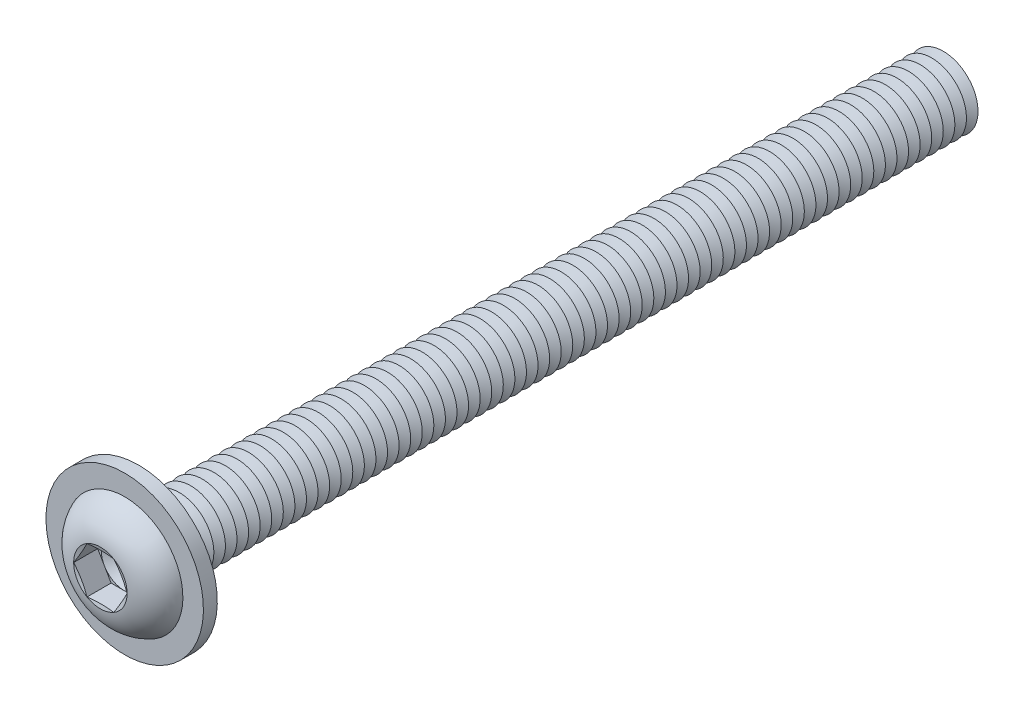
ISO-10303-21;
HEADER;
FILE_DESCRIPTION(('STEP AP214'),'2;1');
FILE_NAME('part.step','',(''),(''),'','','');
FILE_SCHEMA(('AUTOMOTIVE_DESIGN { 1 0 10303 214 1 1 1 1 }'));
ENDSEC;
DATA;
#1=APPLICATION_CONTEXT('core data for automotive mechanical design processes');
#2=APPLICATION_PROTOCOL_DEFINITION('international standard','automotive_design',2000,#1);
#3=PRODUCT_CONTEXT('',#1,'mechanical');
#4=PRODUCT('Part','Part','',(#3));
#5=PRODUCT_RELATED_PRODUCT_CATEGORY('part','',(#4));
#6=PRODUCT_DEFINITION_FORMATION('','',#4);
#7=PRODUCT_DEFINITION_CONTEXT('part definition',#1,'design');
#8=PRODUCT_DEFINITION('design','',#6,#7);
#9=PRODUCT_DEFINITION_SHAPE('','',#8);
#10=(LENGTH_UNIT() NAMED_UNIT(*) SI_UNIT(.MILLI.,.METRE.));
#11=(NAMED_UNIT(*) PLANE_ANGLE_UNIT() SI_UNIT($,.RADIAN.));
#12=(NAMED_UNIT(*) SI_UNIT($,.STERADIAN.) SOLID_ANGLE_UNIT());
#13=UNCERTAINTY_MEASURE_WITH_UNIT(LENGTH_MEASURE(1.E-05),#10,'distance_accuracy_value','');
#14=(GEOMETRIC_REPRESENTATION_CONTEXT(3) GLOBAL_UNCERTAINTY_ASSIGNED_CONTEXT((#13)) GLOBAL_UNIT_ASSIGNED_CONTEXT((#10,
#11,#12)) REPRESENTATION_CONTEXT('',''));
#15=CARTESIAN_POINT('',(0.,0.,0.));
#16=DIRECTION('',(0.,0.,1.));
#17=DIRECTION('',(1.,0.,0.));
#18=AXIS2_PLACEMENT_3D('',#15,#16,#17);
#19=CARTESIAN_POINT('',(0.,0.,-66.5));
#20=DIRECTION('',(0.,0.,1.));
#21=DIRECTION('',(0.,-1.,0.));
#22=AXIS2_PLACEMENT_3D('',#19,#20,#21);
#23=CONICAL_SURFACE('',#22,2.99999999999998,1.0471975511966);
#24=CARTESIAN_POINT('',(0.,0.,-67.));
#25=DIRECTION('',(0.,0.,1.));
#26=DIRECTION('',(0.,-1.,0.));
#27=AXIS2_PLACEMENT_3D('',#24,#25,#26);
#28=CIRCLE('',#27,2.13397459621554);
#29=CARTESIAN_POINT('',(0.,-2.13397459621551,-67.));
#30=VERTEX_POINT('',#29);
#31=EDGE_CURVE('E768',#30,#30,#28,.T.);
#32=ORIENTED_EDGE('',*,*,#31,.T.);
#33=EDGE_LOOP('',(#32));
#34=FACE_BOUND('',#33,.T.);
#35=CARTESIAN_POINT('',(0.,0.,-66.5));
#36=DIRECTION('',(0.,0.,1.));
#37=DIRECTION('',(0.,-1.,0.));
#38=AXIS2_PLACEMENT_3D('',#35,#36,#37);
#39=CIRCLE('',#38,2.99999999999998);
#40=CARTESIAN_POINT('',(0.,-2.99999999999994,-66.5));
#41=VERTEX_POINT('',#40);
#42=EDGE_CURVE('E764',#41,#41,#39,.T.);
#43=ORIENTED_EDGE('',*,*,#42,.F.);
#44=EDGE_LOOP('',(#43));
#45=FACE_BOUND('',#44,.T.);
#46=ADVANCED_FACE('F39',(#34,#45),#23,.T.);
#47=CARTESIAN_POINT('',(0.,0.,-67.));
#48=DIRECTION('',(0.,0.,-1.));
#49=DIRECTION('',(0.,1.,0.));
#50=AXIS2_PLACEMENT_3D('',#47,#48,#49);
#51=CONICAL_SURFACE('',#50,2.13397459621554,1.0471975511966);
#52=CARTESIAN_POINT('',(0.,0.,-67.5));
#53=DIRECTION('',(0.,0.,1.));
#54=DIRECTION('',(0.,-1.,0.));
#55=AXIS2_PLACEMENT_3D('',#52,#53,#54);
#56=CIRCLE('',#55,2.99999999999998);
#57=CARTESIAN_POINT('',(0.,-2.99999999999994,-67.5));
#58=VERTEX_POINT('',#57);
#59=EDGE_CURVE('E772',#58,#58,#56,.T.);
#60=ORIENTED_EDGE('',*,*,#59,.T.);
#61=EDGE_LOOP('',(#60));
#62=FACE_BOUND('',#61,.T.);
#63=ORIENTED_EDGE('',*,*,#31,.F.);
#64=EDGE_LOOP('',(#63));
#65=FACE_BOUND('',#64,.T.);
#66=ADVANCED_FACE('F889',(#62,#65),#51,.T.);
#67=CARTESIAN_POINT('',(0.,2.99999999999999,-70.));
#68=DIRECTION('',(0.,0.,-1.));
#69=DIRECTION('',(0.,1.,0.));
#70=AXIS2_PLACEMENT_3D('',#67,#68,#69);
#71=PLANE('',#70);
#72=CARTESIAN_POINT('',(0.,0.,-70.));
#73=DIRECTION('',(0.,0.,1.));
#74=DIRECTION('',(0.,-1.,0.));
#75=AXIS2_PLACEMENT_3D('',#72,#73,#74);
#76=CIRCLE('',#75,2.13397459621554);
#77=CARTESIAN_POINT('',(0.,-2.1339745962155,-70.));
#78=VERTEX_POINT('',#77);
#79=EDGE_CURVE('E792',#78,#78,#76,.T.);
#80=ORIENTED_EDGE('',*,*,#79,.F.);
#81=EDGE_LOOP('',(#80));
#82=FACE_BOUND('',#81,.T.);
#83=ADVANCED_FACE('F895',(#82),#71,.T.);
#84=CARTESIAN_POINT('',(0.,0.,-69.5));
#85=DIRECTION('',(0.,0.,1.));
#86=DIRECTION('',(0.,-1.,0.));
#87=AXIS2_PLACEMENT_3D('',#84,#85,#86);
#88=CONICAL_SURFACE('',#87,2.99999999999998,1.0471975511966);
#89=ORIENTED_EDGE('',*,*,#79,.T.);
#90=EDGE_LOOP('',(#89));
#91=FACE_BOUND('',#90,.T.);
#92=CARTESIAN_POINT('',(0.,0.,-69.5));
#93=DIRECTION('',(0.,0.,1.));
#94=DIRECTION('',(0.,-1.,0.));
#95=AXIS2_PLACEMENT_3D('',#92,#93,#94);
#96=CIRCLE('',#95,2.99999999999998);
#97=CARTESIAN_POINT('',(0.,-2.99999999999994,-69.5));
#98=VERTEX_POINT('',#97);
#99=EDGE_CURVE('E788',#98,#98,#96,.T.);
#100=ORIENTED_EDGE('',*,*,#99,.F.);
#101=EDGE_LOOP('',(#100));
#102=FACE_BOUND('',#101,.T.);
#103=ADVANCED_FACE('F914',(#91,#102),#88,.T.);
#104=CARTESIAN_POINT('',(0.,0.,-69.));
#105=DIRECTION('',(0.,0.,-1.));
#106=DIRECTION('',(0.,1.,0.));
#107=AXIS2_PLACEMENT_3D('',#104,#105,#106);
#108=CONICAL_SURFACE('',#107,2.13397459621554,1.0471975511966);
#109=ORIENTED_EDGE('',*,*,#99,.T.);
#110=EDGE_LOOP('',(#109));
#111=FACE_BOUND('',#110,.T.);
#112=CARTESIAN_POINT('',(0.,0.,-69.));
#113=DIRECTION('',(0.,0.,1.));
#114=DIRECTION('',(0.,-1.,0.));
#115=AXIS2_PLACEMENT_3D('',#112,#113,#114);
#116=CIRCLE('',#115,2.13397459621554);
#117=CARTESIAN_POINT('',(0.,-2.1339745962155,-69.));
#118=VERTEX_POINT('',#117);
#119=EDGE_CURVE('E784',#118,#118,#116,.T.);
#120=ORIENTED_EDGE('',*,*,#119,.F.);
#121=EDGE_LOOP('',(#120));
#122=FACE_BOUND('',#121,.T.);
#123=ADVANCED_FACE('F911',(#111,#122),#108,.T.);
#124=CARTESIAN_POINT('',(0.,0.,-68.5));
#125=DIRECTION('',(0.,0.,1.));
#126=DIRECTION('',(0.,-1.,0.));
#127=AXIS2_PLACEMENT_3D('',#124,#125,#126);
#128=CONICAL_SURFACE('',#127,2.99999999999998,1.0471975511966);
#129=ORIENTED_EDGE('',*,*,#119,.T.);
#130=EDGE_LOOP('',(#129));
#131=FACE_BOUND('',#130,.T.);
#132=CARTESIAN_POINT('',(0.,0.,-68.5));
#133=DIRECTION('',(0.,0.,1.));
#134=DIRECTION('',(0.,-1.,0.));
#135=AXIS2_PLACEMENT_3D('',#132,#133,#134);
#136=CIRCLE('',#135,2.99999999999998);
#137=CARTESIAN_POINT('',(0.,-2.99999999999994,-68.5));
#138=VERTEX_POINT('',#137);
#139=EDGE_CURVE('E780',#138,#138,#136,.T.);
#140=ORIENTED_EDGE('',*,*,#139,.F.);
#141=EDGE_LOOP('',(#140));
#142=FACE_BOUND('',#141,.T.);
#143=ADVANCED_FACE('F905',(#131,#142),#128,.T.);
#144=CARTESIAN_POINT('',(0.,0.,-68.));
#145=DIRECTION('',(0.,0.,-1.));
#146=DIRECTION('',(0.,1.,0.));
#147=AXIS2_PLACEMENT_3D('',#144,#145,#146);
#148=CONICAL_SURFACE('',#147,2.13397459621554,1.0471975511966);
#149=ORIENTED_EDGE('',*,*,#139,.T.);
#150=EDGE_LOOP('',(#149));
#151=FACE_BOUND('',#150,.T.);
#152=CARTESIAN_POINT('',(0.,0.,-68.));
#153=DIRECTION('',(0.,0.,1.));
#154=DIRECTION('',(0.,-1.,0.));
#155=AXIS2_PLACEMENT_3D('',#152,#153,#154);
#156=CIRCLE('',#155,2.13397459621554);
#157=CARTESIAN_POINT('',(0.,-2.1339745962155,-68.));
#158=VERTEX_POINT('',#157);
#159=EDGE_CURVE('E776',#158,#158,#156,.T.);
#160=ORIENTED_EDGE('',*,*,#159,.F.);
#161=EDGE_LOOP('',(#160));
#162=FACE_BOUND('',#161,.T.);
#163=ADVANCED_FACE('F901',(#151,#162),#148,.T.);
#164=CARTESIAN_POINT('',(0.,0.,-67.5));
#165=DIRECTION('',(0.,0.,1.));
#166=DIRECTION('',(0.,-1.,0.));
#167=AXIS2_PLACEMENT_3D('',#164,#165,#166);
#168=CONICAL_SURFACE('',#167,2.99999999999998,1.0471975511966);
#169=ORIENTED_EDGE('',*,*,#159,.T.);
#170=EDGE_LOOP('',(#169));
#171=FACE_BOUND('',#170,.T.);
#172=ORIENTED_EDGE('',*,*,#59,.F.);
#173=EDGE_LOOP('',(#172));
#174=FACE_BOUND('',#173,.T.);
#175=ADVANCED_FACE('F904',(#171,#174),#168,.T.);
#176=CARTESIAN_POINT('',(0.,0.,-65.5));
#177=DIRECTION('',(0.,0.,1.));
#178=DIRECTION('',(0.,-1.,0.));
#179=AXIS2_PLACEMENT_3D('',#176,#177,#178);
#180=CONICAL_SURFACE('',#179,2.99999999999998,1.0471975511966);
#181=CARTESIAN_POINT('',(0.,0.,-66.));
#182=DIRECTION('',(0.,0.,1.));
#183=DIRECTION('',(0.,-1.,0.));
#184=AXIS2_PLACEMENT_3D('',#181,#182,#183);
#185=CIRCLE('',#184,2.13397459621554);
#186=CARTESIAN_POINT('',(0.,-2.13397459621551,-66.));
#187=VERTEX_POINT('',#186);
#188=EDGE_CURVE('E760',#187,#187,#185,.T.);
#189=ORIENTED_EDGE('',*,*,#188,.T.);
#190=EDGE_LOOP('',(#189));
#191=FACE_BOUND('',#190,.T.);
#192=CARTESIAN_POINT('',(0.,0.,-65.5));
#193=DIRECTION('',(0.,0.,1.));
#194=DIRECTION('',(0.,-1.,0.));
#195=AXIS2_PLACEMENT_3D('',#192,#193,#194);
#196=CIRCLE('',#195,2.99999999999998);
#197=CARTESIAN_POINT('',(0.,-2.99999999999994,-65.5));
#198=VERTEX_POINT('',#197);
#199=EDGE_CURVE('E756',#198,#198,#196,.T.);
#200=ORIENTED_EDGE('',*,*,#199,.F.);
#201=EDGE_LOOP('',(#200));
#202=FACE_BOUND('',#201,.T.);
#203=ADVANCED_FACE('F909',(#191,#202),#180,.T.);
#204=CARTESIAN_POINT('',(0.,0.,-66.));
#205=DIRECTION('',(0.,0.,-1.));
#206=DIRECTION('',(0.,1.,0.));
#207=AXIS2_PLACEMENT_3D('',#204,#205,#206);
#208=CONICAL_SURFACE('',#207,2.13397459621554,1.0471975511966);
#209=ORIENTED_EDGE('',*,*,#42,.T.);
#210=EDGE_LOOP('',(#209));
#211=FACE_BOUND('',#210,.T.);
#212=ORIENTED_EDGE('',*,*,#188,.F.);
#213=EDGE_LOOP('',(#212));
#214=FACE_BOUND('',#213,.T.);
#215=ADVANCED_FACE('F960',(#211,#214),#208,.T.);
#216=CARTESIAN_POINT('',(0.,0.,-64.5));
#217=DIRECTION('',(0.,0.,1.));
#218=DIRECTION('',(0.,-1.,0.));
#219=AXIS2_PLACEMENT_3D('',#216,#217,#218);
#220=CONICAL_SURFACE('',#219,2.99999999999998,1.0471975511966);
#221=CARTESIAN_POINT('',(0.,0.,-65.));
#222=DIRECTION('',(0.,0.,1.));
#223=DIRECTION('',(0.,-1.,0.));
#224=AXIS2_PLACEMENT_3D('',#221,#222,#223);
#225=CIRCLE('',#224,2.13397459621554);
#226=CARTESIAN_POINT('',(0.,-2.13397459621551,-65.));
#227=VERTEX_POINT('',#226);
#228=EDGE_CURVE('E752',#227,#227,#225,.T.);
#229=ORIENTED_EDGE('',*,*,#228,.T.);
#230=EDGE_LOOP('',(#229));
#231=FACE_BOUND('',#230,.T.);
#232=CARTESIAN_POINT('',(0.,0.,-64.5));
#233=DIRECTION('',(0.,0.,1.));
#234=DIRECTION('',(0.,-1.,0.));
#235=AXIS2_PLACEMENT_3D('',#232,#233,#234);
#236=CIRCLE('',#235,2.99999999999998);
#237=CARTESIAN_POINT('',(0.,-2.99999999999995,-64.5));
#238=VERTEX_POINT('',#237);
#239=EDGE_CURVE('E748',#238,#238,#236,.T.);
#240=ORIENTED_EDGE('',*,*,#239,.F.);
#241=EDGE_LOOP('',(#240));
#242=FACE_BOUND('',#241,.T.);
#243=ADVANCED_FACE('F966',(#231,#242),#220,.T.);
#244=CARTESIAN_POINT('',(0.,0.,-65.));
#245=DIRECTION('',(0.,0.,-1.));
#246=DIRECTION('',(0.,1.,0.));
#247=AXIS2_PLACEMENT_3D('',#244,#245,#246);
#248=CONICAL_SURFACE('',#247,2.13397459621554,1.0471975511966);
#249=ORIENTED_EDGE('',*,*,#199,.T.);
#250=EDGE_LOOP('',(#249));
#251=FACE_BOUND('',#250,.T.);
#252=ORIENTED_EDGE('',*,*,#228,.F.);
#253=EDGE_LOOP('',(#252));
#254=FACE_BOUND('',#253,.T.);
#255=ADVANCED_FACE('F973',(#251,#254),#248,.T.);
#256=CARTESIAN_POINT('',(0.,0.,-63.5));
#257=DIRECTION('',(0.,0.,1.));
#258=DIRECTION('',(0.,-1.,0.));
#259=AXIS2_PLACEMENT_3D('',#256,#257,#258);
#260=CONICAL_SURFACE('',#259,2.99999999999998,1.0471975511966);
#261=CARTESIAN_POINT('',(0.,0.,-64.));
#262=DIRECTION('',(0.,0.,1.));
#263=DIRECTION('',(0.,-1.,0.));
#264=AXIS2_PLACEMENT_3D('',#261,#262,#263);
#265=CIRCLE('',#264,2.13397459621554);
#266=CARTESIAN_POINT('',(0.,-2.13397459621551,-64.));
#267=VERTEX_POINT('',#266);
#268=EDGE_CURVE('E744',#267,#267,#265,.T.);
#269=ORIENTED_EDGE('',*,*,#268,.T.);
#270=EDGE_LOOP('',(#269));
#271=FACE_BOUND('',#270,.T.);
#272=CARTESIAN_POINT('',(0.,0.,-63.5));
#273=DIRECTION('',(0.,0.,1.));
#274=DIRECTION('',(0.,-1.,0.));
#275=AXIS2_PLACEMENT_3D('',#272,#273,#274);
#276=CIRCLE('',#275,2.99999999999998);
#277=CARTESIAN_POINT('',(0.,-2.99999999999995,-63.5));
#278=VERTEX_POINT('',#277);
#279=EDGE_CURVE('E741',#278,#278,#276,.T.);
#280=ORIENTED_EDGE('',*,*,#279,.F.);
#281=EDGE_LOOP('',(#280));
#282=FACE_BOUND('',#281,.T.);
#283=ADVANCED_FACE('F980',(#271,#282),#260,.T.);
#284=CARTESIAN_POINT('',(0.,0.,-64.));
#285=DIRECTION('',(0.,0.,-1.));
#286=DIRECTION('',(0.,1.,0.));
#287=AXIS2_PLACEMENT_3D('',#284,#285,#286);
#288=CONICAL_SURFACE('',#287,2.13397459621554,1.0471975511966);
#289=ORIENTED_EDGE('',*,*,#239,.T.);
#290=EDGE_LOOP('',(#289));
#291=FACE_BOUND('',#290,.T.);
#292=ORIENTED_EDGE('',*,*,#268,.F.);
#293=EDGE_LOOP('',(#292));
#294=FACE_BOUND('',#293,.T.);
#295=ADVANCED_FACE('F987',(#291,#294),#288,.T.);
#296=CARTESIAN_POINT('',(0.,0.,-62.5));
#297=DIRECTION('',(0.,0.,1.));
#298=DIRECTION('',(0.,-1.,0.));
#299=AXIS2_PLACEMENT_3D('',#296,#297,#298);
#300=CONICAL_SURFACE('',#299,2.99999999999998,1.0471975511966);
#301=CARTESIAN_POINT('',(0.,0.,-63.));
#302=DIRECTION('',(0.,0.,1.));
#303=DIRECTION('',(0.,-1.,0.));
#304=AXIS2_PLACEMENT_3D('',#301,#302,#303);
#305=CIRCLE('',#304,2.13397459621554);
#306=CARTESIAN_POINT('',(0.,-2.13397459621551,-63.));
#307=VERTEX_POINT('',#306);
#308=EDGE_CURVE('E737',#307,#307,#305,.T.);
#309=ORIENTED_EDGE('',*,*,#308,.T.);
#310=EDGE_LOOP('',(#309));
#311=FACE_BOUND('',#310,.T.);
#312=CARTESIAN_POINT('',(0.,0.,-62.5));
#313=DIRECTION('',(0.,0.,1.));
#314=DIRECTION('',(0.,-1.,0.));
#315=AXIS2_PLACEMENT_3D('',#312,#313,#314);
#316=CIRCLE('',#315,2.99999999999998);
#317=CARTESIAN_POINT('',(0.,-2.99999999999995,-62.5));
#318=VERTEX_POINT('',#317);
#319=EDGE_CURVE('E733',#318,#318,#316,.T.);
#320=ORIENTED_EDGE('',*,*,#319,.F.);
#321=EDGE_LOOP('',(#320));
#322=FACE_BOUND('',#321,.T.);
#323=ADVANCED_FACE('F994',(#311,#322),#300,.T.);
#324=CARTESIAN_POINT('',(0.,0.,-63.));
#325=DIRECTION('',(0.,0.,-1.));
#326=DIRECTION('',(0.,1.,0.));
#327=AXIS2_PLACEMENT_3D('',#324,#325,#326);
#328=CONICAL_SURFACE('',#327,2.13397459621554,1.0471975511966);
#329=ORIENTED_EDGE('',*,*,#279,.T.);
#330=EDGE_LOOP('',(#329));
#331=FACE_BOUND('',#330,.T.);
#332=ORIENTED_EDGE('',*,*,#308,.F.);
#333=EDGE_LOOP('',(#332));
#334=FACE_BOUND('',#333,.T.);
#335=ADVANCED_FACE('F1001',(#331,#334),#328,.T.);
#336=CARTESIAN_POINT('',(0.,0.,-61.5));
#337=DIRECTION('',(0.,0.,1.));
#338=DIRECTION('',(0.,-1.,0.));
#339=AXIS2_PLACEMENT_3D('',#336,#337,#338);
#340=CONICAL_SURFACE('',#339,2.99999999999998,1.0471975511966);
#341=CARTESIAN_POINT('',(0.,0.,-62.));
#342=DIRECTION('',(0.,0.,1.));
#343=DIRECTION('',(0.,-1.,0.));
#344=AXIS2_PLACEMENT_3D('',#341,#342,#343);
#345=CIRCLE('',#344,2.13397459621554);
#346=CARTESIAN_POINT('',(0.,-2.13397459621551,-62.));
#347=VERTEX_POINT('',#346);
#348=EDGE_CURVE('E729',#347,#347,#345,.T.);
#349=ORIENTED_EDGE('',*,*,#348,.T.);
#350=EDGE_LOOP('',(#349));
#351=FACE_BOUND('',#350,.T.);
#352=CARTESIAN_POINT('',(0.,0.,-61.5));
#353=DIRECTION('',(0.,0.,1.));
#354=DIRECTION('',(0.,-1.,0.));
#355=AXIS2_PLACEMENT_3D('',#352,#353,#354);
#356=CIRCLE('',#355,2.99999999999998);
#357=CARTESIAN_POINT('',(0.,-2.99999999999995,-61.5));
#358=VERTEX_POINT('',#357);
#359=EDGE_CURVE('E725',#358,#358,#356,.T.);
#360=ORIENTED_EDGE('',*,*,#359,.F.);
#361=EDGE_LOOP('',(#360));
#362=FACE_BOUND('',#361,.T.);
#363=ADVANCED_FACE('F1008',(#351,#362),#340,.T.);
#364=CARTESIAN_POINT('',(0.,0.,-62.));
#365=DIRECTION('',(0.,0.,-1.));
#366=DIRECTION('',(0.,1.,0.));
#367=AXIS2_PLACEMENT_3D('',#364,#365,#366);
#368=CONICAL_SURFACE('',#367,2.13397459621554,1.0471975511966);
#369=ORIENTED_EDGE('',*,*,#319,.T.);
#370=EDGE_LOOP('',(#369));
#371=FACE_BOUND('',#370,.T.);
#372=ORIENTED_EDGE('',*,*,#348,.F.);
#373=EDGE_LOOP('',(#372));
#374=FACE_BOUND('',#373,.T.);
#375=ADVANCED_FACE('F1015',(#371,#374),#368,.T.);
#376=CARTESIAN_POINT('',(0.,0.,-60.5));
#377=DIRECTION('',(0.,0.,1.));
#378=DIRECTION('',(0.,-1.,0.));
#379=AXIS2_PLACEMENT_3D('',#376,#377,#378);
#380=CONICAL_SURFACE('',#379,2.99999999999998,1.0471975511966);
#381=CARTESIAN_POINT('',(0.,0.,-61.));
#382=DIRECTION('',(0.,0.,1.));
#383=DIRECTION('',(0.,-1.,0.));
#384=AXIS2_PLACEMENT_3D('',#381,#382,#383);
#385=CIRCLE('',#384,2.13397459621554);
#386=CARTESIAN_POINT('',(0.,-2.13397459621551,-61.));
#387=VERTEX_POINT('',#386);
#388=EDGE_CURVE('E721',#387,#387,#385,.T.);
#389=ORIENTED_EDGE('',*,*,#388,.T.);
#390=EDGE_LOOP('',(#389));
#391=FACE_BOUND('',#390,.T.);
#392=CARTESIAN_POINT('',(0.,0.,-60.5));
#393=DIRECTION('',(0.,0.,1.));
#394=DIRECTION('',(0.,-1.,0.));
#395=AXIS2_PLACEMENT_3D('',#392,#393,#394);
#396=CIRCLE('',#395,2.99999999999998);
#397=CARTESIAN_POINT('',(0.,-2.99999999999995,-60.5));
#398=VERTEX_POINT('',#397);
#399=EDGE_CURVE('E717',#398,#398,#396,.T.);
#400=ORIENTED_EDGE('',*,*,#399,.F.);
#401=EDGE_LOOP('',(#400));
#402=FACE_BOUND('',#401,.T.);
#403=ADVANCED_FACE('F1022',(#391,#402),#380,.T.);
#404=CARTESIAN_POINT('',(0.,0.,-61.));
#405=DIRECTION('',(0.,0.,-1.));
#406=DIRECTION('',(0.,1.,0.));
#407=AXIS2_PLACEMENT_3D('',#404,#405,#406);
#408=CONICAL_SURFACE('',#407,2.13397459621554,1.0471975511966);
#409=ORIENTED_EDGE('',*,*,#359,.T.);
#410=EDGE_LOOP('',(#409));
#411=FACE_BOUND('',#410,.T.);
#412=ORIENTED_EDGE('',*,*,#388,.F.);
#413=EDGE_LOOP('',(#412));
#414=FACE_BOUND('',#413,.T.);
#415=ADVANCED_FACE('F1029',(#411,#414),#408,.T.);
#416=CARTESIAN_POINT('',(0.,0.,-59.5));
#417=DIRECTION('',(0.,0.,1.));
#418=DIRECTION('',(0.,-1.,0.));
#419=AXIS2_PLACEMENT_3D('',#416,#417,#418);
#420=CONICAL_SURFACE('',#419,2.99999999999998,1.0471975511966);
#421=CARTESIAN_POINT('',(0.,0.,-60.));
#422=DIRECTION('',(0.,0.,1.));
#423=DIRECTION('',(0.,-1.,0.));
#424=AXIS2_PLACEMENT_3D('',#421,#422,#423);
#425=CIRCLE('',#424,2.13397459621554);
#426=CARTESIAN_POINT('',(0.,-2.13397459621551,-60.));
#427=VERTEX_POINT('',#426);
#428=EDGE_CURVE('E713',#427,#427,#425,.T.);
#429=ORIENTED_EDGE('',*,*,#428,.T.);
#430=EDGE_LOOP('',(#429));
#431=FACE_BOUND('',#430,.T.);
#432=CARTESIAN_POINT('',(0.,0.,-59.5));
#433=DIRECTION('',(0.,0.,1.));
#434=DIRECTION('',(0.,-1.,0.));
#435=AXIS2_PLACEMENT_3D('',#432,#433,#434);
#436=CIRCLE('',#435,2.99999999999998);
#437=CARTESIAN_POINT('',(0.,-2.99999999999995,-59.5));
#438=VERTEX_POINT('',#437);
#439=EDGE_CURVE('E709',#438,#438,#436,.T.);
#440=ORIENTED_EDGE('',*,*,#439,.F.);
#441=EDGE_LOOP('',(#440));
#442=FACE_BOUND('',#441,.T.);
#443=ADVANCED_FACE('F1036',(#431,#442),#420,.T.);
#444=CARTESIAN_POINT('',(0.,0.,-60.));
#445=DIRECTION('',(0.,0.,-1.));
#446=DIRECTION('',(0.,1.,0.));
#447=AXIS2_PLACEMENT_3D('',#444,#445,#446);
#448=CONICAL_SURFACE('',#447,2.13397459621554,1.0471975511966);
#449=ORIENTED_EDGE('',*,*,#399,.T.);
#450=EDGE_LOOP('',(#449));
#451=FACE_BOUND('',#450,.T.);
#452=ORIENTED_EDGE('',*,*,#428,.F.);
#453=EDGE_LOOP('',(#452));
#454=FACE_BOUND('',#453,.T.);
#455=ADVANCED_FACE('F1043',(#451,#454),#448,.T.);
#456=CARTESIAN_POINT('',(0.,0.,-58.5));
#457=DIRECTION('',(0.,0.,1.));
#458=DIRECTION('',(0.,-1.,0.));
#459=AXIS2_PLACEMENT_3D('',#456,#457,#458);
#460=CONICAL_SURFACE('',#459,2.99999999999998,1.0471975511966);
#461=CARTESIAN_POINT('',(0.,0.,-59.));
#462=DIRECTION('',(0.,0.,1.));
#463=DIRECTION('',(0.,-1.,0.));
#464=AXIS2_PLACEMENT_3D('',#461,#462,#463);
#465=CIRCLE('',#464,2.13397459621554);
#466=CARTESIAN_POINT('',(0.,-2.13397459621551,-59.));
#467=VERTEX_POINT('',#466);
#468=EDGE_CURVE('E705',#467,#467,#465,.T.);
#469=ORIENTED_EDGE('',*,*,#468,.T.);
#470=EDGE_LOOP('',(#469));
#471=FACE_BOUND('',#470,.T.);
#472=CARTESIAN_POINT('',(0.,0.,-58.5));
#473=DIRECTION('',(0.,0.,1.));
#474=DIRECTION('',(0.,-1.,0.));
#475=AXIS2_PLACEMENT_3D('',#472,#473,#474);
#476=CIRCLE('',#475,2.99999999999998);
#477=CARTESIAN_POINT('',(0.,-2.99999999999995,-58.5));
#478=VERTEX_POINT('',#477);
#479=EDGE_CURVE('E701',#478,#478,#476,.T.);
#480=ORIENTED_EDGE('',*,*,#479,.F.);
#481=EDGE_LOOP('',(#480));
#482=FACE_BOUND('',#481,.T.);
#483=ADVANCED_FACE('F1050',(#471,#482),#460,.T.);
#484=CARTESIAN_POINT('',(0.,0.,-59.));
#485=DIRECTION('',(0.,0.,-1.));
#486=DIRECTION('',(0.,1.,0.));
#487=AXIS2_PLACEMENT_3D('',#484,#485,#486);
#488=CONICAL_SURFACE('',#487,2.13397459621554,1.0471975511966);
#489=ORIENTED_EDGE('',*,*,#439,.T.);
#490=EDGE_LOOP('',(#489));
#491=FACE_BOUND('',#490,.T.);
#492=ORIENTED_EDGE('',*,*,#468,.F.);
#493=EDGE_LOOP('',(#492));
#494=FACE_BOUND('',#493,.T.);
#495=ADVANCED_FACE('F1057',(#491,#494),#488,.T.);
#496=CARTESIAN_POINT('',(0.,0.,-57.5));
#497=DIRECTION('',(0.,0.,1.));
#498=DIRECTION('',(0.,-1.,0.));
#499=AXIS2_PLACEMENT_3D('',#496,#497,#498);
#500=CONICAL_SURFACE('',#499,2.99999999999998,1.0471975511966);
#501=CARTESIAN_POINT('',(0.,0.,-58.));
#502=DIRECTION('',(0.,0.,1.));
#503=DIRECTION('',(0.,-1.,0.));
#504=AXIS2_PLACEMENT_3D('',#501,#502,#503);
#505=CIRCLE('',#504,2.13397459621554);
#506=CARTESIAN_POINT('',(0.,-2.13397459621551,-58.));
#507=VERTEX_POINT('',#506);
#508=EDGE_CURVE('E697',#507,#507,#505,.T.);
#509=ORIENTED_EDGE('',*,*,#508,.T.);
#510=EDGE_LOOP('',(#509));
#511=FACE_BOUND('',#510,.T.);
#512=CARTESIAN_POINT('',(0.,0.,-57.5));
#513=DIRECTION('',(0.,0.,1.));
#514=DIRECTION('',(0.,-1.,0.));
#515=AXIS2_PLACEMENT_3D('',#512,#513,#514);
#516=CIRCLE('',#515,2.99999999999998);
#517=CARTESIAN_POINT('',(0.,-2.99999999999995,-57.5));
#518=VERTEX_POINT('',#517);
#519=EDGE_CURVE('E693',#518,#518,#516,.T.);
#520=ORIENTED_EDGE('',*,*,#519,.F.);
#521=EDGE_LOOP('',(#520));
#522=FACE_BOUND('',#521,.T.);
#523=ADVANCED_FACE('F1064',(#511,#522),#500,.T.);
#524=CARTESIAN_POINT('',(0.,0.,-58.));
#525=DIRECTION('',(0.,0.,-1.));
#526=DIRECTION('',(0.,1.,0.));
#527=AXIS2_PLACEMENT_3D('',#524,#525,#526);
#528=CONICAL_SURFACE('',#527,2.13397459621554,1.0471975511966);
#529=ORIENTED_EDGE('',*,*,#479,.T.);
#530=EDGE_LOOP('',(#529));
#531=FACE_BOUND('',#530,.T.);
#532=ORIENTED_EDGE('',*,*,#508,.F.);
#533=EDGE_LOOP('',(#532));
#534=FACE_BOUND('',#533,.T.);
#535=ADVANCED_FACE('F1071',(#531,#534),#528,.T.);
#536=CARTESIAN_POINT('',(0.,0.,-56.5));
#537=DIRECTION('',(0.,0.,1.));
#538=DIRECTION('',(0.,-1.,0.));
#539=AXIS2_PLACEMENT_3D('',#536,#537,#538);
#540=CONICAL_SURFACE('',#539,2.99999999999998,1.0471975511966);
#541=CARTESIAN_POINT('',(0.,0.,-57.));
#542=DIRECTION('',(0.,0.,1.));
#543=DIRECTION('',(0.,-1.,0.));
#544=AXIS2_PLACEMENT_3D('',#541,#542,#543);
#545=CIRCLE('',#544,2.13397459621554);
#546=CARTESIAN_POINT('',(0.,-2.13397459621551,-57.));
#547=VERTEX_POINT('',#546);
#548=EDGE_CURVE('E689',#547,#547,#545,.T.);
#549=ORIENTED_EDGE('',*,*,#548,.T.);
#550=EDGE_LOOP('',(#549));
#551=FACE_BOUND('',#550,.T.);
#552=CARTESIAN_POINT('',(0.,0.,-56.5));
#553=DIRECTION('',(0.,0.,1.));
#554=DIRECTION('',(0.,-1.,0.));
#555=AXIS2_PLACEMENT_3D('',#552,#553,#554);
#556=CIRCLE('',#555,2.99999999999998);
#557=CARTESIAN_POINT('',(0.,-2.99999999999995,-56.5));
#558=VERTEX_POINT('',#557);
#559=EDGE_CURVE('E685',#558,#558,#556,.T.);
#560=ORIENTED_EDGE('',*,*,#559,.F.);
#561=EDGE_LOOP('',(#560));
#562=FACE_BOUND('',#561,.T.);
#563=ADVANCED_FACE('F1078',(#551,#562),#540,.T.);
#564=CARTESIAN_POINT('',(0.,0.,-57.));
#565=DIRECTION('',(0.,0.,-1.));
#566=DIRECTION('',(0.,1.,0.));
#567=AXIS2_PLACEMENT_3D('',#564,#565,#566);
#568=CONICAL_SURFACE('',#567,2.13397459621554,1.0471975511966);
#569=ORIENTED_EDGE('',*,*,#519,.T.);
#570=EDGE_LOOP('',(#569));
#571=FACE_BOUND('',#570,.T.);
#572=ORIENTED_EDGE('',*,*,#548,.F.);
#573=EDGE_LOOP('',(#572));
#574=FACE_BOUND('',#573,.T.);
#575=ADVANCED_FACE('F1085',(#571,#574),#568,.T.);
#576=CARTESIAN_POINT('',(0.,0.,-55.5));
#577=DIRECTION('',(0.,0.,1.));
#578=DIRECTION('',(0.,-1.,0.));
#579=AXIS2_PLACEMENT_3D('',#576,#577,#578);
#580=CONICAL_SURFACE('',#579,2.99999999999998,1.0471975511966);
#581=CARTESIAN_POINT('',(0.,0.,-56.));
#582=DIRECTION('',(0.,0.,1.));
#583=DIRECTION('',(0.,-1.,0.));
#584=AXIS2_PLACEMENT_3D('',#581,#582,#583);
#585=CIRCLE('',#584,2.13397459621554);
#586=CARTESIAN_POINT('',(0.,-2.13397459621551,-56.));
#587=VERTEX_POINT('',#586);
#588=EDGE_CURVE('E681',#587,#587,#585,.T.);
#589=ORIENTED_EDGE('',*,*,#588,.T.);
#590=EDGE_LOOP('',(#589));
#591=FACE_BOUND('',#590,.T.);
#592=CARTESIAN_POINT('',(0.,0.,-55.5));
#593=DIRECTION('',(0.,0.,1.));
#594=DIRECTION('',(0.,-1.,0.));
#595=AXIS2_PLACEMENT_3D('',#592,#593,#594);
#596=CIRCLE('',#595,2.99999999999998);
#597=CARTESIAN_POINT('',(0.,-2.99999999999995,-55.5));
#598=VERTEX_POINT('',#597);
#599=EDGE_CURVE('E677',#598,#598,#596,.T.);
#600=ORIENTED_EDGE('',*,*,#599,.F.);
#601=EDGE_LOOP('',(#600));
#602=FACE_BOUND('',#601,.T.);
#603=ADVANCED_FACE('F1092',(#591,#602),#580,.T.);
#604=CARTESIAN_POINT('',(0.,0.,-56.));
#605=DIRECTION('',(0.,0.,-1.));
#606=DIRECTION('',(0.,1.,0.));
#607=AXIS2_PLACEMENT_3D('',#604,#605,#606);
#608=CONICAL_SURFACE('',#607,2.13397459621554,1.0471975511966);
#609=ORIENTED_EDGE('',*,*,#559,.T.);
#610=EDGE_LOOP('',(#609));
#611=FACE_BOUND('',#610,.T.);
#612=ORIENTED_EDGE('',*,*,#588,.F.);
#613=EDGE_LOOP('',(#612));
#614=FACE_BOUND('',#613,.T.);
#615=ADVANCED_FACE('F1099',(#611,#614),#608,.T.);
#616=CARTESIAN_POINT('',(0.,0.,-54.5));
#617=DIRECTION('',(0.,0.,1.));
#618=DIRECTION('',(0.,-1.,0.));
#619=AXIS2_PLACEMENT_3D('',#616,#617,#618);
#620=CONICAL_SURFACE('',#619,2.99999999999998,1.0471975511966);
#621=CARTESIAN_POINT('',(0.,0.,-55.));
#622=DIRECTION('',(0.,0.,1.));
#623=DIRECTION('',(0.,-1.,0.));
#624=AXIS2_PLACEMENT_3D('',#621,#622,#623);
#625=CIRCLE('',#624,2.13397459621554);
#626=CARTESIAN_POINT('',(0.,-2.13397459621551,-55.));
#627=VERTEX_POINT('',#626);
#628=EDGE_CURVE('E673',#627,#627,#625,.T.);
#629=ORIENTED_EDGE('',*,*,#628,.T.);
#630=EDGE_LOOP('',(#629));
#631=FACE_BOUND('',#630,.T.);
#632=CARTESIAN_POINT('',(0.,0.,-54.5));
#633=DIRECTION('',(0.,0.,1.));
#634=DIRECTION('',(0.,-1.,0.));
#635=AXIS2_PLACEMENT_3D('',#632,#633,#634);
#636=CIRCLE('',#635,2.99999999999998);
#637=CARTESIAN_POINT('',(0.,-2.99999999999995,-54.5));
#638=VERTEX_POINT('',#637);
#639=EDGE_CURVE('E669',#638,#638,#636,.T.);
#640=ORIENTED_EDGE('',*,*,#639,.F.);
#641=EDGE_LOOP('',(#640));
#642=FACE_BOUND('',#641,.T.);
#643=ADVANCED_FACE('F1106',(#631,#642),#620,.T.);
#644=CARTESIAN_POINT('',(0.,0.,-55.));
#645=DIRECTION('',(0.,0.,-1.));
#646=DIRECTION('',(0.,1.,0.));
#647=AXIS2_PLACEMENT_3D('',#644,#645,#646);
#648=CONICAL_SURFACE('',#647,2.13397459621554,1.0471975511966);
#649=ORIENTED_EDGE('',*,*,#599,.T.);
#650=EDGE_LOOP('',(#649));
#651=FACE_BOUND('',#650,.T.);
#652=ORIENTED_EDGE('',*,*,#628,.F.);
#653=EDGE_LOOP('',(#652));
#654=FACE_BOUND('',#653,.T.);
#655=ADVANCED_FACE('F1113',(#651,#654),#648,.T.);
#656=CARTESIAN_POINT('',(0.,0.,-53.5));
#657=DIRECTION('',(0.,0.,1.));
#658=DIRECTION('',(0.,-1.,0.));
#659=AXIS2_PLACEMENT_3D('',#656,#657,#658);
#660=CONICAL_SURFACE('',#659,2.99999999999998,1.0471975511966);
#661=CARTESIAN_POINT('',(0.,0.,-54.));
#662=DIRECTION('',(0.,0.,1.));
#663=DIRECTION('',(0.,-1.,0.));
#664=AXIS2_PLACEMENT_3D('',#661,#662,#663);
#665=CIRCLE('',#664,2.13397459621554);
#666=CARTESIAN_POINT('',(0.,-2.13397459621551,-54.));
#667=VERTEX_POINT('',#666);
#668=EDGE_CURVE('E665',#667,#667,#665,.T.);
#669=ORIENTED_EDGE('',*,*,#668,.T.);
#670=EDGE_LOOP('',(#669));
#671=FACE_BOUND('',#670,.T.);
#672=CARTESIAN_POINT('',(0.,0.,-53.5));
#673=DIRECTION('',(0.,0.,1.));
#674=DIRECTION('',(0.,-1.,0.));
#675=AXIS2_PLACEMENT_3D('',#672,#673,#674);
#676=CIRCLE('',#675,2.99999999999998);
#677=CARTESIAN_POINT('',(0.,-2.99999999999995,-53.5));
#678=VERTEX_POINT('',#677);
#679=EDGE_CURVE('E661',#678,#678,#676,.T.);
#680=ORIENTED_EDGE('',*,*,#679,.F.);
#681=EDGE_LOOP('',(#680));
#682=FACE_BOUND('',#681,.T.);
#683=ADVANCED_FACE('F1120',(#671,#682),#660,.T.);
#684=CARTESIAN_POINT('',(0.,0.,-54.));
#685=DIRECTION('',(0.,0.,-1.));
#686=DIRECTION('',(0.,1.,0.));
#687=AXIS2_PLACEMENT_3D('',#684,#685,#686);
#688=CONICAL_SURFACE('',#687,2.13397459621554,1.0471975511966);
#689=ORIENTED_EDGE('',*,*,#639,.T.);
#690=EDGE_LOOP('',(#689));
#691=FACE_BOUND('',#690,.T.);
#692=ORIENTED_EDGE('',*,*,#668,.F.);
#693=EDGE_LOOP('',(#692));
#694=FACE_BOUND('',#693,.T.);
#695=ADVANCED_FACE('F1127',(#691,#694),#688,.T.);
#696=CARTESIAN_POINT('',(0.,0.,-52.5));
#697=DIRECTION('',(0.,0.,1.));
#698=DIRECTION('',(0.,-1.,0.));
#699=AXIS2_PLACEMENT_3D('',#696,#697,#698);
#700=CONICAL_SURFACE('',#699,2.99999999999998,1.0471975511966);
#701=CARTESIAN_POINT('',(0.,0.,-53.));
#702=DIRECTION('',(0.,0.,1.));
#703=DIRECTION('',(0.,-1.,0.));
#704=AXIS2_PLACEMENT_3D('',#701,#702,#703);
#705=CIRCLE('',#704,2.13397459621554);
#706=CARTESIAN_POINT('',(0.,-2.13397459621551,-53.));
#707=VERTEX_POINT('',#706);
#708=EDGE_CURVE('E657',#707,#707,#705,.T.);
#709=ORIENTED_EDGE('',*,*,#708,.T.);
#710=EDGE_LOOP('',(#709));
#711=FACE_BOUND('',#710,.T.);
#712=CARTESIAN_POINT('',(0.,0.,-52.5));
#713=DIRECTION('',(0.,0.,1.));
#714=DIRECTION('',(0.,-1.,0.));
#715=AXIS2_PLACEMENT_3D('',#712,#713,#714);
#716=CIRCLE('',#715,2.99999999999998);
#717=CARTESIAN_POINT('',(0.,-2.99999999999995,-52.5));
#718=VERTEX_POINT('',#717);
#719=EDGE_CURVE('E653',#718,#718,#716,.T.);
#720=ORIENTED_EDGE('',*,*,#719,.F.);
#721=EDGE_LOOP('',(#720));
#722=FACE_BOUND('',#721,.T.);
#723=ADVANCED_FACE('F1134',(#711,#722),#700,.T.);
#724=CARTESIAN_POINT('',(0.,0.,-53.));
#725=DIRECTION('',(0.,0.,-1.));
#726=DIRECTION('',(0.,1.,0.));
#727=AXIS2_PLACEMENT_3D('',#724,#725,#726);
#728=CONICAL_SURFACE('',#727,2.13397459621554,1.0471975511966);
#729=ORIENTED_EDGE('',*,*,#679,.T.);
#730=EDGE_LOOP('',(#729));
#731=FACE_BOUND('',#730,.T.);
#732=ORIENTED_EDGE('',*,*,#708,.F.);
#733=EDGE_LOOP('',(#732));
#734=FACE_BOUND('',#733,.T.);
#735=ADVANCED_FACE('F1141',(#731,#734),#728,.T.);
#736=CARTESIAN_POINT('',(0.,0.,-51.5));
#737=DIRECTION('',(0.,0.,1.));
#738=DIRECTION('',(0.,-1.,0.));
#739=AXIS2_PLACEMENT_3D('',#736,#737,#738);
#740=CONICAL_SURFACE('',#739,2.99999999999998,1.0471975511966);
#741=CARTESIAN_POINT('',(0.,0.,-52.));
#742=DIRECTION('',(0.,0.,1.));
#743=DIRECTION('',(0.,-1.,0.));
#744=AXIS2_PLACEMENT_3D('',#741,#742,#743);
#745=CIRCLE('',#744,2.13397459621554);
#746=CARTESIAN_POINT('',(0.,-2.13397459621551,-52.));
#747=VERTEX_POINT('',#746);
#748=EDGE_CURVE('E649',#747,#747,#745,.T.);
#749=ORIENTED_EDGE('',*,*,#748,.T.);
#750=EDGE_LOOP('',(#749));
#751=FACE_BOUND('',#750,.T.);
#752=CARTESIAN_POINT('',(0.,0.,-51.5));
#753=DIRECTION('',(0.,0.,1.));
#754=DIRECTION('',(0.,-1.,0.));
#755=AXIS2_PLACEMENT_3D('',#752,#753,#754);
#756=CIRCLE('',#755,2.99999999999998);
#757=CARTESIAN_POINT('',(0.,-2.99999999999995,-51.5));
#758=VERTEX_POINT('',#757);
#759=EDGE_CURVE('E645',#758,#758,#756,.T.);
#760=ORIENTED_EDGE('',*,*,#759,.F.);
#761=EDGE_LOOP('',(#760));
#762=FACE_BOUND('',#761,.T.);
#763=ADVANCED_FACE('F1148',(#751,#762),#740,.T.);
#764=CARTESIAN_POINT('',(0.,0.,-52.));
#765=DIRECTION('',(0.,0.,-1.));
#766=DIRECTION('',(0.,1.,0.));
#767=AXIS2_PLACEMENT_3D('',#764,#765,#766);
#768=CONICAL_SURFACE('',#767,2.13397459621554,1.0471975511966);
#769=ORIENTED_EDGE('',*,*,#719,.T.);
#770=EDGE_LOOP('',(#769));
#771=FACE_BOUND('',#770,.T.);
#772=ORIENTED_EDGE('',*,*,#748,.F.);
#773=EDGE_LOOP('',(#772));
#774=FACE_BOUND('',#773,.T.);
#775=ADVANCED_FACE('F1155',(#771,#774),#768,.T.);
#776=CARTESIAN_POINT('',(0.,0.,-50.5));
#777=DIRECTION('',(0.,0.,1.));
#778=DIRECTION('',(0.,-1.,0.));
#779=AXIS2_PLACEMENT_3D('',#776,#777,#778);
#780=CONICAL_SURFACE('',#779,2.99999999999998,1.0471975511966);
#781=CARTESIAN_POINT('',(0.,0.,-51.));
#782=DIRECTION('',(0.,0.,1.));
#783=DIRECTION('',(0.,-1.,0.));
#784=AXIS2_PLACEMENT_3D('',#781,#782,#783);
#785=CIRCLE('',#784,2.13397459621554);
#786=CARTESIAN_POINT('',(0.,-2.13397459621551,-51.));
#787=VERTEX_POINT('',#786);
#788=EDGE_CURVE('E641',#787,#787,#785,.T.);
#789=ORIENTED_EDGE('',*,*,#788,.T.);
#790=EDGE_LOOP('',(#789));
#791=FACE_BOUND('',#790,.T.);
#792=CARTESIAN_POINT('',(0.,0.,-50.5));
#793=DIRECTION('',(0.,0.,1.));
#794=DIRECTION('',(0.,-1.,0.));
#795=AXIS2_PLACEMENT_3D('',#792,#793,#794);
#796=CIRCLE('',#795,2.99999999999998);
#797=CARTESIAN_POINT('',(0.,-2.99999999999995,-50.5));
#798=VERTEX_POINT('',#797);
#799=EDGE_CURVE('E637',#798,#798,#796,.T.);
#800=ORIENTED_EDGE('',*,*,#799,.F.);
#801=EDGE_LOOP('',(#800));
#802=FACE_BOUND('',#801,.T.);
#803=ADVANCED_FACE('F1162',(#791,#802),#780,.T.);
#804=CARTESIAN_POINT('',(0.,0.,-51.));
#805=DIRECTION('',(0.,0.,-1.));
#806=DIRECTION('',(0.,1.,0.));
#807=AXIS2_PLACEMENT_3D('',#804,#805,#806);
#808=CONICAL_SURFACE('',#807,2.13397459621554,1.0471975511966);
#809=ORIENTED_EDGE('',*,*,#759,.T.);
#810=EDGE_LOOP('',(#809));
#811=FACE_BOUND('',#810,.T.);
#812=ORIENTED_EDGE('',*,*,#788,.F.);
#813=EDGE_LOOP('',(#812));
#814=FACE_BOUND('',#813,.T.);
#815=ADVANCED_FACE('F1169',(#811,#814),#808,.T.);
#816=CARTESIAN_POINT('',(0.,0.,-49.5));
#817=DIRECTION('',(0.,0.,1.));
#818=DIRECTION('',(0.,-1.,0.));
#819=AXIS2_PLACEMENT_3D('',#816,#817,#818);
#820=CONICAL_SURFACE('',#819,2.99999999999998,1.0471975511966);
#821=CARTESIAN_POINT('',(0.,0.,-50.));
#822=DIRECTION('',(0.,0.,1.));
#823=DIRECTION('',(0.,-1.,0.));
#824=AXIS2_PLACEMENT_3D('',#821,#822,#823);
#825=CIRCLE('',#824,2.13397459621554);
#826=CARTESIAN_POINT('',(0.,-2.13397459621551,-50.));
#827=VERTEX_POINT('',#826);
#828=EDGE_CURVE('E633',#827,#827,#825,.T.);
#829=ORIENTED_EDGE('',*,*,#828,.T.);
#830=EDGE_LOOP('',(#829));
#831=FACE_BOUND('',#830,.T.);
#832=CARTESIAN_POINT('',(0.,0.,-49.5));
#833=DIRECTION('',(0.,0.,1.));
#834=DIRECTION('',(0.,-1.,0.));
#835=AXIS2_PLACEMENT_3D('',#832,#833,#834);
#836=CIRCLE('',#835,2.99999999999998);
#837=CARTESIAN_POINT('',(0.,-2.99999999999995,-49.5));
#838=VERTEX_POINT('',#837);
#839=EDGE_CURVE('E629',#838,#838,#836,.T.);
#840=ORIENTED_EDGE('',*,*,#839,.F.);
#841=EDGE_LOOP('',(#840));
#842=FACE_BOUND('',#841,.T.);
#843=ADVANCED_FACE('F1176',(#831,#842),#820,.T.);
#844=CARTESIAN_POINT('',(0.,0.,-50.));
#845=DIRECTION('',(0.,0.,-1.));
#846=DIRECTION('',(0.,1.,0.));
#847=AXIS2_PLACEMENT_3D('',#844,#845,#846);
#848=CONICAL_SURFACE('',#847,2.13397459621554,1.0471975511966);
#849=ORIENTED_EDGE('',*,*,#799,.T.);
#850=EDGE_LOOP('',(#849));
#851=FACE_BOUND('',#850,.T.);
#852=ORIENTED_EDGE('',*,*,#828,.F.);
#853=EDGE_LOOP('',(#852));
#854=FACE_BOUND('',#853,.T.);
#855=ADVANCED_FACE('F1183',(#851,#854),#848,.T.);
#856=CARTESIAN_POINT('',(0.,0.,-48.5));
#857=DIRECTION('',(0.,0.,1.));
#858=DIRECTION('',(0.,-1.,0.));
#859=AXIS2_PLACEMENT_3D('',#856,#857,#858);
#860=CONICAL_SURFACE('',#859,2.99999999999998,1.0471975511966);
#861=CARTESIAN_POINT('',(0.,0.,-49.));
#862=DIRECTION('',(0.,0.,1.));
#863=DIRECTION('',(0.,-1.,0.));
#864=AXIS2_PLACEMENT_3D('',#861,#862,#863);
#865=CIRCLE('',#864,2.13397459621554);
#866=CARTESIAN_POINT('',(0.,-2.13397459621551,-49.));
#867=VERTEX_POINT('',#866);
#868=EDGE_CURVE('E625',#867,#867,#865,.T.);
#869=ORIENTED_EDGE('',*,*,#868,.T.);
#870=EDGE_LOOP('',(#869));
#871=FACE_BOUND('',#870,.T.);
#872=CARTESIAN_POINT('',(0.,0.,-48.5));
#873=DIRECTION('',(0.,0.,1.));
#874=DIRECTION('',(0.,-1.,0.));
#875=AXIS2_PLACEMENT_3D('',#872,#873,#874);
#876=CIRCLE('',#875,2.99999999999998);
#877=CARTESIAN_POINT('',(0.,-2.99999999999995,-48.5));
#878=VERTEX_POINT('',#877);
#879=EDGE_CURVE('E621',#878,#878,#876,.T.);
#880=ORIENTED_EDGE('',*,*,#879,.F.);
#881=EDGE_LOOP('',(#880));
#882=FACE_BOUND('',#881,.T.);
#883=ADVANCED_FACE('F1190',(#871,#882),#860,.T.);
#884=CARTESIAN_POINT('',(0.,0.,-49.));
#885=DIRECTION('',(0.,0.,-1.));
#886=DIRECTION('',(0.,1.,0.));
#887=AXIS2_PLACEMENT_3D('',#884,#885,#886);
#888=CONICAL_SURFACE('',#887,2.13397459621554,1.0471975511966);
#889=ORIENTED_EDGE('',*,*,#839,.T.);
#890=EDGE_LOOP('',(#889));
#891=FACE_BOUND('',#890,.T.);
#892=ORIENTED_EDGE('',*,*,#868,.F.);
#893=EDGE_LOOP('',(#892));
#894=FACE_BOUND('',#893,.T.);
#895=ADVANCED_FACE('F1197',(#891,#894),#888,.T.);
#896=CARTESIAN_POINT('',(0.,0.,-47.5));
#897=DIRECTION('',(0.,0.,1.));
#898=DIRECTION('',(0.,-1.,0.));
#899=AXIS2_PLACEMENT_3D('',#896,#897,#898);
#900=CONICAL_SURFACE('',#899,2.99999999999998,1.0471975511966);
#901=CARTESIAN_POINT('',(0.,0.,-48.));
#902=DIRECTION('',(0.,0.,1.));
#903=DIRECTION('',(0.,-1.,0.));
#904=AXIS2_PLACEMENT_3D('',#901,#902,#903);
#905=CIRCLE('',#904,2.13397459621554);
#906=CARTESIAN_POINT('',(0.,-2.13397459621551,-48.));
#907=VERTEX_POINT('',#906);
#908=EDGE_CURVE('E617',#907,#907,#905,.T.);
#909=ORIENTED_EDGE('',*,*,#908,.T.);
#910=EDGE_LOOP('',(#909));
#911=FACE_BOUND('',#910,.T.);
#912=CARTESIAN_POINT('',(0.,0.,-47.5));
#913=DIRECTION('',(0.,0.,1.));
#914=DIRECTION('',(0.,-1.,0.));
#915=AXIS2_PLACEMENT_3D('',#912,#913,#914);
#916=CIRCLE('',#915,2.99999999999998);
#917=CARTESIAN_POINT('',(0.,-2.99999999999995,-47.5));
#918=VERTEX_POINT('',#917);
#919=EDGE_CURVE('E613',#918,#918,#916,.T.);
#920=ORIENTED_EDGE('',*,*,#919,.F.);
#921=EDGE_LOOP('',(#920));
#922=FACE_BOUND('',#921,.T.);
#923=ADVANCED_FACE('F1204',(#911,#922),#900,.T.);
#924=CARTESIAN_POINT('',(0.,0.,-48.));
#925=DIRECTION('',(0.,0.,-1.));
#926=DIRECTION('',(0.,1.,0.));
#927=AXIS2_PLACEMENT_3D('',#924,#925,#926);
#928=CONICAL_SURFACE('',#927,2.13397459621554,1.0471975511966);
#929=ORIENTED_EDGE('',*,*,#879,.T.);
#930=EDGE_LOOP('',(#929));
#931=FACE_BOUND('',#930,.T.);
#932=ORIENTED_EDGE('',*,*,#908,.F.);
#933=EDGE_LOOP('',(#932));
#934=FACE_BOUND('',#933,.T.);
#935=ADVANCED_FACE('F1211',(#931,#934),#928,.T.);
#936=CARTESIAN_POINT('',(0.,0.,-46.5));
#937=DIRECTION('',(0.,0.,1.));
#938=DIRECTION('',(0.,-1.,0.));
#939=AXIS2_PLACEMENT_3D('',#936,#937,#938);
#940=CONICAL_SURFACE('',#939,2.99999999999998,1.0471975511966);
#941=CARTESIAN_POINT('',(0.,0.,-47.));
#942=DIRECTION('',(0.,0.,1.));
#943=DIRECTION('',(0.,-1.,0.));
#944=AXIS2_PLACEMENT_3D('',#941,#942,#943);
#945=CIRCLE('',#944,2.13397459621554);
#946=CARTESIAN_POINT('',(0.,-2.13397459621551,-47.));
#947=VERTEX_POINT('',#946);
#948=EDGE_CURVE('E609',#947,#947,#945,.T.);
#949=ORIENTED_EDGE('',*,*,#948,.T.);
#950=EDGE_LOOP('',(#949));
#951=FACE_BOUND('',#950,.T.);
#952=CARTESIAN_POINT('',(0.,0.,-46.5));
#953=DIRECTION('',(0.,0.,1.));
#954=DIRECTION('',(0.,-1.,0.));
#955=AXIS2_PLACEMENT_3D('',#952,#953,#954);
#956=CIRCLE('',#955,2.99999999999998);
#957=CARTESIAN_POINT('',(0.,-2.99999999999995,-46.5));
#958=VERTEX_POINT('',#957);
#959=EDGE_CURVE('E605',#958,#958,#956,.T.);
#960=ORIENTED_EDGE('',*,*,#959,.F.);
#961=EDGE_LOOP('',(#960));
#962=FACE_BOUND('',#961,.T.);
#963=ADVANCED_FACE('F1218',(#951,#962),#940,.T.);
#964=CARTESIAN_POINT('',(0.,0.,-47.));
#965=DIRECTION('',(0.,0.,-1.));
#966=DIRECTION('',(0.,1.,0.));
#967=AXIS2_PLACEMENT_3D('',#964,#965,#966);
#968=CONICAL_SURFACE('',#967,2.13397459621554,1.0471975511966);
#969=ORIENTED_EDGE('',*,*,#919,.T.);
#970=EDGE_LOOP('',(#969));
#971=FACE_BOUND('',#970,.T.);
#972=ORIENTED_EDGE('',*,*,#948,.F.);
#973=EDGE_LOOP('',(#972));
#974=FACE_BOUND('',#973,.T.);
#975=ADVANCED_FACE('F1225',(#971,#974),#968,.T.);
#976=CARTESIAN_POINT('',(0.,0.,-45.5));
#977=DIRECTION('',(0.,0.,1.));
#978=DIRECTION('',(0.,-1.,0.));
#979=AXIS2_PLACEMENT_3D('',#976,#977,#978);
#980=CONICAL_SURFACE('',#979,2.99999999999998,1.0471975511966);
#981=CARTESIAN_POINT('',(0.,0.,-46.));
#982=DIRECTION('',(0.,0.,1.));
#983=DIRECTION('',(0.,-1.,0.));
#984=AXIS2_PLACEMENT_3D('',#981,#982,#983);
#985=CIRCLE('',#984,2.13397459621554);
#986=CARTESIAN_POINT('',(0.,-2.13397459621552,-46.));
#987=VERTEX_POINT('',#986);
#988=EDGE_CURVE('E601',#987,#987,#985,.T.);
#989=ORIENTED_EDGE('',*,*,#988,.T.);
#990=EDGE_LOOP('',(#989));
#991=FACE_BOUND('',#990,.T.);
#992=CARTESIAN_POINT('',(0.,0.,-45.5));
#993=DIRECTION('',(0.,0.,1.));
#994=DIRECTION('',(0.,-1.,0.));
#995=AXIS2_PLACEMENT_3D('',#992,#993,#994);
#996=CIRCLE('',#995,2.99999999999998);
#997=CARTESIAN_POINT('',(0.,-2.99999999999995,-45.5));
#998=VERTEX_POINT('',#997);
#999=EDGE_CURVE('E597',#998,#998,#996,.T.);
#1000=ORIENTED_EDGE('',*,*,#999,.F.);
#1001=EDGE_LOOP('',(#1000));
#1002=FACE_BOUND('',#1001,.T.);
#1003=ADVANCED_FACE('F1232',(#991,#1002),#980,.T.);
#1004=CARTESIAN_POINT('',(0.,0.,-46.));
#1005=DIRECTION('',(0.,0.,-1.));
#1006=DIRECTION('',(0.,1.,0.));
#1007=AXIS2_PLACEMENT_3D('',#1004,#1005,#1006);
#1008=CONICAL_SURFACE('',#1007,2.13397459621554,1.0471975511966);
#1009=ORIENTED_EDGE('',*,*,#959,.T.);
#1010=EDGE_LOOP('',(#1009));
#1011=FACE_BOUND('',#1010,.T.);
#1012=ORIENTED_EDGE('',*,*,#988,.F.);
#1013=EDGE_LOOP('',(#1012));
#1014=FACE_BOUND('',#1013,.T.);
#1015=ADVANCED_FACE('F1239',(#1011,#1014),#1008,.T.);
#1016=CARTESIAN_POINT('',(0.,0.,-44.5));
#1017=DIRECTION('',(0.,0.,1.));
#1018=DIRECTION('',(0.,-1.,0.));
#1019=AXIS2_PLACEMENT_3D('',#1016,#1017,#1018);
#1020=CONICAL_SURFACE('',#1019,2.99999999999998,1.0471975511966);
#1021=CARTESIAN_POINT('',(0.,0.,-45.));
#1022=DIRECTION('',(0.,0.,1.));
#1023=DIRECTION('',(0.,-1.,0.));
#1024=AXIS2_PLACEMENT_3D('',#1021,#1022,#1023);
#1025=CIRCLE('',#1024,2.13397459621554);
#1026=CARTESIAN_POINT('',(0.,-2.13397459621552,-45.));
#1027=VERTEX_POINT('',#1026);
#1028=EDGE_CURVE('E593',#1027,#1027,#1025,.T.);
#1029=ORIENTED_EDGE('',*,*,#1028,.T.);
#1030=EDGE_LOOP('',(#1029));
#1031=FACE_BOUND('',#1030,.T.);
#1032=CARTESIAN_POINT('',(0.,0.,-44.5));
#1033=DIRECTION('',(0.,0.,1.));
#1034=DIRECTION('',(0.,-1.,0.));
#1035=AXIS2_PLACEMENT_3D('',#1032,#1033,#1034);
#1036=CIRCLE('',#1035,2.99999999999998);
#1037=CARTESIAN_POINT('',(0.,-2.99999999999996,-44.5));
#1038=VERTEX_POINT('',#1037);
#1039=EDGE_CURVE('E589',#1038,#1038,#1036,.T.);
#1040=ORIENTED_EDGE('',*,*,#1039,.F.);
#1041=EDGE_LOOP('',(#1040));
#1042=FACE_BOUND('',#1041,.T.);
#1043=ADVANCED_FACE('F1246',(#1031,#1042),#1020,.T.);
#1044=CARTESIAN_POINT('',(0.,0.,-45.));
#1045=DIRECTION('',(0.,0.,-1.));
#1046=DIRECTION('',(0.,1.,0.));
#1047=AXIS2_PLACEMENT_3D('',#1044,#1045,#1046);
#1048=CONICAL_SURFACE('',#1047,2.13397459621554,1.0471975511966);
#1049=ORIENTED_EDGE('',*,*,#999,.T.);
#1050=EDGE_LOOP('',(#1049));
#1051=FACE_BOUND('',#1050,.T.);
#1052=ORIENTED_EDGE('',*,*,#1028,.F.);
#1053=EDGE_LOOP('',(#1052));
#1054=FACE_BOUND('',#1053,.T.);
#1055=ADVANCED_FACE('F1253',(#1051,#1054),#1048,.T.);
#1056=CARTESIAN_POINT('',(0.,0.,-43.5));
#1057=DIRECTION('',(0.,0.,1.));
#1058=DIRECTION('',(0.,-1.,0.));
#1059=AXIS2_PLACEMENT_3D('',#1056,#1057,#1058);
#1060=CONICAL_SURFACE('',#1059,2.99999999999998,1.0471975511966);
#1061=CARTESIAN_POINT('',(0.,0.,-44.));
#1062=DIRECTION('',(0.,0.,1.));
#1063=DIRECTION('',(0.,-1.,0.));
#1064=AXIS2_PLACEMENT_3D('',#1061,#1062,#1063);
#1065=CIRCLE('',#1064,2.13397459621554);
#1066=CARTESIAN_POINT('',(0.,-2.13397459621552,-44.));
#1067=VERTEX_POINT('',#1066);
#1068=EDGE_CURVE('E585',#1067,#1067,#1065,.T.);
#1069=ORIENTED_EDGE('',*,*,#1068,.T.);
#1070=EDGE_LOOP('',(#1069));
#1071=FACE_BOUND('',#1070,.T.);
#1072=CARTESIAN_POINT('',(0.,0.,-43.5));
#1073=DIRECTION('',(0.,0.,1.));
#1074=DIRECTION('',(0.,-1.,0.));
#1075=AXIS2_PLACEMENT_3D('',#1072,#1073,#1074);
#1076=CIRCLE('',#1075,2.99999999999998);
#1077=CARTESIAN_POINT('',(0.,-2.99999999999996,-43.5));
#1078=VERTEX_POINT('',#1077);
#1079=EDGE_CURVE('E581',#1078,#1078,#1076,.T.);
#1080=ORIENTED_EDGE('',*,*,#1079,.F.);
#1081=EDGE_LOOP('',(#1080));
#1082=FACE_BOUND('',#1081,.T.);
#1083=ADVANCED_FACE('F1260',(#1071,#1082),#1060,.T.);
#1084=CARTESIAN_POINT('',(0.,0.,-44.));
#1085=DIRECTION('',(0.,0.,-1.));
#1086=DIRECTION('',(0.,1.,0.));
#1087=AXIS2_PLACEMENT_3D('',#1084,#1085,#1086);
#1088=CONICAL_SURFACE('',#1087,2.13397459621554,1.0471975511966);
#1089=ORIENTED_EDGE('',*,*,#1039,.T.);
#1090=EDGE_LOOP('',(#1089));
#1091=FACE_BOUND('',#1090,.T.);
#1092=ORIENTED_EDGE('',*,*,#1068,.F.);
#1093=EDGE_LOOP('',(#1092));
#1094=FACE_BOUND('',#1093,.T.);
#1095=ADVANCED_FACE('F1267',(#1091,#1094),#1088,.T.);
#1096=CARTESIAN_POINT('',(0.,0.,-42.5));
#1097=DIRECTION('',(0.,0.,1.));
#1098=DIRECTION('',(0.,-1.,0.));
#1099=AXIS2_PLACEMENT_3D('',#1096,#1097,#1098);
#1100=CONICAL_SURFACE('',#1099,2.99999999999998,1.0471975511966);
#1101=CARTESIAN_POINT('',(0.,0.,-43.));
#1102=DIRECTION('',(0.,0.,1.));
#1103=DIRECTION('',(0.,-1.,0.));
#1104=AXIS2_PLACEMENT_3D('',#1101,#1102,#1103);
#1105=CIRCLE('',#1104,2.13397459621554);
#1106=CARTESIAN_POINT('',(0.,-2.13397459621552,-43.));
#1107=VERTEX_POINT('',#1106);
#1108=EDGE_CURVE('E577',#1107,#1107,#1105,.T.);
#1109=ORIENTED_EDGE('',*,*,#1108,.T.);
#1110=EDGE_LOOP('',(#1109));
#1111=FACE_BOUND('',#1110,.T.);
#1112=CARTESIAN_POINT('',(0.,0.,-42.5));
#1113=DIRECTION('',(0.,0.,1.));
#1114=DIRECTION('',(0.,-1.,0.));
#1115=AXIS2_PLACEMENT_3D('',#1112,#1113,#1114);
#1116=CIRCLE('',#1115,2.99999999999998);
#1117=CARTESIAN_POINT('',(0.,-2.99999999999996,-42.5));
#1118=VERTEX_POINT('',#1117);
#1119=EDGE_CURVE('E573',#1118,#1118,#1116,.T.);
#1120=ORIENTED_EDGE('',*,*,#1119,.F.);
#1121=EDGE_LOOP('',(#1120));
#1122=FACE_BOUND('',#1121,.T.);
#1123=ADVANCED_FACE('F1274',(#1111,#1122),#1100,.T.);
#1124=CARTESIAN_POINT('',(0.,0.,-43.));
#1125=DIRECTION('',(0.,0.,-1.));
#1126=DIRECTION('',(0.,1.,0.));
#1127=AXIS2_PLACEMENT_3D('',#1124,#1125,#1126);
#1128=CONICAL_SURFACE('',#1127,2.13397459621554,1.0471975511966);
#1129=ORIENTED_EDGE('',*,*,#1079,.T.);
#1130=EDGE_LOOP('',(#1129));
#1131=FACE_BOUND('',#1130,.T.);
#1132=ORIENTED_EDGE('',*,*,#1108,.F.);
#1133=EDGE_LOOP('',(#1132));
#1134=FACE_BOUND('',#1133,.T.);
#1135=ADVANCED_FACE('F1281',(#1131,#1134),#1128,.T.);
#1136=CARTESIAN_POINT('',(0.,0.,-41.5));
#1137=DIRECTION('',(0.,0.,1.));
#1138=DIRECTION('',(0.,-1.,0.));
#1139=AXIS2_PLACEMENT_3D('',#1136,#1137,#1138);
#1140=CONICAL_SURFACE('',#1139,2.99999999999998,1.0471975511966);
#1141=CARTESIAN_POINT('',(0.,0.,-42.));
#1142=DIRECTION('',(0.,0.,1.));
#1143=DIRECTION('',(0.,-1.,0.));
#1144=AXIS2_PLACEMENT_3D('',#1141,#1142,#1143);
#1145=CIRCLE('',#1144,2.13397459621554);
#1146=CARTESIAN_POINT('',(0.,-2.13397459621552,-42.));
#1147=VERTEX_POINT('',#1146);
#1148=EDGE_CURVE('E569',#1147,#1147,#1145,.T.);
#1149=ORIENTED_EDGE('',*,*,#1148,.T.);
#1150=EDGE_LOOP('',(#1149));
#1151=FACE_BOUND('',#1150,.T.);
#1152=CARTESIAN_POINT('',(0.,0.,-41.5));
#1153=DIRECTION('',(0.,0.,1.));
#1154=DIRECTION('',(0.,-1.,0.));
#1155=AXIS2_PLACEMENT_3D('',#1152,#1153,#1154);
#1156=CIRCLE('',#1155,2.99999999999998);
#1157=CARTESIAN_POINT('',(0.,-2.99999999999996,-41.5));
#1158=VERTEX_POINT('',#1157);
#1159=EDGE_CURVE('E565',#1158,#1158,#1156,.T.);
#1160=ORIENTED_EDGE('',*,*,#1159,.F.);
#1161=EDGE_LOOP('',(#1160));
#1162=FACE_BOUND('',#1161,.T.);
#1163=ADVANCED_FACE('F1288',(#1151,#1162),#1140,.T.);
#1164=CARTESIAN_POINT('',(0.,0.,-42.));
#1165=DIRECTION('',(0.,0.,-1.));
#1166=DIRECTION('',(0.,1.,0.));
#1167=AXIS2_PLACEMENT_3D('',#1164,#1165,#1166);
#1168=CONICAL_SURFACE('',#1167,2.13397459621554,1.0471975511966);
#1169=ORIENTED_EDGE('',*,*,#1119,.T.);
#1170=EDGE_LOOP('',(#1169));
#1171=FACE_BOUND('',#1170,.T.);
#1172=ORIENTED_EDGE('',*,*,#1148,.F.);
#1173=EDGE_LOOP('',(#1172));
#1174=FACE_BOUND('',#1173,.T.);
#1175=ADVANCED_FACE('F1295',(#1171,#1174),#1168,.T.);
#1176=CARTESIAN_POINT('',(0.,0.,-40.5));
#1177=DIRECTION('',(0.,0.,1.));
#1178=DIRECTION('',(0.,-1.,0.));
#1179=AXIS2_PLACEMENT_3D('',#1176,#1177,#1178);
#1180=CONICAL_SURFACE('',#1179,2.99999999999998,1.0471975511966);
#1181=CARTESIAN_POINT('',(0.,0.,-41.));
#1182=DIRECTION('',(0.,0.,1.));
#1183=DIRECTION('',(0.,-1.,0.));
#1184=AXIS2_PLACEMENT_3D('',#1181,#1182,#1183);
#1185=CIRCLE('',#1184,2.13397459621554);
#1186=CARTESIAN_POINT('',(0.,-2.13397459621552,-41.));
#1187=VERTEX_POINT('',#1186);
#1188=EDGE_CURVE('E561',#1187,#1187,#1185,.T.);
#1189=ORIENTED_EDGE('',*,*,#1188,.T.);
#1190=EDGE_LOOP('',(#1189));
#1191=FACE_BOUND('',#1190,.T.);
#1192=CARTESIAN_POINT('',(0.,0.,-40.5));
#1193=DIRECTION('',(0.,0.,1.));
#1194=DIRECTION('',(0.,-1.,0.));
#1195=AXIS2_PLACEMENT_3D('',#1192,#1193,#1194);
#1196=CIRCLE('',#1195,2.99999999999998);
#1197=CARTESIAN_POINT('',(0.,-2.99999999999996,-40.5));
#1198=VERTEX_POINT('',#1197);
#1199=EDGE_CURVE('E557',#1198,#1198,#1196,.T.);
#1200=ORIENTED_EDGE('',*,*,#1199,.F.);
#1201=EDGE_LOOP('',(#1200));
#1202=FACE_BOUND('',#1201,.T.);
#1203=ADVANCED_FACE('F1302',(#1191,#1202),#1180,.T.);
#1204=CARTESIAN_POINT('',(0.,0.,-41.));
#1205=DIRECTION('',(0.,0.,-1.));
#1206=DIRECTION('',(0.,1.,0.));
#1207=AXIS2_PLACEMENT_3D('',#1204,#1205,#1206);
#1208=CONICAL_SURFACE('',#1207,2.13397459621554,1.0471975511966);
#1209=ORIENTED_EDGE('',*,*,#1159,.T.);
#1210=EDGE_LOOP('',(#1209));
#1211=FACE_BOUND('',#1210,.T.);
#1212=ORIENTED_EDGE('',*,*,#1188,.F.);
#1213=EDGE_LOOP('',(#1212));
#1214=FACE_BOUND('',#1213,.T.);
#1215=ADVANCED_FACE('F1309',(#1211,#1214),#1208,.T.);
#1216=CARTESIAN_POINT('',(0.,0.,-39.5));
#1217=DIRECTION('',(0.,0.,1.));
#1218=DIRECTION('',(0.,-1.,0.));
#1219=AXIS2_PLACEMENT_3D('',#1216,#1217,#1218);
#1220=CONICAL_SURFACE('',#1219,2.99999999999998,1.0471975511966);
#1221=CARTESIAN_POINT('',(0.,0.,-40.));
#1222=DIRECTION('',(0.,0.,1.));
#1223=DIRECTION('',(0.,-1.,0.));
#1224=AXIS2_PLACEMENT_3D('',#1221,#1222,#1223);
#1225=CIRCLE('',#1224,2.13397459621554);
#1226=CARTESIAN_POINT('',(0.,-2.13397459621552,-40.));
#1227=VERTEX_POINT('',#1226);
#1228=EDGE_CURVE('E553',#1227,#1227,#1225,.T.);
#1229=ORIENTED_EDGE('',*,*,#1228,.T.);
#1230=EDGE_LOOP('',(#1229));
#1231=FACE_BOUND('',#1230,.T.);
#1232=CARTESIAN_POINT('',(0.,0.,-39.5));
#1233=DIRECTION('',(0.,0.,1.));
#1234=DIRECTION('',(0.,-1.,0.));
#1235=AXIS2_PLACEMENT_3D('',#1232,#1233,#1234);
#1236=CIRCLE('',#1235,2.99999999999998);
#1237=CARTESIAN_POINT('',(0.,-2.99999999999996,-39.5));
#1238=VERTEX_POINT('',#1237);
#1239=EDGE_CURVE('E549',#1238,#1238,#1236,.T.);
#1240=ORIENTED_EDGE('',*,*,#1239,.F.);
#1241=EDGE_LOOP('',(#1240));
#1242=FACE_BOUND('',#1241,.T.);
#1243=ADVANCED_FACE('F1316',(#1231,#1242),#1220,.T.);
#1244=CARTESIAN_POINT('',(0.,0.,-40.));
#1245=DIRECTION('',(0.,0.,-1.));
#1246=DIRECTION('',(0.,1.,0.));
#1247=AXIS2_PLACEMENT_3D('',#1244,#1245,#1246);
#1248=CONICAL_SURFACE('',#1247,2.13397459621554,1.0471975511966);
#1249=ORIENTED_EDGE('',*,*,#1199,.T.);
#1250=EDGE_LOOP('',(#1249));
#1251=FACE_BOUND('',#1250,.T.);
#1252=ORIENTED_EDGE('',*,*,#1228,.F.);
#1253=EDGE_LOOP('',(#1252));
#1254=FACE_BOUND('',#1253,.T.);
#1255=ADVANCED_FACE('F1323',(#1251,#1254),#1248,.T.);
#1256=CARTESIAN_POINT('',(0.,0.,-38.5));
#1257=DIRECTION('',(0.,0.,1.));
#1258=DIRECTION('',(0.,-1.,0.));
#1259=AXIS2_PLACEMENT_3D('',#1256,#1257,#1258);
#1260=CONICAL_SURFACE('',#1259,2.99999999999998,1.0471975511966);
#1261=CARTESIAN_POINT('',(0.,0.,-39.));
#1262=DIRECTION('',(0.,0.,1.));
#1263=DIRECTION('',(0.,-1.,0.));
#1264=AXIS2_PLACEMENT_3D('',#1261,#1262,#1263);
#1265=CIRCLE('',#1264,2.13397459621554);
#1266=CARTESIAN_POINT('',(0.,-2.13397459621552,-39.));
#1267=VERTEX_POINT('',#1266);
#1268=EDGE_CURVE('E545',#1267,#1267,#1265,.T.);
#1269=ORIENTED_EDGE('',*,*,#1268,.T.);
#1270=EDGE_LOOP('',(#1269));
#1271=FACE_BOUND('',#1270,.T.);
#1272=CARTESIAN_POINT('',(0.,0.,-38.5));
#1273=DIRECTION('',(0.,0.,1.));
#1274=DIRECTION('',(0.,-1.,0.));
#1275=AXIS2_PLACEMENT_3D('',#1272,#1273,#1274);
#1276=CIRCLE('',#1275,2.99999999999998);
#1277=CARTESIAN_POINT('',(0.,-2.99999999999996,-38.5));
#1278=VERTEX_POINT('',#1277);
#1279=EDGE_CURVE('E541',#1278,#1278,#1276,.T.);
#1280=ORIENTED_EDGE('',*,*,#1279,.F.);
#1281=EDGE_LOOP('',(#1280));
#1282=FACE_BOUND('',#1281,.T.);
#1283=ADVANCED_FACE('F1330',(#1271,#1282),#1260,.T.);
#1284=CARTESIAN_POINT('',(0.,0.,-39.));
#1285=DIRECTION('',(0.,0.,-1.));
#1286=DIRECTION('',(0.,1.,0.));
#1287=AXIS2_PLACEMENT_3D('',#1284,#1285,#1286);
#1288=CONICAL_SURFACE('',#1287,2.13397459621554,1.0471975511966);
#1289=ORIENTED_EDGE('',*,*,#1239,.T.);
#1290=EDGE_LOOP('',(#1289));
#1291=FACE_BOUND('',#1290,.T.);
#1292=ORIENTED_EDGE('',*,*,#1268,.F.);
#1293=EDGE_LOOP('',(#1292));
#1294=FACE_BOUND('',#1293,.T.);
#1295=ADVANCED_FACE('F1337',(#1291,#1294),#1288,.T.);
#1296=CARTESIAN_POINT('',(0.,0.,-37.5));
#1297=DIRECTION('',(0.,0.,1.));
#1298=DIRECTION('',(0.,-1.,0.));
#1299=AXIS2_PLACEMENT_3D('',#1296,#1297,#1298);
#1300=CONICAL_SURFACE('',#1299,2.99999999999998,1.0471975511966);
#1301=CARTESIAN_POINT('',(0.,0.,-38.));
#1302=DIRECTION('',(0.,0.,1.));
#1303=DIRECTION('',(0.,-1.,0.));
#1304=AXIS2_PLACEMENT_3D('',#1301,#1302,#1303);
#1305=CIRCLE('',#1304,2.13397459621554);
#1306=CARTESIAN_POINT('',(0.,-2.13397459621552,-38.));
#1307=VERTEX_POINT('',#1306);
#1308=EDGE_CURVE('E537',#1307,#1307,#1305,.T.);
#1309=ORIENTED_EDGE('',*,*,#1308,.T.);
#1310=EDGE_LOOP('',(#1309));
#1311=FACE_BOUND('',#1310,.T.);
#1312=CARTESIAN_POINT('',(0.,0.,-37.5));
#1313=DIRECTION('',(0.,0.,1.));
#1314=DIRECTION('',(0.,-1.,0.));
#1315=AXIS2_PLACEMENT_3D('',#1312,#1313,#1314);
#1316=CIRCLE('',#1315,2.99999999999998);
#1317=CARTESIAN_POINT('',(0.,-2.99999999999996,-37.5));
#1318=VERTEX_POINT('',#1317);
#1319=EDGE_CURVE('E533',#1318,#1318,#1316,.T.);
#1320=ORIENTED_EDGE('',*,*,#1319,.F.);
#1321=EDGE_LOOP('',(#1320));
#1322=FACE_BOUND('',#1321,.T.);
#1323=ADVANCED_FACE('F1344',(#1311,#1322),#1300,.T.);
#1324=CARTESIAN_POINT('',(0.,0.,-38.));
#1325=DIRECTION('',(0.,0.,-1.));
#1326=DIRECTION('',(0.,1.,0.));
#1327=AXIS2_PLACEMENT_3D('',#1324,#1325,#1326);
#1328=CONICAL_SURFACE('',#1327,2.13397459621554,1.0471975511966);
#1329=ORIENTED_EDGE('',*,*,#1279,.T.);
#1330=EDGE_LOOP('',(#1329));
#1331=FACE_BOUND('',#1330,.T.);
#1332=ORIENTED_EDGE('',*,*,#1308,.F.);
#1333=EDGE_LOOP('',(#1332));
#1334=FACE_BOUND('',#1333,.T.);
#1335=ADVANCED_FACE('F1351',(#1331,#1334),#1328,.T.);
#1336=CARTESIAN_POINT('',(0.,0.,-36.5));
#1337=DIRECTION('',(0.,0.,1.));
#1338=DIRECTION('',(0.,-1.,0.));
#1339=AXIS2_PLACEMENT_3D('',#1336,#1337,#1338);
#1340=CONICAL_SURFACE('',#1339,2.99999999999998,1.0471975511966);
#1341=CARTESIAN_POINT('',(0.,0.,-37.));
#1342=DIRECTION('',(0.,0.,1.));
#1343=DIRECTION('',(0.,-1.,0.));
#1344=AXIS2_PLACEMENT_3D('',#1341,#1342,#1343);
#1345=CIRCLE('',#1344,2.13397459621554);
#1346=CARTESIAN_POINT('',(0.,-2.13397459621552,-37.));
#1347=VERTEX_POINT('',#1346);
#1348=EDGE_CURVE('E529',#1347,#1347,#1345,.T.);
#1349=ORIENTED_EDGE('',*,*,#1348,.T.);
#1350=EDGE_LOOP('',(#1349));
#1351=FACE_BOUND('',#1350,.T.);
#1352=CARTESIAN_POINT('',(0.,0.,-36.5));
#1353=DIRECTION('',(0.,0.,1.));
#1354=DIRECTION('',(0.,-1.,0.));
#1355=AXIS2_PLACEMENT_3D('',#1352,#1353,#1354);
#1356=CIRCLE('',#1355,2.99999999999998);
#1357=CARTESIAN_POINT('',(0.,-2.99999999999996,-36.5));
#1358=VERTEX_POINT('',#1357);
#1359=EDGE_CURVE('E525',#1358,#1358,#1356,.T.);
#1360=ORIENTED_EDGE('',*,*,#1359,.F.);
#1361=EDGE_LOOP('',(#1360));
#1362=FACE_BOUND('',#1361,.T.);
#1363=ADVANCED_FACE('F1358',(#1351,#1362),#1340,.T.);
#1364=CARTESIAN_POINT('',(0.,0.,-37.));
#1365=DIRECTION('',(0.,0.,-1.));
#1366=DIRECTION('',(0.,1.,0.));
#1367=AXIS2_PLACEMENT_3D('',#1364,#1365,#1366);
#1368=CONICAL_SURFACE('',#1367,2.13397459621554,1.0471975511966);
#1369=ORIENTED_EDGE('',*,*,#1319,.T.);
#1370=EDGE_LOOP('',(#1369));
#1371=FACE_BOUND('',#1370,.T.);
#1372=ORIENTED_EDGE('',*,*,#1348,.F.);
#1373=EDGE_LOOP('',(#1372));
#1374=FACE_BOUND('',#1373,.T.);
#1375=ADVANCED_FACE('F1365',(#1371,#1374),#1368,.T.);
#1376=CARTESIAN_POINT('',(0.,0.,-35.5));
#1377=DIRECTION('',(0.,0.,1.));
#1378=DIRECTION('',(0.,-1.,0.));
#1379=AXIS2_PLACEMENT_3D('',#1376,#1377,#1378);
#1380=CONICAL_SURFACE('',#1379,2.99999999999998,1.0471975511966);
#1381=CARTESIAN_POINT('',(0.,0.,-36.));
#1382=DIRECTION('',(0.,0.,1.));
#1383=DIRECTION('',(0.,-1.,0.));
#1384=AXIS2_PLACEMENT_3D('',#1381,#1382,#1383);
#1385=CIRCLE('',#1384,2.13397459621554);
#1386=CARTESIAN_POINT('',(0.,-2.13397459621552,-36.));
#1387=VERTEX_POINT('',#1386);
#1388=EDGE_CURVE('E521',#1387,#1387,#1385,.T.);
#1389=ORIENTED_EDGE('',*,*,#1388,.T.);
#1390=EDGE_LOOP('',(#1389));
#1391=FACE_BOUND('',#1390,.T.);
#1392=CARTESIAN_POINT('',(0.,0.,-35.5));
#1393=DIRECTION('',(0.,0.,1.));
#1394=DIRECTION('',(0.,-1.,0.));
#1395=AXIS2_PLACEMENT_3D('',#1392,#1393,#1394);
#1396=CIRCLE('',#1395,2.99999999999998);
#1397=CARTESIAN_POINT('',(0.,-2.99999999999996,-35.5));
#1398=VERTEX_POINT('',#1397);
#1399=EDGE_CURVE('E517',#1398,#1398,#1396,.T.);
#1400=ORIENTED_EDGE('',*,*,#1399,.F.);
#1401=EDGE_LOOP('',(#1400));
#1402=FACE_BOUND('',#1401,.T.);
#1403=ADVANCED_FACE('F1372',(#1391,#1402),#1380,.T.);
#1404=CARTESIAN_POINT('',(0.,0.,-36.));
#1405=DIRECTION('',(0.,0.,-1.));
#1406=DIRECTION('',(0.,1.,0.));
#1407=AXIS2_PLACEMENT_3D('',#1404,#1405,#1406);
#1408=CONICAL_SURFACE('',#1407,2.13397459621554,1.0471975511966);
#1409=ORIENTED_EDGE('',*,*,#1359,.T.);
#1410=EDGE_LOOP('',(#1409));
#1411=FACE_BOUND('',#1410,.T.);
#1412=ORIENTED_EDGE('',*,*,#1388,.F.);
#1413=EDGE_LOOP('',(#1412));
#1414=FACE_BOUND('',#1413,.T.);
#1415=ADVANCED_FACE('F1379',(#1411,#1414),#1408,.T.);
#1416=CARTESIAN_POINT('',(0.,0.,-34.5));
#1417=DIRECTION('',(0.,0.,1.));
#1418=DIRECTION('',(0.,-1.,0.));
#1419=AXIS2_PLACEMENT_3D('',#1416,#1417,#1418);
#1420=CONICAL_SURFACE('',#1419,2.99999999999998,1.0471975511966);
#1421=CARTESIAN_POINT('',(0.,0.,-35.));
#1422=DIRECTION('',(0.,0.,1.));
#1423=DIRECTION('',(0.,-1.,0.));
#1424=AXIS2_PLACEMENT_3D('',#1421,#1422,#1423);
#1425=CIRCLE('',#1424,2.13397459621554);
#1426=CARTESIAN_POINT('',(0.,-2.13397459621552,-35.));
#1427=VERTEX_POINT('',#1426);
#1428=EDGE_CURVE('E513',#1427,#1427,#1425,.T.);
#1429=ORIENTED_EDGE('',*,*,#1428,.T.);
#1430=EDGE_LOOP('',(#1429));
#1431=FACE_BOUND('',#1430,.T.);
#1432=CARTESIAN_POINT('',(0.,0.,-34.5));
#1433=DIRECTION('',(0.,0.,1.));
#1434=DIRECTION('',(0.,-1.,0.));
#1435=AXIS2_PLACEMENT_3D('',#1432,#1433,#1434);
#1436=CIRCLE('',#1435,2.99999999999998);
#1437=CARTESIAN_POINT('',(0.,-2.99999999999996,-34.5));
#1438=VERTEX_POINT('',#1437);
#1439=EDGE_CURVE('E509',#1438,#1438,#1436,.T.);
#1440=ORIENTED_EDGE('',*,*,#1439,.F.);
#1441=EDGE_LOOP('',(#1440));
#1442=FACE_BOUND('',#1441,.T.);
#1443=ADVANCED_FACE('F1386',(#1431,#1442),#1420,.T.);
#1444=CARTESIAN_POINT('',(0.,0.,-35.));
#1445=DIRECTION('',(0.,0.,-1.));
#1446=DIRECTION('',(0.,1.,0.));
#1447=AXIS2_PLACEMENT_3D('',#1444,#1445,#1446);
#1448=CONICAL_SURFACE('',#1447,2.13397459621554,1.0471975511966);
#1449=ORIENTED_EDGE('',*,*,#1399,.T.);
#1450=EDGE_LOOP('',(#1449));
#1451=FACE_BOUND('',#1450,.T.);
#1452=ORIENTED_EDGE('',*,*,#1428,.F.);
#1453=EDGE_LOOP('',(#1452));
#1454=FACE_BOUND('',#1453,.T.);
#1455=ADVANCED_FACE('F1393',(#1451,#1454),#1448,.T.);
#1456=CARTESIAN_POINT('',(0.,0.,-33.5));
#1457=DIRECTION('',(0.,0.,1.));
#1458=DIRECTION('',(0.,-1.,0.));
#1459=AXIS2_PLACEMENT_3D('',#1456,#1457,#1458);
#1460=CONICAL_SURFACE('',#1459,2.99999999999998,1.0471975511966);
#1461=CARTESIAN_POINT('',(0.,0.,-34.));
#1462=DIRECTION('',(0.,0.,1.));
#1463=DIRECTION('',(0.,-1.,0.));
#1464=AXIS2_PLACEMENT_3D('',#1461,#1462,#1463);
#1465=CIRCLE('',#1464,2.13397459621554);
#1466=CARTESIAN_POINT('',(0.,-2.13397459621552,-34.));
#1467=VERTEX_POINT('',#1466);
#1468=EDGE_CURVE('E505',#1467,#1467,#1465,.T.);
#1469=ORIENTED_EDGE('',*,*,#1468,.T.);
#1470=EDGE_LOOP('',(#1469));
#1471=FACE_BOUND('',#1470,.T.);
#1472=CARTESIAN_POINT('',(0.,0.,-33.5));
#1473=DIRECTION('',(0.,0.,1.));
#1474=DIRECTION('',(0.,-1.,0.));
#1475=AXIS2_PLACEMENT_3D('',#1472,#1473,#1474);
#1476=CIRCLE('',#1475,2.99999999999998);
#1477=CARTESIAN_POINT('',(0.,-2.99999999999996,-33.5));
#1478=VERTEX_POINT('',#1477);
#1479=EDGE_CURVE('E501',#1478,#1478,#1476,.T.);
#1480=ORIENTED_EDGE('',*,*,#1479,.F.);
#1481=EDGE_LOOP('',(#1480));
#1482=FACE_BOUND('',#1481,.T.);
#1483=ADVANCED_FACE('F1400',(#1471,#1482),#1460,.T.);
#1484=CARTESIAN_POINT('',(0.,0.,-34.));
#1485=DIRECTION('',(0.,0.,-1.));
#1486=DIRECTION('',(0.,1.,0.));
#1487=AXIS2_PLACEMENT_3D('',#1484,#1485,#1486);
#1488=CONICAL_SURFACE('',#1487,2.13397459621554,1.0471975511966);
#1489=ORIENTED_EDGE('',*,*,#1439,.T.);
#1490=EDGE_LOOP('',(#1489));
#1491=FACE_BOUND('',#1490,.T.);
#1492=ORIENTED_EDGE('',*,*,#1468,.F.);
#1493=EDGE_LOOP('',(#1492));
#1494=FACE_BOUND('',#1493,.T.);
#1495=ADVANCED_FACE('F1407',(#1491,#1494),#1488,.T.);
#1496=CARTESIAN_POINT('',(0.,0.,-32.5));
#1497=DIRECTION('',(0.,0.,1.));
#1498=DIRECTION('',(0.,-1.,0.));
#1499=AXIS2_PLACEMENT_3D('',#1496,#1497,#1498);
#1500=CONICAL_SURFACE('',#1499,2.99999999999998,1.0471975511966);
#1501=CARTESIAN_POINT('',(0.,0.,-33.));
#1502=DIRECTION('',(0.,0.,1.));
#1503=DIRECTION('',(0.,-1.,0.));
#1504=AXIS2_PLACEMENT_3D('',#1501,#1502,#1503);
#1505=CIRCLE('',#1504,2.13397459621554);
#1506=CARTESIAN_POINT('',(0.,-2.13397459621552,-33.));
#1507=VERTEX_POINT('',#1506);
#1508=EDGE_CURVE('E497',#1507,#1507,#1505,.T.);
#1509=ORIENTED_EDGE('',*,*,#1508,.T.);
#1510=EDGE_LOOP('',(#1509));
#1511=FACE_BOUND('',#1510,.T.);
#1512=CARTESIAN_POINT('',(0.,0.,-32.5));
#1513=DIRECTION('',(0.,0.,1.));
#1514=DIRECTION('',(0.,-1.,0.));
#1515=AXIS2_PLACEMENT_3D('',#1512,#1513,#1514);
#1516=CIRCLE('',#1515,2.99999999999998);
#1517=CARTESIAN_POINT('',(0.,-2.99999999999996,-32.5));
#1518=VERTEX_POINT('',#1517);
#1519=EDGE_CURVE('E493',#1518,#1518,#1516,.T.);
#1520=ORIENTED_EDGE('',*,*,#1519,.F.);
#1521=EDGE_LOOP('',(#1520));
#1522=FACE_BOUND('',#1521,.T.);
#1523=ADVANCED_FACE('F1414',(#1511,#1522),#1500,.T.);
#1524=CARTESIAN_POINT('',(0.,0.,-33.));
#1525=DIRECTION('',(0.,0.,-1.));
#1526=DIRECTION('',(0.,1.,0.));
#1527=AXIS2_PLACEMENT_3D('',#1524,#1525,#1526);
#1528=CONICAL_SURFACE('',#1527,2.13397459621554,1.0471975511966);
#1529=ORIENTED_EDGE('',*,*,#1479,.T.);
#1530=EDGE_LOOP('',(#1529));
#1531=FACE_BOUND('',#1530,.T.);
#1532=ORIENTED_EDGE('',*,*,#1508,.F.);
#1533=EDGE_LOOP('',(#1532));
#1534=FACE_BOUND('',#1533,.T.);
#1535=ADVANCED_FACE('F1421',(#1531,#1534),#1528,.T.);
#1536=CARTESIAN_POINT('',(0.,0.,-31.5));
#1537=DIRECTION('',(0.,0.,1.));
#1538=DIRECTION('',(0.,-1.,0.));
#1539=AXIS2_PLACEMENT_3D('',#1536,#1537,#1538);
#1540=CONICAL_SURFACE('',#1539,2.99999999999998,1.0471975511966);
#1541=CARTESIAN_POINT('',(0.,0.,-32.));
#1542=DIRECTION('',(0.,0.,1.));
#1543=DIRECTION('',(0.,-1.,0.));
#1544=AXIS2_PLACEMENT_3D('',#1541,#1542,#1543);
#1545=CIRCLE('',#1544,2.13397459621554);
#1546=CARTESIAN_POINT('',(0.,-2.13397459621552,-32.));
#1547=VERTEX_POINT('',#1546);
#1548=EDGE_CURVE('E489',#1547,#1547,#1545,.T.);
#1549=ORIENTED_EDGE('',*,*,#1548,.T.);
#1550=EDGE_LOOP('',(#1549));
#1551=FACE_BOUND('',#1550,.T.);
#1552=CARTESIAN_POINT('',(0.,0.,-31.5));
#1553=DIRECTION('',(0.,0.,1.));
#1554=DIRECTION('',(0.,-1.,0.));
#1555=AXIS2_PLACEMENT_3D('',#1552,#1553,#1554);
#1556=CIRCLE('',#1555,2.99999999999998);
#1557=CARTESIAN_POINT('',(0.,-2.99999999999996,-31.5));
#1558=VERTEX_POINT('',#1557);
#1559=EDGE_CURVE('E485',#1558,#1558,#1556,.T.);
#1560=ORIENTED_EDGE('',*,*,#1559,.F.);
#1561=EDGE_LOOP('',(#1560));
#1562=FACE_BOUND('',#1561,.T.);
#1563=ADVANCED_FACE('F1428',(#1551,#1562),#1540,.T.);
#1564=CARTESIAN_POINT('',(0.,0.,-32.));
#1565=DIRECTION('',(0.,0.,-1.));
#1566=DIRECTION('',(0.,1.,0.));
#1567=AXIS2_PLACEMENT_3D('',#1564,#1565,#1566);
#1568=CONICAL_SURFACE('',#1567,2.13397459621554,1.0471975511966);
#1569=ORIENTED_EDGE('',*,*,#1519,.T.);
#1570=EDGE_LOOP('',(#1569));
#1571=FACE_BOUND('',#1570,.T.);
#1572=ORIENTED_EDGE('',*,*,#1548,.F.);
#1573=EDGE_LOOP('',(#1572));
#1574=FACE_BOUND('',#1573,.T.);
#1575=ADVANCED_FACE('F1435',(#1571,#1574),#1568,.T.);
#1576=CARTESIAN_POINT('',(0.,0.,-30.5));
#1577=DIRECTION('',(0.,0.,1.));
#1578=DIRECTION('',(0.,-1.,0.));
#1579=AXIS2_PLACEMENT_3D('',#1576,#1577,#1578);
#1580=CONICAL_SURFACE('',#1579,2.99999999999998,1.0471975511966);
#1581=CARTESIAN_POINT('',(0.,0.,-31.));
#1582=DIRECTION('',(0.,0.,1.));
#1583=DIRECTION('',(0.,-1.,0.));
#1584=AXIS2_PLACEMENT_3D('',#1581,#1582,#1583);
#1585=CIRCLE('',#1584,2.13397459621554);
#1586=CARTESIAN_POINT('',(0.,-2.13397459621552,-31.));
#1587=VERTEX_POINT('',#1586);
#1588=EDGE_CURVE('E481',#1587,#1587,#1585,.T.);
#1589=ORIENTED_EDGE('',*,*,#1588,.T.);
#1590=EDGE_LOOP('',(#1589));
#1591=FACE_BOUND('',#1590,.T.);
#1592=CARTESIAN_POINT('',(0.,0.,-30.5));
#1593=DIRECTION('',(0.,0.,1.));
#1594=DIRECTION('',(0.,-1.,0.));
#1595=AXIS2_PLACEMENT_3D('',#1592,#1593,#1594);
#1596=CIRCLE('',#1595,2.99999999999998);
#1597=CARTESIAN_POINT('',(0.,-2.99999999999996,-30.5));
#1598=VERTEX_POINT('',#1597);
#1599=EDGE_CURVE('E477',#1598,#1598,#1596,.T.);
#1600=ORIENTED_EDGE('',*,*,#1599,.F.);
#1601=EDGE_LOOP('',(#1600));
#1602=FACE_BOUND('',#1601,.T.);
#1603=ADVANCED_FACE('F1442',(#1591,#1602),#1580,.T.);
#1604=CARTESIAN_POINT('',(0.,0.,-31.));
#1605=DIRECTION('',(0.,0.,-1.));
#1606=DIRECTION('',(0.,1.,0.));
#1607=AXIS2_PLACEMENT_3D('',#1604,#1605,#1606);
#1608=CONICAL_SURFACE('',#1607,2.13397459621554,1.0471975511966);
#1609=ORIENTED_EDGE('',*,*,#1559,.T.);
#1610=EDGE_LOOP('',(#1609));
#1611=FACE_BOUND('',#1610,.T.);
#1612=ORIENTED_EDGE('',*,*,#1588,.F.);
#1613=EDGE_LOOP('',(#1612));
#1614=FACE_BOUND('',#1613,.T.);
#1615=ADVANCED_FACE('F1449',(#1611,#1614),#1608,.T.);
#1616=CARTESIAN_POINT('',(0.,0.,-29.5));
#1617=DIRECTION('',(0.,0.,1.));
#1618=DIRECTION('',(0.,-1.,0.));
#1619=AXIS2_PLACEMENT_3D('',#1616,#1617,#1618);
#1620=CONICAL_SURFACE('',#1619,2.99999999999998,1.0471975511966);
#1621=CARTESIAN_POINT('',(0.,0.,-30.));
#1622=DIRECTION('',(0.,0.,1.));
#1623=DIRECTION('',(0.,-1.,0.));
#1624=AXIS2_PLACEMENT_3D('',#1621,#1622,#1623);
#1625=CIRCLE('',#1624,2.13397459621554);
#1626=CARTESIAN_POINT('',(0.,-2.13397459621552,-30.));
#1627=VERTEX_POINT('',#1626);
#1628=EDGE_CURVE('E473',#1627,#1627,#1625,.T.);
#1629=ORIENTED_EDGE('',*,*,#1628,.T.);
#1630=EDGE_LOOP('',(#1629));
#1631=FACE_BOUND('',#1630,.T.);
#1632=CARTESIAN_POINT('',(0.,0.,-29.5));
#1633=DIRECTION('',(0.,0.,1.));
#1634=DIRECTION('',(0.,-1.,0.));
#1635=AXIS2_PLACEMENT_3D('',#1632,#1633,#1634);
#1636=CIRCLE('',#1635,2.99999999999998);
#1637=CARTESIAN_POINT('',(0.,-2.99999999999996,-29.5));
#1638=VERTEX_POINT('',#1637);
#1639=EDGE_CURVE('E469',#1638,#1638,#1636,.T.);
#1640=ORIENTED_EDGE('',*,*,#1639,.F.);
#1641=EDGE_LOOP('',(#1640));
#1642=FACE_BOUND('',#1641,.T.);
#1643=ADVANCED_FACE('F1456',(#1631,#1642),#1620,.T.);
#1644=CARTESIAN_POINT('',(0.,0.,-30.));
#1645=DIRECTION('',(0.,0.,-1.));
#1646=DIRECTION('',(0.,1.,0.));
#1647=AXIS2_PLACEMENT_3D('',#1644,#1645,#1646);
#1648=CONICAL_SURFACE('',#1647,2.13397459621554,1.0471975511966);
#1649=ORIENTED_EDGE('',*,*,#1599,.T.);
#1650=EDGE_LOOP('',(#1649));
#1651=FACE_BOUND('',#1650,.T.);
#1652=ORIENTED_EDGE('',*,*,#1628,.F.);
#1653=EDGE_LOOP('',(#1652));
#1654=FACE_BOUND('',#1653,.T.);
#1655=ADVANCED_FACE('F1463',(#1651,#1654),#1648,.T.);
#1656=CARTESIAN_POINT('',(0.,0.,-28.5));
#1657=DIRECTION('',(0.,0.,1.));
#1658=DIRECTION('',(0.,-1.,0.));
#1659=AXIS2_PLACEMENT_3D('',#1656,#1657,#1658);
#1660=CONICAL_SURFACE('',#1659,2.99999999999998,1.0471975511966);
#1661=CARTESIAN_POINT('',(0.,0.,-29.));
#1662=DIRECTION('',(0.,0.,1.));
#1663=DIRECTION('',(0.,-1.,0.));
#1664=AXIS2_PLACEMENT_3D('',#1661,#1662,#1663);
#1665=CIRCLE('',#1664,2.13397459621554);
#1666=CARTESIAN_POINT('',(0.,-2.13397459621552,-29.));
#1667=VERTEX_POINT('',#1666);
#1668=EDGE_CURVE('E465',#1667,#1667,#1665,.T.);
#1669=ORIENTED_EDGE('',*,*,#1668,.T.);
#1670=EDGE_LOOP('',(#1669));
#1671=FACE_BOUND('',#1670,.T.);
#1672=CARTESIAN_POINT('',(0.,0.,-28.5));
#1673=DIRECTION('',(0.,0.,1.));
#1674=DIRECTION('',(0.,-1.,0.));
#1675=AXIS2_PLACEMENT_3D('',#1672,#1673,#1674);
#1676=CIRCLE('',#1675,2.99999999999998);
#1677=CARTESIAN_POINT('',(0.,-2.99999999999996,-28.5));
#1678=VERTEX_POINT('',#1677);
#1679=EDGE_CURVE('E461',#1678,#1678,#1676,.T.);
#1680=ORIENTED_EDGE('',*,*,#1679,.F.);
#1681=EDGE_LOOP('',(#1680));
#1682=FACE_BOUND('',#1681,.T.);
#1683=ADVANCED_FACE('F1470',(#1671,#1682),#1660,.T.);
#1684=CARTESIAN_POINT('',(0.,0.,-29.));
#1685=DIRECTION('',(0.,0.,-1.));
#1686=DIRECTION('',(0.,1.,0.));
#1687=AXIS2_PLACEMENT_3D('',#1684,#1685,#1686);
#1688=CONICAL_SURFACE('',#1687,2.13397459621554,1.0471975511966);
#1689=ORIENTED_EDGE('',*,*,#1639,.T.);
#1690=EDGE_LOOP('',(#1689));
#1691=FACE_BOUND('',#1690,.T.);
#1692=ORIENTED_EDGE('',*,*,#1668,.F.);
#1693=EDGE_LOOP('',(#1692));
#1694=FACE_BOUND('',#1693,.T.);
#1695=ADVANCED_FACE('F1477',(#1691,#1694),#1688,.T.);
#1696=CARTESIAN_POINT('',(0.,0.,-27.5));
#1697=DIRECTION('',(0.,0.,1.));
#1698=DIRECTION('',(0.,-1.,0.));
#1699=AXIS2_PLACEMENT_3D('',#1696,#1697,#1698);
#1700=CONICAL_SURFACE('',#1699,2.99999999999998,1.0471975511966);
#1701=CARTESIAN_POINT('',(0.,0.,-28.));
#1702=DIRECTION('',(0.,0.,1.));
#1703=DIRECTION('',(0.,-1.,0.));
#1704=AXIS2_PLACEMENT_3D('',#1701,#1702,#1703);
#1705=CIRCLE('',#1704,2.13397459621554);
#1706=CARTESIAN_POINT('',(0.,-2.13397459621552,-28.));
#1707=VERTEX_POINT('',#1706);
#1708=EDGE_CURVE('E457',#1707,#1707,#1705,.T.);
#1709=ORIENTED_EDGE('',*,*,#1708,.T.);
#1710=EDGE_LOOP('',(#1709));
#1711=FACE_BOUND('',#1710,.T.);
#1712=CARTESIAN_POINT('',(0.,0.,-27.5));
#1713=DIRECTION('',(0.,0.,1.));
#1714=DIRECTION('',(0.,-1.,0.));
#1715=AXIS2_PLACEMENT_3D('',#1712,#1713,#1714);
#1716=CIRCLE('',#1715,2.99999999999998);
#1717=CARTESIAN_POINT('',(0.,-2.99999999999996,-27.5));
#1718=VERTEX_POINT('',#1717);
#1719=EDGE_CURVE('E453',#1718,#1718,#1716,.T.);
#1720=ORIENTED_EDGE('',*,*,#1719,.F.);
#1721=EDGE_LOOP('',(#1720));
#1722=FACE_BOUND('',#1721,.T.);
#1723=ADVANCED_FACE('F1484',(#1711,#1722),#1700,.T.);
#1724=CARTESIAN_POINT('',(0.,0.,-28.));
#1725=DIRECTION('',(0.,0.,-1.));
#1726=DIRECTION('',(0.,1.,0.));
#1727=AXIS2_PLACEMENT_3D('',#1724,#1725,#1726);
#1728=CONICAL_SURFACE('',#1727,2.13397459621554,1.0471975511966);
#1729=ORIENTED_EDGE('',*,*,#1679,.T.);
#1730=EDGE_LOOP('',(#1729));
#1731=FACE_BOUND('',#1730,.T.);
#1732=ORIENTED_EDGE('',*,*,#1708,.F.);
#1733=EDGE_LOOP('',(#1732));
#1734=FACE_BOUND('',#1733,.T.);
#1735=ADVANCED_FACE('F1491',(#1731,#1734),#1728,.T.);
#1736=CARTESIAN_POINT('',(0.,0.,-26.5));
#1737=DIRECTION('',(0.,0.,1.));
#1738=DIRECTION('',(0.,-1.,0.));
#1739=AXIS2_PLACEMENT_3D('',#1736,#1737,#1738);
#1740=CONICAL_SURFACE('',#1739,2.99999999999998,1.0471975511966);
#1741=CARTESIAN_POINT('',(0.,0.,-27.));
#1742=DIRECTION('',(0.,0.,1.));
#1743=DIRECTION('',(0.,-1.,0.));
#1744=AXIS2_PLACEMENT_3D('',#1741,#1742,#1743);
#1745=CIRCLE('',#1744,2.13397459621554);
#1746=CARTESIAN_POINT('',(0.,-2.13397459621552,-27.));
#1747=VERTEX_POINT('',#1746);
#1748=EDGE_CURVE('E449',#1747,#1747,#1745,.T.);
#1749=ORIENTED_EDGE('',*,*,#1748,.T.);
#1750=EDGE_LOOP('',(#1749));
#1751=FACE_BOUND('',#1750,.T.);
#1752=CARTESIAN_POINT('',(0.,0.,-26.5));
#1753=DIRECTION('',(0.,0.,1.));
#1754=DIRECTION('',(0.,-1.,0.));
#1755=AXIS2_PLACEMENT_3D('',#1752,#1753,#1754);
#1756=CIRCLE('',#1755,2.99999999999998);
#1757=CARTESIAN_POINT('',(0.,-2.99999999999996,-26.5));
#1758=VERTEX_POINT('',#1757);
#1759=EDGE_CURVE('E445',#1758,#1758,#1756,.T.);
#1760=ORIENTED_EDGE('',*,*,#1759,.F.);
#1761=EDGE_LOOP('',(#1760));
#1762=FACE_BOUND('',#1761,.T.);
#1763=ADVANCED_FACE('F1498',(#1751,#1762),#1740,.T.);
#1764=CARTESIAN_POINT('',(0.,0.,-27.));
#1765=DIRECTION('',(0.,0.,-1.));
#1766=DIRECTION('',(0.,1.,0.));
#1767=AXIS2_PLACEMENT_3D('',#1764,#1765,#1766);
#1768=CONICAL_SURFACE('',#1767,2.13397459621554,1.0471975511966);
#1769=ORIENTED_EDGE('',*,*,#1719,.T.);
#1770=EDGE_LOOP('',(#1769));
#1771=FACE_BOUND('',#1770,.T.);
#1772=ORIENTED_EDGE('',*,*,#1748,.F.);
#1773=EDGE_LOOP('',(#1772));
#1774=FACE_BOUND('',#1773,.T.);
#1775=ADVANCED_FACE('F1505',(#1771,#1774),#1768,.T.);
#1776=CARTESIAN_POINT('',(0.,0.,-25.5));
#1777=DIRECTION('',(0.,0.,1.));
#1778=DIRECTION('',(0.,-1.,0.));
#1779=AXIS2_PLACEMENT_3D('',#1776,#1777,#1778);
#1780=CONICAL_SURFACE('',#1779,2.99999999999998,1.0471975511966);
#1781=CARTESIAN_POINT('',(0.,0.,-26.));
#1782=DIRECTION('',(0.,0.,1.));
#1783=DIRECTION('',(0.,-1.,0.));
#1784=AXIS2_PLACEMENT_3D('',#1781,#1782,#1783);
#1785=CIRCLE('',#1784,2.13397459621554);
#1786=CARTESIAN_POINT('',(0.,-2.13397459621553,-26.));
#1787=VERTEX_POINT('',#1786);
#1788=EDGE_CURVE('E441',#1787,#1787,#1785,.T.);
#1789=ORIENTED_EDGE('',*,*,#1788,.T.);
#1790=EDGE_LOOP('',(#1789));
#1791=FACE_BOUND('',#1790,.T.);
#1792=CARTESIAN_POINT('',(0.,0.,-25.5));
#1793=DIRECTION('',(0.,0.,1.));
#1794=DIRECTION('',(0.,-1.,0.));
#1795=AXIS2_PLACEMENT_3D('',#1792,#1793,#1794);
#1796=CIRCLE('',#1795,2.99999999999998);
#1797=CARTESIAN_POINT('',(0.,-2.99999999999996,-25.5));
#1798=VERTEX_POINT('',#1797);
#1799=EDGE_CURVE('E437',#1798,#1798,#1796,.T.);
#1800=ORIENTED_EDGE('',*,*,#1799,.F.);
#1801=EDGE_LOOP('',(#1800));
#1802=FACE_BOUND('',#1801,.T.);
#1803=ADVANCED_FACE('F1512',(#1791,#1802),#1780,.T.);
#1804=CARTESIAN_POINT('',(0.,0.,-26.));
#1805=DIRECTION('',(0.,0.,-1.));
#1806=DIRECTION('',(0.,1.,0.));
#1807=AXIS2_PLACEMENT_3D('',#1804,#1805,#1806);
#1808=CONICAL_SURFACE('',#1807,2.13397459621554,1.0471975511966);
#1809=ORIENTED_EDGE('',*,*,#1759,.T.);
#1810=EDGE_LOOP('',(#1809));
#1811=FACE_BOUND('',#1810,.T.);
#1812=ORIENTED_EDGE('',*,*,#1788,.F.);
#1813=EDGE_LOOP('',(#1812));
#1814=FACE_BOUND('',#1813,.T.);
#1815=ADVANCED_FACE('F1519',(#1811,#1814),#1808,.T.);
#1816=CARTESIAN_POINT('',(0.,0.,-24.5));
#1817=DIRECTION('',(0.,0.,1.));
#1818=DIRECTION('',(0.,-1.,0.));
#1819=AXIS2_PLACEMENT_3D('',#1816,#1817,#1818);
#1820=CONICAL_SURFACE('',#1819,2.99999999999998,1.0471975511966);
#1821=CARTESIAN_POINT('',(0.,0.,-25.));
#1822=DIRECTION('',(0.,0.,1.));
#1823=DIRECTION('',(0.,-1.,0.));
#1824=AXIS2_PLACEMENT_3D('',#1821,#1822,#1823);
#1825=CIRCLE('',#1824,2.13397459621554);
#1826=CARTESIAN_POINT('',(0.,-2.13397459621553,-25.));
#1827=VERTEX_POINT('',#1826);
#1828=EDGE_CURVE('E433',#1827,#1827,#1825,.T.);
#1829=ORIENTED_EDGE('',*,*,#1828,.T.);
#1830=EDGE_LOOP('',(#1829));
#1831=FACE_BOUND('',#1830,.T.);
#1832=CARTESIAN_POINT('',(0.,0.,-24.5));
#1833=DIRECTION('',(0.,0.,1.));
#1834=DIRECTION('',(0.,-1.,0.));
#1835=AXIS2_PLACEMENT_3D('',#1832,#1833,#1834);
#1836=CIRCLE('',#1835,2.99999999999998);
#1837=CARTESIAN_POINT('',(0.,-2.99999999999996,-24.5));
#1838=VERTEX_POINT('',#1837);
#1839=EDGE_CURVE('E429',#1838,#1838,#1836,.T.);
#1840=ORIENTED_EDGE('',*,*,#1839,.F.);
#1841=EDGE_LOOP('',(#1840));
#1842=FACE_BOUND('',#1841,.T.);
#1843=ADVANCED_FACE('F1526',(#1831,#1842),#1820,.T.);
#1844=CARTESIAN_POINT('',(0.,0.,-25.));
#1845=DIRECTION('',(0.,0.,-1.));
#1846=DIRECTION('',(0.,1.,0.));
#1847=AXIS2_PLACEMENT_3D('',#1844,#1845,#1846);
#1848=CONICAL_SURFACE('',#1847,2.13397459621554,1.0471975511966);
#1849=ORIENTED_EDGE('',*,*,#1799,.T.);
#1850=EDGE_LOOP('',(#1849));
#1851=FACE_BOUND('',#1850,.T.);
#1852=ORIENTED_EDGE('',*,*,#1828,.F.);
#1853=EDGE_LOOP('',(#1852));
#1854=FACE_BOUND('',#1853,.T.);
#1855=ADVANCED_FACE('F1533',(#1851,#1854),#1848,.T.);
#1856=CARTESIAN_POINT('',(0.,0.,-23.5));
#1857=DIRECTION('',(0.,0.,1.));
#1858=DIRECTION('',(0.,-1.,0.));
#1859=AXIS2_PLACEMENT_3D('',#1856,#1857,#1858);
#1860=CONICAL_SURFACE('',#1859,2.99999999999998,1.0471975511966);
#1861=CARTESIAN_POINT('',(0.,0.,-24.));
#1862=DIRECTION('',(0.,0.,1.));
#1863=DIRECTION('',(0.,-1.,0.));
#1864=AXIS2_PLACEMENT_3D('',#1861,#1862,#1863);
#1865=CIRCLE('',#1864,2.13397459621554);
#1866=CARTESIAN_POINT('',(0.,-2.13397459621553,-24.));
#1867=VERTEX_POINT('',#1866);
#1868=EDGE_CURVE('E425',#1867,#1867,#1865,.T.);
#1869=ORIENTED_EDGE('',*,*,#1868,.T.);
#1870=EDGE_LOOP('',(#1869));
#1871=FACE_BOUND('',#1870,.T.);
#1872=CARTESIAN_POINT('',(0.,0.,-23.5));
#1873=DIRECTION('',(0.,0.,1.));
#1874=DIRECTION('',(0.,-1.,0.));
#1875=AXIS2_PLACEMENT_3D('',#1872,#1873,#1874);
#1876=CIRCLE('',#1875,2.99999999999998);
#1877=CARTESIAN_POINT('',(0.,-2.99999999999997,-23.5));
#1878=VERTEX_POINT('',#1877);
#1879=EDGE_CURVE('E421',#1878,#1878,#1876,.T.);
#1880=ORIENTED_EDGE('',*,*,#1879,.F.);
#1881=EDGE_LOOP('',(#1880));
#1882=FACE_BOUND('',#1881,.T.);
#1883=ADVANCED_FACE('F1540',(#1871,#1882),#1860,.T.);
#1884=CARTESIAN_POINT('',(0.,0.,-24.));
#1885=DIRECTION('',(0.,0.,-1.));
#1886=DIRECTION('',(0.,1.,0.));
#1887=AXIS2_PLACEMENT_3D('',#1884,#1885,#1886);
#1888=CONICAL_SURFACE('',#1887,2.13397459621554,1.0471975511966);
#1889=ORIENTED_EDGE('',*,*,#1839,.T.);
#1890=EDGE_LOOP('',(#1889));
#1891=FACE_BOUND('',#1890,.T.);
#1892=ORIENTED_EDGE('',*,*,#1868,.F.);
#1893=EDGE_LOOP('',(#1892));
#1894=FACE_BOUND('',#1893,.T.);
#1895=ADVANCED_FACE('F1547',(#1891,#1894),#1888,.T.);
#1896=CARTESIAN_POINT('',(0.,0.,-22.5));
#1897=DIRECTION('',(0.,0.,1.));
#1898=DIRECTION('',(0.,-1.,0.));
#1899=AXIS2_PLACEMENT_3D('',#1896,#1897,#1898);
#1900=CONICAL_SURFACE('',#1899,2.99999999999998,1.0471975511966);
#1901=CARTESIAN_POINT('',(0.,0.,-23.));
#1902=DIRECTION('',(0.,0.,1.));
#1903=DIRECTION('',(0.,-1.,0.));
#1904=AXIS2_PLACEMENT_3D('',#1901,#1902,#1903);
#1905=CIRCLE('',#1904,2.13397459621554);
#1906=CARTESIAN_POINT('',(0.,-2.13397459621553,-23.));
#1907=VERTEX_POINT('',#1906);
#1908=EDGE_CURVE('E417',#1907,#1907,#1905,.T.);
#1909=ORIENTED_EDGE('',*,*,#1908,.T.);
#1910=EDGE_LOOP('',(#1909));
#1911=FACE_BOUND('',#1910,.T.);
#1912=CARTESIAN_POINT('',(0.,0.,-22.5));
#1913=DIRECTION('',(0.,0.,1.));
#1914=DIRECTION('',(0.,-1.,0.));
#1915=AXIS2_PLACEMENT_3D('',#1912,#1913,#1914);
#1916=CIRCLE('',#1915,2.99999999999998);
#1917=CARTESIAN_POINT('',(0.,-2.99999999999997,-22.5));
#1918=VERTEX_POINT('',#1917);
#1919=EDGE_CURVE('E413',#1918,#1918,#1916,.T.);
#1920=ORIENTED_EDGE('',*,*,#1919,.F.);
#1921=EDGE_LOOP('',(#1920));
#1922=FACE_BOUND('',#1921,.T.);
#1923=ADVANCED_FACE('F1554',(#1911,#1922),#1900,.T.);
#1924=CARTESIAN_POINT('',(0.,0.,-23.));
#1925=DIRECTION('',(0.,0.,-1.));
#1926=DIRECTION('',(0.,1.,0.));
#1927=AXIS2_PLACEMENT_3D('',#1924,#1925,#1926);
#1928=CONICAL_SURFACE('',#1927,2.13397459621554,1.0471975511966);
#1929=ORIENTED_EDGE('',*,*,#1879,.T.);
#1930=EDGE_LOOP('',(#1929));
#1931=FACE_BOUND('',#1930,.T.);
#1932=ORIENTED_EDGE('',*,*,#1908,.F.);
#1933=EDGE_LOOP('',(#1932));
#1934=FACE_BOUND('',#1933,.T.);
#1935=ADVANCED_FACE('F1561',(#1931,#1934),#1928,.T.);
#1936=CARTESIAN_POINT('',(0.,0.,-21.5));
#1937=DIRECTION('',(0.,0.,1.));
#1938=DIRECTION('',(0.,-1.,0.));
#1939=AXIS2_PLACEMENT_3D('',#1936,#1937,#1938);
#1940=CONICAL_SURFACE('',#1939,2.99999999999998,1.0471975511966);
#1941=CARTESIAN_POINT('',(0.,0.,-22.));
#1942=DIRECTION('',(0.,0.,1.));
#1943=DIRECTION('',(0.,-1.,0.));
#1944=AXIS2_PLACEMENT_3D('',#1941,#1942,#1943);
#1945=CIRCLE('',#1944,2.13397459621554);
#1946=CARTESIAN_POINT('',(0.,-2.13397459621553,-22.));
#1947=VERTEX_POINT('',#1946);
#1948=EDGE_CURVE('E409',#1947,#1947,#1945,.T.);
#1949=ORIENTED_EDGE('',*,*,#1948,.T.);
#1950=EDGE_LOOP('',(#1949));
#1951=FACE_BOUND('',#1950,.T.);
#1952=CARTESIAN_POINT('',(0.,0.,-21.5));
#1953=DIRECTION('',(0.,0.,1.));
#1954=DIRECTION('',(0.,-1.,0.));
#1955=AXIS2_PLACEMENT_3D('',#1952,#1953,#1954);
#1956=CIRCLE('',#1955,2.99999999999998);
#1957=CARTESIAN_POINT('',(0.,-2.99999999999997,-21.5));
#1958=VERTEX_POINT('',#1957);
#1959=EDGE_CURVE('E405',#1958,#1958,#1956,.T.);
#1960=ORIENTED_EDGE('',*,*,#1959,.F.);
#1961=EDGE_LOOP('',(#1960));
#1962=FACE_BOUND('',#1961,.T.);
#1963=ADVANCED_FACE('F1568',(#1951,#1962),#1940,.T.);
#1964=CARTESIAN_POINT('',(0.,0.,-22.));
#1965=DIRECTION('',(0.,0.,-1.));
#1966=DIRECTION('',(0.,1.,0.));
#1967=AXIS2_PLACEMENT_3D('',#1964,#1965,#1966);
#1968=CONICAL_SURFACE('',#1967,2.13397459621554,1.0471975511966);
#1969=ORIENTED_EDGE('',*,*,#1919,.T.);
#1970=EDGE_LOOP('',(#1969));
#1971=FACE_BOUND('',#1970,.T.);
#1972=ORIENTED_EDGE('',*,*,#1948,.F.);
#1973=EDGE_LOOP('',(#1972));
#1974=FACE_BOUND('',#1973,.T.);
#1975=ADVANCED_FACE('F1575',(#1971,#1974),#1968,.T.);
#1976=CARTESIAN_POINT('',(0.,0.,-20.5));
#1977=DIRECTION('',(0.,0.,1.));
#1978=DIRECTION('',(0.,-1.,0.));
#1979=AXIS2_PLACEMENT_3D('',#1976,#1977,#1978);
#1980=CONICAL_SURFACE('',#1979,2.99999999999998,1.0471975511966);
#1981=CARTESIAN_POINT('',(0.,0.,-21.));
#1982=DIRECTION('',(0.,0.,1.));
#1983=DIRECTION('',(0.,-1.,0.));
#1984=AXIS2_PLACEMENT_3D('',#1981,#1982,#1983);
#1985=CIRCLE('',#1984,2.13397459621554);
#1986=CARTESIAN_POINT('',(0.,-2.13397459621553,-21.));
#1987=VERTEX_POINT('',#1986);
#1988=EDGE_CURVE('E401',#1987,#1987,#1985,.T.);
#1989=ORIENTED_EDGE('',*,*,#1988,.T.);
#1990=EDGE_LOOP('',(#1989));
#1991=FACE_BOUND('',#1990,.T.);
#1992=CARTESIAN_POINT('',(0.,0.,-20.5));
#1993=DIRECTION('',(0.,0.,1.));
#1994=DIRECTION('',(0.,-1.,0.));
#1995=AXIS2_PLACEMENT_3D('',#1992,#1993,#1994);
#1996=CIRCLE('',#1995,2.99999999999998);
#1997=CARTESIAN_POINT('',(0.,-2.99999999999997,-20.5));
#1998=VERTEX_POINT('',#1997);
#1999=EDGE_CURVE('E397',#1998,#1998,#1996,.T.);
#2000=ORIENTED_EDGE('',*,*,#1999,.F.);
#2001=EDGE_LOOP('',(#2000));
#2002=FACE_BOUND('',#2001,.T.);
#2003=ADVANCED_FACE('F1582',(#1991,#2002),#1980,.T.);
#2004=CARTESIAN_POINT('',(0.,0.,-21.));
#2005=DIRECTION('',(0.,0.,-1.));
#2006=DIRECTION('',(0.,1.,0.));
#2007=AXIS2_PLACEMENT_3D('',#2004,#2005,#2006);
#2008=CONICAL_SURFACE('',#2007,2.13397459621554,1.0471975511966);
#2009=ORIENTED_EDGE('',*,*,#1959,.T.);
#2010=EDGE_LOOP('',(#2009));
#2011=FACE_BOUND('',#2010,.T.);
#2012=ORIENTED_EDGE('',*,*,#1988,.F.);
#2013=EDGE_LOOP('',(#2012));
#2014=FACE_BOUND('',#2013,.T.);
#2015=ADVANCED_FACE('F1589',(#2011,#2014),#2008,.T.);
#2016=CARTESIAN_POINT('',(0.,0.,-19.5));
#2017=DIRECTION('',(0.,0.,1.));
#2018=DIRECTION('',(0.,-1.,0.));
#2019=AXIS2_PLACEMENT_3D('',#2016,#2017,#2018);
#2020=CONICAL_SURFACE('',#2019,2.99999999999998,1.0471975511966);
#2021=CARTESIAN_POINT('',(0.,0.,-20.));
#2022=DIRECTION('',(0.,0.,1.));
#2023=DIRECTION('',(0.,-1.,0.));
#2024=AXIS2_PLACEMENT_3D('',#2021,#2022,#2023);
#2025=CIRCLE('',#2024,2.13397459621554);
#2026=CARTESIAN_POINT('',(0.,-2.13397459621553,-20.));
#2027=VERTEX_POINT('',#2026);
#2028=EDGE_CURVE('E393',#2027,#2027,#2025,.T.);
#2029=ORIENTED_EDGE('',*,*,#2028,.T.);
#2030=EDGE_LOOP('',(#2029));
#2031=FACE_BOUND('',#2030,.T.);
#2032=CARTESIAN_POINT('',(0.,0.,-19.5));
#2033=DIRECTION('',(0.,0.,1.));
#2034=DIRECTION('',(0.,-1.,0.));
#2035=AXIS2_PLACEMENT_3D('',#2032,#2033,#2034);
#2036=CIRCLE('',#2035,2.99999999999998);
#2037=CARTESIAN_POINT('',(0.,-2.99999999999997,-19.5));
#2038=VERTEX_POINT('',#2037);
#2039=EDGE_CURVE('E389',#2038,#2038,#2036,.T.);
#2040=ORIENTED_EDGE('',*,*,#2039,.F.);
#2041=EDGE_LOOP('',(#2040));
#2042=FACE_BOUND('',#2041,.T.);
#2043=ADVANCED_FACE('F1596',(#2031,#2042),#2020,.T.);
#2044=CARTESIAN_POINT('',(0.,0.,-20.));
#2045=DIRECTION('',(0.,0.,-1.));
#2046=DIRECTION('',(0.,1.,0.));
#2047=AXIS2_PLACEMENT_3D('',#2044,#2045,#2046);
#2048=CONICAL_SURFACE('',#2047,2.13397459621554,1.0471975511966);
#2049=ORIENTED_EDGE('',*,*,#1999,.T.);
#2050=EDGE_LOOP('',(#2049));
#2051=FACE_BOUND('',#2050,.T.);
#2052=ORIENTED_EDGE('',*,*,#2028,.F.);
#2053=EDGE_LOOP('',(#2052));
#2054=FACE_BOUND('',#2053,.T.);
#2055=ADVANCED_FACE('F1603',(#2051,#2054),#2048,.T.);
#2056=CARTESIAN_POINT('',(0.,0.,-18.5));
#2057=DIRECTION('',(0.,0.,1.));
#2058=DIRECTION('',(0.,-1.,0.));
#2059=AXIS2_PLACEMENT_3D('',#2056,#2057,#2058);
#2060=CONICAL_SURFACE('',#2059,2.99999999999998,1.0471975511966);
#2061=CARTESIAN_POINT('',(0.,0.,-19.));
#2062=DIRECTION('',(0.,0.,1.));
#2063=DIRECTION('',(0.,-1.,0.));
#2064=AXIS2_PLACEMENT_3D('',#2061,#2062,#2063);
#2065=CIRCLE('',#2064,2.13397459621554);
#2066=CARTESIAN_POINT('',(0.,-2.13397459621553,-19.));
#2067=VERTEX_POINT('',#2066);
#2068=EDGE_CURVE('E385',#2067,#2067,#2065,.T.);
#2069=ORIENTED_EDGE('',*,*,#2068,.T.);
#2070=EDGE_LOOP('',(#2069));
#2071=FACE_BOUND('',#2070,.T.);
#2072=CARTESIAN_POINT('',(0.,0.,-18.5));
#2073=DIRECTION('',(0.,0.,1.));
#2074=DIRECTION('',(0.,-1.,0.));
#2075=AXIS2_PLACEMENT_3D('',#2072,#2073,#2074);
#2076=CIRCLE('',#2075,2.99999999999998);
#2077=CARTESIAN_POINT('',(0.,-2.99999999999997,-18.5));
#2078=VERTEX_POINT('',#2077);
#2079=EDGE_CURVE('E381',#2078,#2078,#2076,.T.);
#2080=ORIENTED_EDGE('',*,*,#2079,.F.);
#2081=EDGE_LOOP('',(#2080));
#2082=FACE_BOUND('',#2081,.T.);
#2083=ADVANCED_FACE('F1610',(#2071,#2082),#2060,.T.);
#2084=CARTESIAN_POINT('',(0.,0.,-19.));
#2085=DIRECTION('',(0.,0.,-1.));
#2086=DIRECTION('',(0.,1.,0.));
#2087=AXIS2_PLACEMENT_3D('',#2084,#2085,#2086);
#2088=CONICAL_SURFACE('',#2087,2.13397459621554,1.0471975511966);
#2089=ORIENTED_EDGE('',*,*,#2039,.T.);
#2090=EDGE_LOOP('',(#2089));
#2091=FACE_BOUND('',#2090,.T.);
#2092=ORIENTED_EDGE('',*,*,#2068,.F.);
#2093=EDGE_LOOP('',(#2092));
#2094=FACE_BOUND('',#2093,.T.);
#2095=ADVANCED_FACE('F1617',(#2091,#2094),#2088,.T.);
#2096=CARTESIAN_POINT('',(0.,0.,-17.5));
#2097=DIRECTION('',(0.,0.,1.));
#2098=DIRECTION('',(0.,-1.,0.));
#2099=AXIS2_PLACEMENT_3D('',#2096,#2097,#2098);
#2100=CONICAL_SURFACE('',#2099,2.99999999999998,1.0471975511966);
#2101=CARTESIAN_POINT('',(0.,0.,-18.));
#2102=DIRECTION('',(0.,0.,1.));
#2103=DIRECTION('',(0.,-1.,0.));
#2104=AXIS2_PLACEMENT_3D('',#2101,#2102,#2103);
#2105=CIRCLE('',#2104,2.13397459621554);
#2106=CARTESIAN_POINT('',(0.,-2.13397459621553,-18.));
#2107=VERTEX_POINT('',#2106);
#2108=EDGE_CURVE('E377',#2107,#2107,#2105,.T.);
#2109=ORIENTED_EDGE('',*,*,#2108,.T.);
#2110=EDGE_LOOP('',(#2109));
#2111=FACE_BOUND('',#2110,.T.);
#2112=CARTESIAN_POINT('',(0.,0.,-17.5));
#2113=DIRECTION('',(0.,0.,1.));
#2114=DIRECTION('',(0.,-1.,0.));
#2115=AXIS2_PLACEMENT_3D('',#2112,#2113,#2114);
#2116=CIRCLE('',#2115,2.99999999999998);
#2117=CARTESIAN_POINT('',(0.,-2.99999999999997,-17.5));
#2118=VERTEX_POINT('',#2117);
#2119=EDGE_CURVE('E373',#2118,#2118,#2116,.T.);
#2120=ORIENTED_EDGE('',*,*,#2119,.F.);
#2121=EDGE_LOOP('',(#2120));
#2122=FACE_BOUND('',#2121,.T.);
#2123=ADVANCED_FACE('F1624',(#2111,#2122),#2100,.T.);
#2124=CARTESIAN_POINT('',(0.,0.,-18.));
#2125=DIRECTION('',(0.,0.,-1.));
#2126=DIRECTION('',(0.,1.,0.));
#2127=AXIS2_PLACEMENT_3D('',#2124,#2125,#2126);
#2128=CONICAL_SURFACE('',#2127,2.13397459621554,1.0471975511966);
#2129=ORIENTED_EDGE('',*,*,#2079,.T.);
#2130=EDGE_LOOP('',(#2129));
#2131=FACE_BOUND('',#2130,.T.);
#2132=ORIENTED_EDGE('',*,*,#2108,.F.);
#2133=EDGE_LOOP('',(#2132));
#2134=FACE_BOUND('',#2133,.T.);
#2135=ADVANCED_FACE('F1631',(#2131,#2134),#2128,.T.);
#2136=CARTESIAN_POINT('',(0.,0.,-16.5));
#2137=DIRECTION('',(0.,0.,1.));
#2138=DIRECTION('',(0.,-1.,0.));
#2139=AXIS2_PLACEMENT_3D('',#2136,#2137,#2138);
#2140=CONICAL_SURFACE('',#2139,2.99999999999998,1.0471975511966);
#2141=CARTESIAN_POINT('',(0.,0.,-17.));
#2142=DIRECTION('',(0.,0.,1.));
#2143=DIRECTION('',(0.,-1.,0.));
#2144=AXIS2_PLACEMENT_3D('',#2141,#2142,#2143);
#2145=CIRCLE('',#2144,2.13397459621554);
#2146=CARTESIAN_POINT('',(0.,-2.13397459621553,-17.));
#2147=VERTEX_POINT('',#2146);
#2148=EDGE_CURVE('E369',#2147,#2147,#2145,.T.);
#2149=ORIENTED_EDGE('',*,*,#2148,.T.);
#2150=EDGE_LOOP('',(#2149));
#2151=FACE_BOUND('',#2150,.T.);
#2152=CARTESIAN_POINT('',(0.,0.,-16.5));
#2153=DIRECTION('',(0.,0.,1.));
#2154=DIRECTION('',(0.,-1.,0.));
#2155=AXIS2_PLACEMENT_3D('',#2152,#2153,#2154);
#2156=CIRCLE('',#2155,2.99999999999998);
#2157=CARTESIAN_POINT('',(0.,-2.99999999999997,-16.5));
#2158=VERTEX_POINT('',#2157);
#2159=EDGE_CURVE('E365',#2158,#2158,#2156,.T.);
#2160=ORIENTED_EDGE('',*,*,#2159,.F.);
#2161=EDGE_LOOP('',(#2160));
#2162=FACE_BOUND('',#2161,.T.);
#2163=ADVANCED_FACE('F1638',(#2151,#2162),#2140,.T.);
#2164=CARTESIAN_POINT('',(0.,0.,-17.));
#2165=DIRECTION('',(0.,0.,-1.));
#2166=DIRECTION('',(0.,1.,0.));
#2167=AXIS2_PLACEMENT_3D('',#2164,#2165,#2166);
#2168=CONICAL_SURFACE('',#2167,2.13397459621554,1.0471975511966);
#2169=ORIENTED_EDGE('',*,*,#2119,.T.);
#2170=EDGE_LOOP('',(#2169));
#2171=FACE_BOUND('',#2170,.T.);
#2172=ORIENTED_EDGE('',*,*,#2148,.F.);
#2173=EDGE_LOOP('',(#2172));
#2174=FACE_BOUND('',#2173,.T.);
#2175=ADVANCED_FACE('F1645',(#2171,#2174),#2168,.T.);
#2176=CARTESIAN_POINT('',(0.,0.,-15.5));
#2177=DIRECTION('',(0.,0.,1.));
#2178=DIRECTION('',(0.,-1.,0.));
#2179=AXIS2_PLACEMENT_3D('',#2176,#2177,#2178);
#2180=CONICAL_SURFACE('',#2179,2.99999999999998,1.0471975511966);
#2181=CARTESIAN_POINT('',(0.,0.,-16.));
#2182=DIRECTION('',(0.,0.,1.));
#2183=DIRECTION('',(0.,-1.,0.));
#2184=AXIS2_PLACEMENT_3D('',#2181,#2182,#2183);
#2185=CIRCLE('',#2184,2.13397459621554);
#2186=CARTESIAN_POINT('',(0.,-2.13397459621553,-16.));
#2187=VERTEX_POINT('',#2186);
#2188=EDGE_CURVE('E361',#2187,#2187,#2185,.T.);
#2189=ORIENTED_EDGE('',*,*,#2188,.T.);
#2190=EDGE_LOOP('',(#2189));
#2191=FACE_BOUND('',#2190,.T.);
#2192=CARTESIAN_POINT('',(0.,0.,-15.5));
#2193=DIRECTION('',(0.,0.,1.));
#2194=DIRECTION('',(0.,-1.,0.));
#2195=AXIS2_PLACEMENT_3D('',#2192,#2193,#2194);
#2196=CIRCLE('',#2195,2.99999999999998);
#2197=CARTESIAN_POINT('',(0.,-2.99999999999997,-15.5));
#2198=VERTEX_POINT('',#2197);
#2199=EDGE_CURVE('E357',#2198,#2198,#2196,.T.);
#2200=ORIENTED_EDGE('',*,*,#2199,.F.);
#2201=EDGE_LOOP('',(#2200));
#2202=FACE_BOUND('',#2201,.T.);
#2203=ADVANCED_FACE('F1652',(#2191,#2202),#2180,.T.);
#2204=CARTESIAN_POINT('',(0.,0.,-16.));
#2205=DIRECTION('',(0.,0.,-1.));
#2206=DIRECTION('',(0.,1.,0.));
#2207=AXIS2_PLACEMENT_3D('',#2204,#2205,#2206);
#2208=CONICAL_SURFACE('',#2207,2.13397459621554,1.0471975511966);
#2209=ORIENTED_EDGE('',*,*,#2159,.T.);
#2210=EDGE_LOOP('',(#2209));
#2211=FACE_BOUND('',#2210,.T.);
#2212=ORIENTED_EDGE('',*,*,#2188,.F.);
#2213=EDGE_LOOP('',(#2212));
#2214=FACE_BOUND('',#2213,.T.);
#2215=ADVANCED_FACE('F1659',(#2211,#2214),#2208,.T.);
#2216=CARTESIAN_POINT('',(0.,0.,-14.5));
#2217=DIRECTION('',(0.,0.,1.));
#2218=DIRECTION('',(0.,-1.,0.));
#2219=AXIS2_PLACEMENT_3D('',#2216,#2217,#2218);
#2220=CONICAL_SURFACE('',#2219,2.99999999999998,1.0471975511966);
#2221=CARTESIAN_POINT('',(0.,0.,-15.));
#2222=DIRECTION('',(0.,0.,1.));
#2223=DIRECTION('',(0.,-1.,0.));
#2224=AXIS2_PLACEMENT_3D('',#2221,#2222,#2223);
#2225=CIRCLE('',#2224,2.13397459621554);
#2226=CARTESIAN_POINT('',(0.,-2.13397459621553,-15.));
#2227=VERTEX_POINT('',#2226);
#2228=EDGE_CURVE('E353',#2227,#2227,#2225,.T.);
#2229=ORIENTED_EDGE('',*,*,#2228,.T.);
#2230=EDGE_LOOP('',(#2229));
#2231=FACE_BOUND('',#2230,.T.);
#2232=CARTESIAN_POINT('',(0.,0.,-14.5));
#2233=DIRECTION('',(0.,0.,1.));
#2234=DIRECTION('',(0.,-1.,0.));
#2235=AXIS2_PLACEMENT_3D('',#2232,#2233,#2234);
#2236=CIRCLE('',#2235,2.99999999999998);
#2237=CARTESIAN_POINT('',(0.,-2.99999999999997,-14.5));
#2238=VERTEX_POINT('',#2237);
#2239=EDGE_CURVE('E349',#2238,#2238,#2236,.T.);
#2240=ORIENTED_EDGE('',*,*,#2239,.F.);
#2241=EDGE_LOOP('',(#2240));
#2242=FACE_BOUND('',#2241,.T.);
#2243=ADVANCED_FACE('F1666',(#2231,#2242),#2220,.T.);
#2244=CARTESIAN_POINT('',(0.,0.,-15.));
#2245=DIRECTION('',(0.,0.,-1.));
#2246=DIRECTION('',(0.,1.,0.));
#2247=AXIS2_PLACEMENT_3D('',#2244,#2245,#2246);
#2248=CONICAL_SURFACE('',#2247,2.13397459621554,1.0471975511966);
#2249=ORIENTED_EDGE('',*,*,#2199,.T.);
#2250=EDGE_LOOP('',(#2249));
#2251=FACE_BOUND('',#2250,.T.);
#2252=ORIENTED_EDGE('',*,*,#2228,.F.);
#2253=EDGE_LOOP('',(#2252));
#2254=FACE_BOUND('',#2253,.T.);
#2255=ADVANCED_FACE('F1673',(#2251,#2254),#2248,.T.);
#2256=CARTESIAN_POINT('',(0.,0.,-13.5));
#2257=DIRECTION('',(0.,0.,1.));
#2258=DIRECTION('',(0.,-1.,0.));
#2259=AXIS2_PLACEMENT_3D('',#2256,#2257,#2258);
#2260=CONICAL_SURFACE('',#2259,2.99999999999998,1.0471975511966);
#2261=CARTESIAN_POINT('',(0.,0.,-14.));
#2262=DIRECTION('',(0.,0.,1.));
#2263=DIRECTION('',(0.,-1.,0.));
#2264=AXIS2_PLACEMENT_3D('',#2261,#2262,#2263);
#2265=CIRCLE('',#2264,2.13397459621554);
#2266=CARTESIAN_POINT('',(0.,-2.13397459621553,-14.));
#2267=VERTEX_POINT('',#2266);
#2268=EDGE_CURVE('E345',#2267,#2267,#2265,.T.);
#2269=ORIENTED_EDGE('',*,*,#2268,.T.);
#2270=EDGE_LOOP('',(#2269));
#2271=FACE_BOUND('',#2270,.T.);
#2272=CARTESIAN_POINT('',(0.,0.,-13.5));
#2273=DIRECTION('',(0.,0.,1.));
#2274=DIRECTION('',(0.,-1.,0.));
#2275=AXIS2_PLACEMENT_3D('',#2272,#2273,#2274);
#2276=CIRCLE('',#2275,2.99999999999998);
#2277=CARTESIAN_POINT('',(0.,-2.99999999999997,-13.5));
#2278=VERTEX_POINT('',#2277);
#2279=EDGE_CURVE('E341',#2278,#2278,#2276,.T.);
#2280=ORIENTED_EDGE('',*,*,#2279,.F.);
#2281=EDGE_LOOP('',(#2280));
#2282=FACE_BOUND('',#2281,.T.);
#2283=ADVANCED_FACE('F1680',(#2271,#2282),#2260,.T.);
#2284=CARTESIAN_POINT('',(0.,0.,-14.));
#2285=DIRECTION('',(0.,0.,-1.));
#2286=DIRECTION('',(0.,1.,0.));
#2287=AXIS2_PLACEMENT_3D('',#2284,#2285,#2286);
#2288=CONICAL_SURFACE('',#2287,2.13397459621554,1.0471975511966);
#2289=ORIENTED_EDGE('',*,*,#2239,.T.);
#2290=EDGE_LOOP('',(#2289));
#2291=FACE_BOUND('',#2290,.T.);
#2292=ORIENTED_EDGE('',*,*,#2268,.F.);
#2293=EDGE_LOOP('',(#2292));
#2294=FACE_BOUND('',#2293,.T.);
#2295=ADVANCED_FACE('F1687',(#2291,#2294),#2288,.T.);
#2296=CARTESIAN_POINT('',(0.,0.,-12.5));
#2297=DIRECTION('',(0.,0.,1.));
#2298=DIRECTION('',(0.,-1.,0.));
#2299=AXIS2_PLACEMENT_3D('',#2296,#2297,#2298);
#2300=CONICAL_SURFACE('',#2299,2.99999999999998,1.0471975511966);
#2301=CARTESIAN_POINT('',(0.,0.,-13.));
#2302=DIRECTION('',(0.,0.,1.));
#2303=DIRECTION('',(0.,-1.,0.));
#2304=AXIS2_PLACEMENT_3D('',#2301,#2302,#2303);
#2305=CIRCLE('',#2304,2.13397459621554);
#2306=CARTESIAN_POINT('',(0.,-2.13397459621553,-13.));
#2307=VERTEX_POINT('',#2306);
#2308=EDGE_CURVE('E337',#2307,#2307,#2305,.T.);
#2309=ORIENTED_EDGE('',*,*,#2308,.T.);
#2310=EDGE_LOOP('',(#2309));
#2311=FACE_BOUND('',#2310,.T.);
#2312=CARTESIAN_POINT('',(0.,0.,-12.5));
#2313=DIRECTION('',(0.,0.,1.));
#2314=DIRECTION('',(0.,-1.,0.));
#2315=AXIS2_PLACEMENT_3D('',#2312,#2313,#2314);
#2316=CIRCLE('',#2315,2.99999999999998);
#2317=CARTESIAN_POINT('',(0.,-2.99999999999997,-12.5));
#2318=VERTEX_POINT('',#2317);
#2319=EDGE_CURVE('E333',#2318,#2318,#2316,.T.);
#2320=ORIENTED_EDGE('',*,*,#2319,.F.);
#2321=EDGE_LOOP('',(#2320));
#2322=FACE_BOUND('',#2321,.T.);
#2323=ADVANCED_FACE('F1694',(#2311,#2322),#2300,.T.);
#2324=CARTESIAN_POINT('',(0.,0.,-13.));
#2325=DIRECTION('',(0.,0.,-1.));
#2326=DIRECTION('',(0.,1.,0.));
#2327=AXIS2_PLACEMENT_3D('',#2324,#2325,#2326);
#2328=CONICAL_SURFACE('',#2327,2.13397459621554,1.0471975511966);
#2329=ORIENTED_EDGE('',*,*,#2279,.T.);
#2330=EDGE_LOOP('',(#2329));
#2331=FACE_BOUND('',#2330,.T.);
#2332=ORIENTED_EDGE('',*,*,#2308,.F.);
#2333=EDGE_LOOP('',(#2332));
#2334=FACE_BOUND('',#2333,.T.);
#2335=ADVANCED_FACE('F1701',(#2331,#2334),#2328,.T.);
#2336=CARTESIAN_POINT('',(0.,0.,-11.5));
#2337=DIRECTION('',(0.,0.,1.));
#2338=DIRECTION('',(0.,-1.,0.));
#2339=AXIS2_PLACEMENT_3D('',#2336,#2337,#2338);
#2340=CONICAL_SURFACE('',#2339,2.99999999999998,1.0471975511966);
#2341=CARTESIAN_POINT('',(0.,0.,-12.));
#2342=DIRECTION('',(0.,0.,1.));
#2343=DIRECTION('',(0.,-1.,0.));
#2344=AXIS2_PLACEMENT_3D('',#2341,#2342,#2343);
#2345=CIRCLE('',#2344,2.13397459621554);
#2346=CARTESIAN_POINT('',(0.,-2.13397459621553,-12.));
#2347=VERTEX_POINT('',#2346);
#2348=EDGE_CURVE('E329',#2347,#2347,#2345,.T.);
#2349=ORIENTED_EDGE('',*,*,#2348,.T.);
#2350=EDGE_LOOP('',(#2349));
#2351=FACE_BOUND('',#2350,.T.);
#2352=CARTESIAN_POINT('',(0.,0.,-11.5));
#2353=DIRECTION('',(0.,0.,1.));
#2354=DIRECTION('',(0.,-1.,0.));
#2355=AXIS2_PLACEMENT_3D('',#2352,#2353,#2354);
#2356=CIRCLE('',#2355,2.99999999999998);
#2357=CARTESIAN_POINT('',(0.,-2.99999999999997,-11.5));
#2358=VERTEX_POINT('',#2357);
#2359=EDGE_CURVE('E325',#2358,#2358,#2356,.T.);
#2360=ORIENTED_EDGE('',*,*,#2359,.F.);
#2361=EDGE_LOOP('',(#2360));
#2362=FACE_BOUND('',#2361,.T.);
#2363=ADVANCED_FACE('F1708',(#2351,#2362),#2340,.T.);
#2364=CARTESIAN_POINT('',(0.,0.,-12.));
#2365=DIRECTION('',(0.,0.,-1.));
#2366=DIRECTION('',(0.,1.,0.));
#2367=AXIS2_PLACEMENT_3D('',#2364,#2365,#2366);
#2368=CONICAL_SURFACE('',#2367,2.13397459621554,1.0471975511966);
#2369=ORIENTED_EDGE('',*,*,#2319,.T.);
#2370=EDGE_LOOP('',(#2369));
#2371=FACE_BOUND('',#2370,.T.);
#2372=ORIENTED_EDGE('',*,*,#2348,.F.);
#2373=EDGE_LOOP('',(#2372));
#2374=FACE_BOUND('',#2373,.T.);
#2375=ADVANCED_FACE('F1715',(#2371,#2374),#2368,.T.);
#2376=CARTESIAN_POINT('',(0.,0.,-10.5));
#2377=DIRECTION('',(0.,0.,1.));
#2378=DIRECTION('',(0.,-1.,0.));
#2379=AXIS2_PLACEMENT_3D('',#2376,#2377,#2378);
#2380=CONICAL_SURFACE('',#2379,2.99999999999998,1.0471975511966);
#2381=CARTESIAN_POINT('',(0.,0.,-11.));
#2382=DIRECTION('',(0.,0.,1.));
#2383=DIRECTION('',(0.,-1.,0.));
#2384=AXIS2_PLACEMENT_3D('',#2381,#2382,#2383);
#2385=CIRCLE('',#2384,2.13397459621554);
#2386=CARTESIAN_POINT('',(0.,-2.13397459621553,-11.));
#2387=VERTEX_POINT('',#2386);
#2388=EDGE_CURVE('E321',#2387,#2387,#2385,.T.);
#2389=ORIENTED_EDGE('',*,*,#2388,.T.);
#2390=EDGE_LOOP('',(#2389));
#2391=FACE_BOUND('',#2390,.T.);
#2392=CARTESIAN_POINT('',(0.,0.,-10.5));
#2393=DIRECTION('',(0.,0.,1.));
#2394=DIRECTION('',(0.,-1.,0.));
#2395=AXIS2_PLACEMENT_3D('',#2392,#2393,#2394);
#2396=CIRCLE('',#2395,2.99999999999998);
#2397=CARTESIAN_POINT('',(0.,-2.99999999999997,-10.5));
#2398=VERTEX_POINT('',#2397);
#2399=EDGE_CURVE('E317',#2398,#2398,#2396,.T.);
#2400=ORIENTED_EDGE('',*,*,#2399,.F.);
#2401=EDGE_LOOP('',(#2400));
#2402=FACE_BOUND('',#2401,.T.);
#2403=ADVANCED_FACE('F1722',(#2391,#2402),#2380,.T.);
#2404=CARTESIAN_POINT('',(0.,0.,-11.));
#2405=DIRECTION('',(0.,0.,-1.));
#2406=DIRECTION('',(0.,1.,0.));
#2407=AXIS2_PLACEMENT_3D('',#2404,#2405,#2406);
#2408=CONICAL_SURFACE('',#2407,2.13397459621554,1.0471975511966);
#2409=ORIENTED_EDGE('',*,*,#2359,.T.);
#2410=EDGE_LOOP('',(#2409));
#2411=FACE_BOUND('',#2410,.T.);
#2412=ORIENTED_EDGE('',*,*,#2388,.F.);
#2413=EDGE_LOOP('',(#2412));
#2414=FACE_BOUND('',#2413,.T.);
#2415=ADVANCED_FACE('F1729',(#2411,#2414),#2408,.T.);
#2416=CARTESIAN_POINT('',(0.,0.,-9.50000000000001));
#2417=DIRECTION('',(0.,0.,1.));
#2418=DIRECTION('',(0.,-1.,0.));
#2419=AXIS2_PLACEMENT_3D('',#2416,#2417,#2418);
#2420=CONICAL_SURFACE('',#2419,2.99999999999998,1.0471975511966);
#2421=CARTESIAN_POINT('',(0.,0.,-10.));
#2422=DIRECTION('',(0.,0.,1.));
#2423=DIRECTION('',(0.,-1.,0.));
#2424=AXIS2_PLACEMENT_3D('',#2421,#2422,#2423);
#2425=CIRCLE('',#2424,2.13397459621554);
#2426=CARTESIAN_POINT('',(0.,-2.13397459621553,-10.));
#2427=VERTEX_POINT('',#2426);
#2428=EDGE_CURVE('E313',#2427,#2427,#2425,.T.);
#2429=ORIENTED_EDGE('',*,*,#2428,.T.);
#2430=EDGE_LOOP('',(#2429));
#2431=FACE_BOUND('',#2430,.T.);
#2432=CARTESIAN_POINT('',(0.,0.,-9.50000000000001));
#2433=DIRECTION('',(0.,0.,1.));
#2434=DIRECTION('',(0.,-1.,0.));
#2435=AXIS2_PLACEMENT_3D('',#2432,#2433,#2434);
#2436=CIRCLE('',#2435,2.99999999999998);
#2437=CARTESIAN_POINT('',(0.,-2.99999999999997,-9.50000000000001));
#2438=VERTEX_POINT('',#2437);
#2439=EDGE_CURVE('E309',#2438,#2438,#2436,.T.);
#2440=ORIENTED_EDGE('',*,*,#2439,.F.);
#2441=EDGE_LOOP('',(#2440));
#2442=FACE_BOUND('',#2441,.T.);
#2443=ADVANCED_FACE('F1736',(#2431,#2442),#2420,.T.);
#2444=CARTESIAN_POINT('',(0.,0.,-10.));
#2445=DIRECTION('',(0.,0.,-1.));
#2446=DIRECTION('',(0.,1.,0.));
#2447=AXIS2_PLACEMENT_3D('',#2444,#2445,#2446);
#2448=CONICAL_SURFACE('',#2447,2.13397459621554,1.0471975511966);
#2449=ORIENTED_EDGE('',*,*,#2399,.T.);
#2450=EDGE_LOOP('',(#2449));
#2451=FACE_BOUND('',#2450,.T.);
#2452=ORIENTED_EDGE('',*,*,#2428,.F.);
#2453=EDGE_LOOP('',(#2452));
#2454=FACE_BOUND('',#2453,.T.);
#2455=ADVANCED_FACE('F1743',(#2451,#2454),#2448,.T.);
#2456=CARTESIAN_POINT('',(0.,0.,-8.50000000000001));
#2457=DIRECTION('',(0.,0.,1.));
#2458=DIRECTION('',(0.,-1.,0.));
#2459=AXIS2_PLACEMENT_3D('',#2456,#2457,#2458);
#2460=CONICAL_SURFACE('',#2459,2.99999999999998,1.0471975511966);
#2461=CARTESIAN_POINT('',(0.,0.,-9.00000000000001));
#2462=DIRECTION('',(0.,0.,1.));
#2463=DIRECTION('',(0.,-1.,0.));
#2464=AXIS2_PLACEMENT_3D('',#2461,#2462,#2463);
#2465=CIRCLE('',#2464,2.13397459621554);
#2466=CARTESIAN_POINT('',(0.,-2.13397459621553,-9.00000000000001));
#2467=VERTEX_POINT('',#2466);
#2468=EDGE_CURVE('E305',#2467,#2467,#2465,.T.);
#2469=ORIENTED_EDGE('',*,*,#2468,.T.);
#2470=EDGE_LOOP('',(#2469));
#2471=FACE_BOUND('',#2470,.T.);
#2472=CARTESIAN_POINT('',(0.,0.,-8.50000000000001));
#2473=DIRECTION('',(0.,0.,1.));
#2474=DIRECTION('',(0.,-1.,0.));
#2475=AXIS2_PLACEMENT_3D('',#2472,#2473,#2474);
#2476=CIRCLE('',#2475,2.99999999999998);
#2477=CARTESIAN_POINT('',(0.,-2.99999999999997,-8.50000000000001));
#2478=VERTEX_POINT('',#2477);
#2479=EDGE_CURVE('E301',#2478,#2478,#2476,.T.);
#2480=ORIENTED_EDGE('',*,*,#2479,.F.);
#2481=EDGE_LOOP('',(#2480));
#2482=FACE_BOUND('',#2481,.T.);
#2483=ADVANCED_FACE('F1750',(#2471,#2482),#2460,.T.);
#2484=CARTESIAN_POINT('',(0.,0.,-9.00000000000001));
#2485=DIRECTION('',(0.,0.,-1.));
#2486=DIRECTION('',(0.,1.,0.));
#2487=AXIS2_PLACEMENT_3D('',#2484,#2485,#2486);
#2488=CONICAL_SURFACE('',#2487,2.13397459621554,1.0471975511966);
#2489=ORIENTED_EDGE('',*,*,#2439,.T.);
#2490=EDGE_LOOP('',(#2489));
#2491=FACE_BOUND('',#2490,.T.);
#2492=ORIENTED_EDGE('',*,*,#2468,.F.);
#2493=EDGE_LOOP('',(#2492));
#2494=FACE_BOUND('',#2493,.T.);
#2495=ADVANCED_FACE('F1757',(#2491,#2494),#2488,.T.);
#2496=CARTESIAN_POINT('',(0.,0.,-7.50000000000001));
#2497=DIRECTION('',(0.,0.,1.));
#2498=DIRECTION('',(0.,-1.,0.));
#2499=AXIS2_PLACEMENT_3D('',#2496,#2497,#2498);
#2500=CONICAL_SURFACE('',#2499,2.99999999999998,1.0471975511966);
#2501=CARTESIAN_POINT('',(0.,0.,-8.00000000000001));
#2502=DIRECTION('',(0.,0.,1.));
#2503=DIRECTION('',(0.,-1.,0.));
#2504=AXIS2_PLACEMENT_3D('',#2501,#2502,#2503);
#2505=CIRCLE('',#2504,2.13397459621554);
#2506=CARTESIAN_POINT('',(0.,-2.13397459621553,-8.00000000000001));
#2507=VERTEX_POINT('',#2506);
#2508=EDGE_CURVE('E297',#2507,#2507,#2505,.T.);
#2509=ORIENTED_EDGE('',*,*,#2508,.T.);
#2510=EDGE_LOOP('',(#2509));
#2511=FACE_BOUND('',#2510,.T.);
#2512=CARTESIAN_POINT('',(0.,0.,-7.50000000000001));
#2513=DIRECTION('',(0.,0.,1.));
#2514=DIRECTION('',(0.,-1.,0.));
#2515=AXIS2_PLACEMENT_3D('',#2512,#2513,#2514);
#2516=CIRCLE('',#2515,2.99999999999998);
#2517=CARTESIAN_POINT('',(0.,-2.99999999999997,-7.50000000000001));
#2518=VERTEX_POINT('',#2517);
#2519=EDGE_CURVE('E293',#2518,#2518,#2516,.T.);
#2520=ORIENTED_EDGE('',*,*,#2519,.F.);
#2521=EDGE_LOOP('',(#2520));
#2522=FACE_BOUND('',#2521,.T.);
#2523=ADVANCED_FACE('F1764',(#2511,#2522),#2500,.T.);
#2524=CARTESIAN_POINT('',(0.,0.,-8.00000000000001));
#2525=DIRECTION('',(0.,0.,-1.));
#2526=DIRECTION('',(0.,1.,0.));
#2527=AXIS2_PLACEMENT_3D('',#2524,#2525,#2526);
#2528=CONICAL_SURFACE('',#2527,2.13397459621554,1.0471975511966);
#2529=ORIENTED_EDGE('',*,*,#2479,.T.);
#2530=EDGE_LOOP('',(#2529));
#2531=FACE_BOUND('',#2530,.T.);
#2532=ORIENTED_EDGE('',*,*,#2508,.F.);
#2533=EDGE_LOOP('',(#2532));
#2534=FACE_BOUND('',#2533,.T.);
#2535=ADVANCED_FACE('F1771',(#2531,#2534),#2528,.T.);
#2536=CARTESIAN_POINT('',(0.,0.,-6.50000000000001));
#2537=DIRECTION('',(0.,0.,1.));
#2538=DIRECTION('',(0.,-1.,0.));
#2539=AXIS2_PLACEMENT_3D('',#2536,#2537,#2538);
#2540=CONICAL_SURFACE('',#2539,2.99999999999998,1.0471975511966);
#2541=CARTESIAN_POINT('',(0.,0.,-7.00000000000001));
#2542=DIRECTION('',(0.,0.,1.));
#2543=DIRECTION('',(0.,-1.,0.));
#2544=AXIS2_PLACEMENT_3D('',#2541,#2542,#2543);
#2545=CIRCLE('',#2544,2.13397459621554);
#2546=CARTESIAN_POINT('',(0.,-2.13397459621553,-7.00000000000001));
#2547=VERTEX_POINT('',#2546);
#2548=EDGE_CURVE('E289',#2547,#2547,#2545,.T.);
#2549=ORIENTED_EDGE('',*,*,#2548,.T.);
#2550=EDGE_LOOP('',(#2549));
#2551=FACE_BOUND('',#2550,.T.);
#2552=CARTESIAN_POINT('',(0.,0.,-6.50000000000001));
#2553=DIRECTION('',(0.,0.,1.));
#2554=DIRECTION('',(0.,-1.,0.));
#2555=AXIS2_PLACEMENT_3D('',#2552,#2553,#2554);
#2556=CIRCLE('',#2555,2.99999999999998);
#2557=CARTESIAN_POINT('',(0.,-2.99999999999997,-6.50000000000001));
#2558=VERTEX_POINT('',#2557);
#2559=EDGE_CURVE('E285',#2558,#2558,#2556,.T.);
#2560=ORIENTED_EDGE('',*,*,#2559,.F.);
#2561=EDGE_LOOP('',(#2560));
#2562=FACE_BOUND('',#2561,.T.);
#2563=ADVANCED_FACE('F1778',(#2551,#2562),#2540,.T.);
#2564=CARTESIAN_POINT('',(0.,0.,-7.00000000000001));
#2565=DIRECTION('',(0.,0.,-1.));
#2566=DIRECTION('',(0.,1.,0.));
#2567=AXIS2_PLACEMENT_3D('',#2564,#2565,#2566);
#2568=CONICAL_SURFACE('',#2567,2.13397459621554,1.0471975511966);
#2569=ORIENTED_EDGE('',*,*,#2519,.T.);
#2570=EDGE_LOOP('',(#2569));
#2571=FACE_BOUND('',#2570,.T.);
#2572=ORIENTED_EDGE('',*,*,#2548,.F.);
#2573=EDGE_LOOP('',(#2572));
#2574=FACE_BOUND('',#2573,.T.);
#2575=ADVANCED_FACE('F1785',(#2571,#2574),#2568,.T.);
#2576=CARTESIAN_POINT('',(0.,0.,-5.50000000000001));
#2577=DIRECTION('',(0.,0.,1.));
#2578=DIRECTION('',(0.,-1.,0.));
#2579=AXIS2_PLACEMENT_3D('',#2576,#2577,#2578);
#2580=CONICAL_SURFACE('',#2579,2.99999999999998,1.0471975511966);
#2581=CARTESIAN_POINT('',(0.,0.,-6.00000000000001));
#2582=DIRECTION('',(0.,0.,1.));
#2583=DIRECTION('',(0.,-1.,0.));
#2584=AXIS2_PLACEMENT_3D('',#2581,#2582,#2583);
#2585=CIRCLE('',#2584,2.13397459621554);
#2586=CARTESIAN_POINT('',(0.,-2.13397459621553,-6.00000000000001));
#2587=VERTEX_POINT('',#2586);
#2588=EDGE_CURVE('E281',#2587,#2587,#2585,.T.);
#2589=ORIENTED_EDGE('',*,*,#2588,.T.);
#2590=EDGE_LOOP('',(#2589));
#2591=FACE_BOUND('',#2590,.T.);
#2592=CARTESIAN_POINT('',(0.,0.,-5.50000000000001));
#2593=DIRECTION('',(0.,0.,1.));
#2594=DIRECTION('',(0.,-1.,0.));
#2595=AXIS2_PLACEMENT_3D('',#2592,#2593,#2594);
#2596=CIRCLE('',#2595,2.99999999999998);
#2597=CARTESIAN_POINT('',(0.,-2.99999999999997,-5.50000000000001));
#2598=VERTEX_POINT('',#2597);
#2599=EDGE_CURVE('E277',#2598,#2598,#2596,.T.);
#2600=ORIENTED_EDGE('',*,*,#2599,.F.);
#2601=EDGE_LOOP('',(#2600));
#2602=FACE_BOUND('',#2601,.T.);
#2603=ADVANCED_FACE('F1792',(#2591,#2602),#2580,.T.);
#2604=CARTESIAN_POINT('',(0.,0.,-6.00000000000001));
#2605=DIRECTION('',(0.,0.,-1.));
#2606=DIRECTION('',(0.,1.,0.));
#2607=AXIS2_PLACEMENT_3D('',#2604,#2605,#2606);
#2608=CONICAL_SURFACE('',#2607,2.13397459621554,1.0471975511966);
#2609=ORIENTED_EDGE('',*,*,#2559,.T.);
#2610=EDGE_LOOP('',(#2609));
#2611=FACE_BOUND('',#2610,.T.);
#2612=ORIENTED_EDGE('',*,*,#2588,.F.);
#2613=EDGE_LOOP('',(#2612));
#2614=FACE_BOUND('',#2613,.T.);
#2615=ADVANCED_FACE('F1799',(#2611,#2614),#2608,.T.);
#2616=CARTESIAN_POINT('',(0.,0.,-4.5));
#2617=DIRECTION('',(0.,0.,1.));
#2618=DIRECTION('',(0.,-1.,0.));
#2619=AXIS2_PLACEMENT_3D('',#2616,#2617,#2618);
#2620=CONICAL_SURFACE('',#2619,2.99999999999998,1.0471975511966);
#2621=CARTESIAN_POINT('',(0.,0.,-5.));
#2622=DIRECTION('',(0.,0.,1.));
#2623=DIRECTION('',(0.,-1.,0.));
#2624=AXIS2_PLACEMENT_3D('',#2621,#2622,#2623);
#2625=CIRCLE('',#2624,2.13397459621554);
#2626=CARTESIAN_POINT('',(0.,-2.13397459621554,-5.00000000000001));
#2627=VERTEX_POINT('',#2626);
#2628=EDGE_CURVE('E273',#2627,#2627,#2625,.T.);
#2629=ORIENTED_EDGE('',*,*,#2628,.T.);
#2630=EDGE_LOOP('',(#2629));
#2631=FACE_BOUND('',#2630,.T.);
#2632=CARTESIAN_POINT('',(0.,0.,-4.5));
#2633=DIRECTION('',(0.,0.,1.));
#2634=DIRECTION('',(0.,-1.,0.));
#2635=AXIS2_PLACEMENT_3D('',#2632,#2633,#2634);
#2636=CIRCLE('',#2635,2.99999999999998);
#2637=CARTESIAN_POINT('',(0.,-2.99999999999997,-4.50000000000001));
#2638=VERTEX_POINT('',#2637);
#2639=EDGE_CURVE('E269',#2638,#2638,#2636,.T.);
#2640=ORIENTED_EDGE('',*,*,#2639,.F.);
#2641=EDGE_LOOP('',(#2640));
#2642=FACE_BOUND('',#2641,.T.);
#2643=ADVANCED_FACE('F1806',(#2631,#2642),#2620,.T.);
#2644=CARTESIAN_POINT('',(0.,0.,-5.));
#2645=DIRECTION('',(0.,0.,-1.));
#2646=DIRECTION('',(0.,1.,0.));
#2647=AXIS2_PLACEMENT_3D('',#2644,#2645,#2646);
#2648=CONICAL_SURFACE('',#2647,2.13397459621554,1.0471975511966);
#2649=ORIENTED_EDGE('',*,*,#2599,.T.);
#2650=EDGE_LOOP('',(#2649));
#2651=FACE_BOUND('',#2650,.T.);
#2652=ORIENTED_EDGE('',*,*,#2628,.F.);
#2653=EDGE_LOOP('',(#2652));
#2654=FACE_BOUND('',#2653,.T.);
#2655=ADVANCED_FACE('F1813',(#2651,#2654),#2648,.T.);
#2656=CARTESIAN_POINT('',(0.,0.,-3.5));
#2657=DIRECTION('',(0.,0.,1.));
#2658=DIRECTION('',(0.,-1.,0.));
#2659=AXIS2_PLACEMENT_3D('',#2656,#2657,#2658);
#2660=CONICAL_SURFACE('',#2659,2.99999999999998,1.0471975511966);
#2661=CARTESIAN_POINT('',(0.,0.,-4.));
#2662=DIRECTION('',(0.,0.,1.));
#2663=DIRECTION('',(0.,-1.,0.));
#2664=AXIS2_PLACEMENT_3D('',#2661,#2662,#2663);
#2665=CIRCLE('',#2664,2.13397459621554);
#2666=CARTESIAN_POINT('',(0.,-2.13397459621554,-4.));
#2667=VERTEX_POINT('',#2666);
#2668=EDGE_CURVE('E265',#2667,#2667,#2665,.T.);
#2669=ORIENTED_EDGE('',*,*,#2668,.T.);
#2670=EDGE_LOOP('',(#2669));
#2671=FACE_BOUND('',#2670,.T.);
#2672=CARTESIAN_POINT('',(0.,0.,-3.5));
#2673=DIRECTION('',(0.,0.,1.));
#2674=DIRECTION('',(0.,-1.,0.));
#2675=AXIS2_PLACEMENT_3D('',#2672,#2673,#2674);
#2676=CIRCLE('',#2675,2.99999999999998);
#2677=CARTESIAN_POINT('',(0.,-2.99999999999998,-3.5));
#2678=VERTEX_POINT('',#2677);
#2679=EDGE_CURVE('E261',#2678,#2678,#2676,.T.);
#2680=ORIENTED_EDGE('',*,*,#2679,.F.);
#2681=EDGE_LOOP('',(#2680));
#2682=FACE_BOUND('',#2681,.T.);
#2683=ADVANCED_FACE('F1820',(#2671,#2682),#2660,.T.);
#2684=CARTESIAN_POINT('',(0.,0.,-4.));
#2685=DIRECTION('',(0.,0.,-1.));
#2686=DIRECTION('',(0.,1.,0.));
#2687=AXIS2_PLACEMENT_3D('',#2684,#2685,#2686);
#2688=CONICAL_SURFACE('',#2687,2.13397459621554,1.0471975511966);
#2689=ORIENTED_EDGE('',*,*,#2639,.T.);
#2690=EDGE_LOOP('',(#2689));
#2691=FACE_BOUND('',#2690,.T.);
#2692=ORIENTED_EDGE('',*,*,#2668,.F.);
#2693=EDGE_LOOP('',(#2692));
#2694=FACE_BOUND('',#2693,.T.);
#2695=ADVANCED_FACE('F1827',(#2691,#2694),#2688,.T.);
#2696=CARTESIAN_POINT('',(0.,0.,-2.5));
#2697=DIRECTION('',(0.,0.,1.));
#2698=DIRECTION('',(0.,-1.,0.));
#2699=AXIS2_PLACEMENT_3D('',#2696,#2697,#2698);
#2700=CONICAL_SURFACE('',#2699,2.99999999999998,1.0471975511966);
#2701=CARTESIAN_POINT('',(0.,0.,-3.));
#2702=DIRECTION('',(0.,0.,1.));
#2703=DIRECTION('',(0.,-1.,0.));
#2704=AXIS2_PLACEMENT_3D('',#2701,#2702,#2703);
#2705=CIRCLE('',#2704,2.13397459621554);
#2706=CARTESIAN_POINT('',(0.,-2.13397459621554,-3.));
#2707=VERTEX_POINT('',#2706);
#2708=EDGE_CURVE('E257',#2707,#2707,#2705,.T.);
#2709=ORIENTED_EDGE('',*,*,#2708,.T.);
#2710=EDGE_LOOP('',(#2709));
#2711=FACE_BOUND('',#2710,.T.);
#2712=CARTESIAN_POINT('',(0.,0.,-2.5));
#2713=DIRECTION('',(0.,0.,1.));
#2714=DIRECTION('',(0.,-1.,0.));
#2715=AXIS2_PLACEMENT_3D('',#2712,#2713,#2714);
#2716=CIRCLE('',#2715,2.99999999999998);
#2717=CARTESIAN_POINT('',(0.,-2.99999999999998,-2.5));
#2718=VERTEX_POINT('',#2717);
#2719=EDGE_CURVE('E253',#2718,#2718,#2716,.T.);
#2720=ORIENTED_EDGE('',*,*,#2719,.F.);
#2721=EDGE_LOOP('',(#2720));
#2722=FACE_BOUND('',#2721,.T.);
#2723=ADVANCED_FACE('F1834',(#2711,#2722),#2700,.T.);
#2724=CARTESIAN_POINT('',(0.,0.,-3.));
#2725=DIRECTION('',(0.,0.,-1.));
#2726=DIRECTION('',(0.,1.,0.));
#2727=AXIS2_PLACEMENT_3D('',#2724,#2725,#2726);
#2728=CONICAL_SURFACE('',#2727,2.13397459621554,1.0471975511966);
#2729=ORIENTED_EDGE('',*,*,#2679,.T.);
#2730=EDGE_LOOP('',(#2729));
#2731=FACE_BOUND('',#2730,.T.);
#2732=ORIENTED_EDGE('',*,*,#2708,.F.);
#2733=EDGE_LOOP('',(#2732));
#2734=FACE_BOUND('',#2733,.T.);
#2735=ADVANCED_FACE('F1841',(#2731,#2734),#2728,.T.);
#2736=CARTESIAN_POINT('',(0.,0.,-1.5));
#2737=DIRECTION('',(0.,0.,1.));
#2738=DIRECTION('',(0.,-1.,0.));
#2739=AXIS2_PLACEMENT_3D('',#2736,#2737,#2738);
#2740=CONICAL_SURFACE('',#2739,2.99999999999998,1.0471975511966);
#2741=CARTESIAN_POINT('',(0.,0.,-2.));
#2742=DIRECTION('',(0.,0.,1.));
#2743=DIRECTION('',(0.,-1.,0.));
#2744=AXIS2_PLACEMENT_3D('',#2741,#2742,#2743);
#2745=CIRCLE('',#2744,2.13397459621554);
#2746=CARTESIAN_POINT('',(0.,-2.13397459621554,-2.));
#2747=VERTEX_POINT('',#2746);
#2748=EDGE_CURVE('E249',#2747,#2747,#2745,.T.);
#2749=ORIENTED_EDGE('',*,*,#2748,.T.);
#2750=EDGE_LOOP('',(#2749));
#2751=FACE_BOUND('',#2750,.T.);
#2752=CARTESIAN_POINT('',(0.,0.,-1.5));
#2753=DIRECTION('',(0.,0.,1.));
#2754=DIRECTION('',(0.,-1.,0.));
#2755=AXIS2_PLACEMENT_3D('',#2752,#2753,#2754);
#2756=CIRCLE('',#2755,2.99999999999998);
#2757=CARTESIAN_POINT('',(0.,-2.99999999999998,-1.5));
#2758=VERTEX_POINT('',#2757);
#2759=EDGE_CURVE('E242',#2758,#2758,#2756,.T.);
#2760=ORIENTED_EDGE('',*,*,#2759,.F.);
#2761=EDGE_LOOP('',(#2760));
#2762=FACE_BOUND('',#2761,.T.);
#2763=ADVANCED_FACE('F1848',(#2751,#2762),#2740,.T.);
#2764=CARTESIAN_POINT('',(0.,0.,-2.));
#2765=DIRECTION('',(0.,0.,-1.));
#2766=DIRECTION('',(0.,1.,0.));
#2767=AXIS2_PLACEMENT_3D('',#2764,#2765,#2766);
#2768=CONICAL_SURFACE('',#2767,2.13397459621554,1.0471975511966);
#2769=ORIENTED_EDGE('',*,*,#2719,.T.);
#2770=EDGE_LOOP('',(#2769));
#2771=FACE_BOUND('',#2770,.T.);
#2772=ORIENTED_EDGE('',*,*,#2748,.F.);
#2773=EDGE_LOOP('',(#2772));
#2774=FACE_BOUND('',#2773,.T.);
#2775=ADVANCED_FACE('F1855',(#2771,#2774),#2768,.T.);
#2776=CARTESIAN_POINT('',(0.,0.,-0.5));
#2777=DIRECTION('',(0.,0.,1.));
#2778=DIRECTION('',(0.,-1.,0.));
#2779=AXIS2_PLACEMENT_3D('',#2776,#2777,#2778);
#2780=CONICAL_SURFACE('',#2779,2.99999999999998,1.0471975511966);
#2781=CARTESIAN_POINT('',(0.,0.,-1.));
#2782=DIRECTION('',(0.,0.,1.));
#2783=DIRECTION('',(0.,-1.,0.));
#2784=AXIS2_PLACEMENT_3D('',#2781,#2782,#2783);
#2785=CIRCLE('',#2784,2.13397459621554);
#2786=CARTESIAN_POINT('',(0.,-2.13397459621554,-1.));
#2787=VERTEX_POINT('',#2786);
#2788=EDGE_CURVE('E231',#2787,#2787,#2785,.T.);
#2789=ORIENTED_EDGE('',*,*,#2788,.T.);
#2790=EDGE_LOOP('',(#2789));
#2791=FACE_BOUND('',#2790,.T.);
#2792=CARTESIAN_POINT('',(0.,0.,-0.5));
#2793=DIRECTION('',(0.,0.,1.));
#2794=DIRECTION('',(0.,-1.,0.));
#2795=AXIS2_PLACEMENT_3D('',#2792,#2793,#2794);
#2796=CIRCLE('',#2795,2.99999999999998);
#2797=CARTESIAN_POINT('',(0.,-2.99999999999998,-0.500000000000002));
#2798=VERTEX_POINT('',#2797);
#2799=EDGE_CURVE('E246',#2798,#2798,#2796,.T.);
#2800=ORIENTED_EDGE('',*,*,#2799,.F.);
#2801=EDGE_LOOP('',(#2800));
#2802=FACE_BOUND('',#2801,.T.);
#2803=ADVANCED_FACE('F1862',(#2791,#2802),#2780,.T.);
#2804=CARTESIAN_POINT('',(0.,0.,-1.));
#2805=DIRECTION('',(0.,0.,-1.));
#2806=DIRECTION('',(0.,1.,0.));
#2807=AXIS2_PLACEMENT_3D('',#2804,#2805,#2806);
#2808=CONICAL_SURFACE('',#2807,2.13397459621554,1.0471975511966);
#2809=ORIENTED_EDGE('',*,*,#2759,.T.);
#2810=EDGE_LOOP('',(#2809));
#2811=FACE_BOUND('',#2810,.T.);
#2812=ORIENTED_EDGE('',*,*,#2788,.F.);
#2813=EDGE_LOOP('',(#2812));
#2814=FACE_BOUND('',#2813,.T.);
#2815=ADVANCED_FACE('F220',(#2811,#2814),#2808,.T.);
#2816=CARTESIAN_POINT('',(0.,3.,0.));
#2817=DIRECTION('',(0.,0.,-1.));
#2818=DIRECTION('',(0.,1.,0.));
#2819=AXIS2_PLACEMENT_3D('',#2816,#2817,#2818);
#2820=PLANE('',#2819);
#2821=CARTESIAN_POINT('',(0.,0.,0.));
#2822=DIRECTION('',(0.,0.,-1.));
#2823=DIRECTION('',(0.,1.,0.));
#2824=AXIS2_PLACEMENT_3D('',#2821,#2822,#2823);
#2825=CIRCLE('',#2824,3.49999999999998);
#2826=CARTESIAN_POINT('',(0.,3.49999999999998,0.));
#2827=VERTEX_POINT('',#2826);
#2828=EDGE_CURVE('E801',#2827,#2827,#2825,.F.);
#2829=ORIENTED_EDGE('',*,*,#2828,.T.);
#2830=EDGE_LOOP('',(#2829));
#2831=FACE_BOUND('',#2830,.T.);
#2832=CARTESIAN_POINT('',(0.,0.,0.));
#2833=DIRECTION('',(0.,0.,-1.));
#2834=DIRECTION('',(0.,1.,0.));
#2835=AXIS2_PLACEMENT_3D('',#2832,#2833,#2834);
#2836=CIRCLE('',#2835,6.8);
#2837=CARTESIAN_POINT('',(0.,6.8,0.));
#2838=VERTEX_POINT('',#2837);
#2839=EDGE_CURVE('E2648',#2838,#2838,#2836,.T.);
#2840=ORIENTED_EDGE('',*,*,#2839,.T.);
#2841=EDGE_LOOP('',(#2840));
#2842=FACE_BOUND('',#2841,.T.);
#2843=ADVANCED_FACE('F1874',(#2831,#2842),#2820,.T.);
#2844=CARTESIAN_POINT('',(0.,0.,-0.5));
#2845=DIRECTION('',(0.,0.,-1.));
#2846=DIRECTION('',(0.,1.,0.));
#2847=AXIS2_PLACEMENT_3D('',#2844,#2845,#2846);
#2848=TOROIDAL_SURFACE('',#2847,3.49999999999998,0.5);
#2849=ORIENTED_EDGE('',*,*,#2828,.F.);
#2850=EDGE_LOOP('',(#2849));
#2851=FACE_BOUND('',#2850,.T.);
#2852=ORIENTED_EDGE('',*,*,#2799,.T.);
#2853=EDGE_LOOP('',(#2852));
#2854=FACE_BOUND('',#2853,.T.);
#2855=ADVANCED_FACE('F41',(#2851,#2854),#2848,.F.);
#2856=CARTESIAN_POINT('',(0.,0.,1.2));
#2857=DIRECTION('',(0.,0.,-1.));
#2858=DIRECTION('',(0.,1.,0.));
#2859=AXIS2_PLACEMENT_3D('',#2856,#2857,#2858);
#2860=CYLINDRICAL_SURFACE('',#2859,6.8);
#2861=CARTESIAN_POINT('',(0.,0.,1.2));
#2862=DIRECTION('',(0.,0.,-1.));
#2863=DIRECTION('',(0.,1.,0.));
#2864=AXIS2_PLACEMENT_3D('',#2861,#2862,#2863);
#2865=CIRCLE('',#2864,6.8);
#2866=CARTESIAN_POINT('',(0.,6.8,1.2));
#2867=VERTEX_POINT('',#2866);
#2868=EDGE_CURVE('E2645',#2867,#2867,#2865,.T.);
#2869=ORIENTED_EDGE('',*,*,#2868,.T.);
#2870=EDGE_LOOP('',(#2869));
#2871=FACE_BOUND('',#2870,.T.);
#2872=ORIENTED_EDGE('',*,*,#2839,.F.);
#2873=EDGE_LOOP('',(#2872));
#2874=FACE_BOUND('',#2873,.T.);
#2875=ADVANCED_FACE('F1885',(#2871,#2874),#2860,.T.);
#2876=CARTESIAN_POINT('',(0.,0.,1.2));
#2877=DIRECTION('',(0.,0.,-1.));
#2878=DIRECTION('',(0.,1.,0.));
#2879=AXIS2_PLACEMENT_3D('',#2876,#2877,#2878);
#2880=PLANE('',#2879);
#2881=CARTESIAN_POINT('',(0.,0.,1.2));
#2882=DIRECTION('',(0.,0.,-1.));
#2883=DIRECTION('',(0.,1.,0.));
#2884=AXIS2_PLACEMENT_3D('',#2881,#2882,#2883);
#2885=CIRCLE('',#2884,5.02568742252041);
#2886=CARTESIAN_POINT('',(0.,5.02568742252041,1.2));
#2887=VERTEX_POINT('',#2886);
#2888=EDGE_CURVE('E43',#2887,#2887,#2885,.F.);
#2889=ORIENTED_EDGE('',*,*,#2888,.F.);
#2890=EDGE_LOOP('',(#2889));
#2891=FACE_BOUND('',#2890,.T.);
#2892=ORIENTED_EDGE('',*,*,#2868,.F.);
#2893=EDGE_LOOP('',(#2892));
#2894=FACE_BOUND('',#2893,.T.);
#2895=ADVANCED_FACE('F117',(#2891,#2894),#2880,.F.);
#2896=CARTESIAN_POINT('',(0.,0.,1.22));
#2897=DIRECTION('',(0.,0.,1.));
#2898=DIRECTION('',(1.,0.,0.));
#2899=AXIS2_PLACEMENT_3D('',#2896,#2897,#2898);
#2900=CONICAL_SURFACE('',#2899,1.99999906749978,1.0471975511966);
#2901=CARTESIAN_POINT('',(0.,0.,0.0653000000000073));
#2902=VERTEX_POINT('',#2901);
#2903=VERTEX_LOOP('',#2902);
#2904=FACE_BOUND('',#2903,.T.);
#2905=CARTESIAN_POINT('',(0.,0.,1.22));
#2906=DIRECTION('',(0.,0.,1.));
#2907=DIRECTION('',(1.,0.,0.));
#2908=AXIS2_PLACEMENT_3D('',#2905,#2906,#2907);
#2909=CIRCLE('',#2908,1.99999906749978);
#2910=CARTESIAN_POINT('',(1.73205,0.999999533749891,1.22));
#2911=VERTEX_POINT('',#2910);
#2912=CARTESIAN_POINT('',(0.,1.99999906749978,1.22));
#2913=VERTEX_POINT('',#2912);
#2914=EDGE_CURVE('E120',#2911,#2913,#2909,.T.);
#2915=ORIENTED_EDGE('',*,*,#2914,.T.);
#2916=CARTESIAN_POINT('',(0.,0.,1.22));
#2917=DIRECTION('',(0.,0.,1.));
#2918=DIRECTION('',(1.,0.,0.));
#2919=AXIS2_PLACEMENT_3D('',#2916,#2917,#2918);
#2920=CIRCLE('',#2919,1.99999906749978);
#2921=CARTESIAN_POINT('',(-1.73205,0.999999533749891,1.22));
#2922=VERTEX_POINT('',#2921);
#2923=EDGE_CURVE('E11',#2913,#2922,#2920,.T.);
#2924=ORIENTED_EDGE('',*,*,#2923,.T.);
#2925=CARTESIAN_POINT('',(-1.73205,-0.999999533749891,1.22));
#2926=VERTEX_POINT('',#2925);
#2927=EDGE_CURVE('E49',#2922,#2926,#2920,.T.);
#2928=ORIENTED_EDGE('',*,*,#2927,.T.);
#2929=CARTESIAN_POINT('',(0.,-1.99999906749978,1.22));
#2930=VERTEX_POINT('',#2929);
#2931=EDGE_CURVE('E807',#2926,#2930,#2920,.T.);
#2932=ORIENTED_EDGE('',*,*,#2931,.T.);
#2933=CARTESIAN_POINT('',(1.73205,-0.999999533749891,1.22));
#2934=VERTEX_POINT('',#2933);
#2935=EDGE_CURVE('E57',#2930,#2934,#2920,.T.);
#2936=ORIENTED_EDGE('',*,*,#2935,.T.);
#2937=EDGE_CURVE('E50',#2934,#2911,#2920,.T.);
#2938=ORIENTED_EDGE('',*,*,#2937,.T.);
#2939=EDGE_LOOP('',(#2915,#2924,#2928,#2932,#2936,#2938));
#2940=FACE_BOUND('',#2939,.T.);
#2941=ADVANCED_FACE('F114',(#2904,#2940),#2900,.F.);
#2942=CARTESIAN_POINT('',(0.,0.,1.22));
#2943=DIRECTION('',(0.,0.,1.));
#2944=DIRECTION('',(1.,0.,0.));
#2945=AXIS2_PLACEMENT_3D('',#2942,#2943,#2944);
#2946=PLANE('',#2945);
#2947=ORIENTED_EDGE('',*,*,#2923,.F.);
#2948=DIRECTION('',(-1.,0.,0.));
#2949=VECTOR('',#2948,1.);
#2950=CARTESIAN_POINT('',(1.1547,1.99999906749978,1.22));
#2951=LINE('',#2950,#2949);
#2952=CARTESIAN_POINT('',(-1.1547,1.99999906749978,1.22));
#2953=VERTEX_POINT('',#2952);
#2954=EDGE_CURVE('E132',#2913,#2953,#2951,.T.);
#2955=ORIENTED_EDGE('',*,*,#2954,.T.);
#2956=DIRECTION('',(-0.5,-0.866025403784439,0.));
#2957=VECTOR('',#2956,1.);
#2958=CARTESIAN_POINT('',(-1.1547,1.99999906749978,1.22));
#2959=LINE('',#2958,#2957);
#2960=EDGE_CURVE('E135',#2953,#2922,#2959,.T.);
#2961=ORIENTED_EDGE('',*,*,#2960,.T.);
#2962=EDGE_LOOP('',(#2947,#2955,#2961));
#2963=FACE_BOUND('',#2962,.T.);
#2964=ADVANCED_FACE('F116',(#2963),#2946,.T.);
#2965=ORIENTED_EDGE('',*,*,#2927,.F.);
#2966=CARTESIAN_POINT('',(-2.3094,0.,1.22));
#2967=VERTEX_POINT('',#2966);
#2968=EDGE_CURVE('E145',#2922,#2967,#2959,.T.);
#2969=ORIENTED_EDGE('',*,*,#2968,.T.);
#2970=DIRECTION('',(0.5,-0.866025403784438,0.));
#2971=VECTOR('',#2970,1.);
#2972=CARTESIAN_POINT('',(-2.3094,0.,1.22));
#2973=LINE('',#2972,#2971);
#2974=EDGE_CURVE('E154',#2967,#2926,#2973,.T.);
#2975=ORIENTED_EDGE('',*,*,#2974,.T.);
#2976=EDGE_LOOP('',(#2965,#2969,#2975));
#2977=FACE_BOUND('',#2976,.T.);
#2978=ADVANCED_FACE('F823',(#2977),#2946,.T.);
#2979=ORIENTED_EDGE('',*,*,#2931,.F.);
#2980=CARTESIAN_POINT('',(-1.1547,-1.99999906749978,1.22));
#2981=VERTEX_POINT('',#2980);
#2982=EDGE_CURVE('E153',#2926,#2981,#2973,.T.);
#2983=ORIENTED_EDGE('',*,*,#2982,.T.);
#2984=DIRECTION('',(1.,0.,0.));
#2985=VECTOR('',#2984,1.);
#2986=CARTESIAN_POINT('',(-1.1547,-1.99999906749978,1.22));
#2987=LINE('',#2986,#2985);
#2988=EDGE_CURVE('E159',#2981,#2930,#2987,.T.);
#2989=ORIENTED_EDGE('',*,*,#2988,.T.);
#2990=EDGE_LOOP('',(#2979,#2983,#2989));
#2991=FACE_BOUND('',#2990,.T.);
#2992=ADVANCED_FACE('F816',(#2991),#2946,.T.);
#2993=ORIENTED_EDGE('',*,*,#2935,.F.);
#2994=CARTESIAN_POINT('',(1.1547,-1.99999906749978,1.22));
#2995=VERTEX_POINT('',#2994);
#2996=EDGE_CURVE('E158',#2930,#2995,#2987,.T.);
#2997=ORIENTED_EDGE('',*,*,#2996,.T.);
#2998=DIRECTION('',(0.5,0.866025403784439,0.));
#2999=VECTOR('',#2998,1.);
#3000=CARTESIAN_POINT('',(1.1547,-1.99999906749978,1.22));
#3001=LINE('',#3000,#2999);
#3002=EDGE_CURVE('E164',#2995,#2934,#3001,.T.);
#3003=ORIENTED_EDGE('',*,*,#3002,.T.);
#3004=EDGE_LOOP('',(#2993,#2997,#3003));
#3005=FACE_BOUND('',#3004,.T.);
#3006=ADVANCED_FACE('F1914',(#3005),#2946,.T.);
#3007=ORIENTED_EDGE('',*,*,#2937,.F.);
#3008=CARTESIAN_POINT('',(2.3094,0.,1.22));
#3009=VERTEX_POINT('',#3008);
#3010=EDGE_CURVE('E163',#2934,#3009,#3001,.T.);
#3011=ORIENTED_EDGE('',*,*,#3010,.T.);
#3012=DIRECTION('',(-0.5,0.866025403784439,0.));
#3013=VECTOR('',#3012,1.);
#3014=CARTESIAN_POINT('',(2.3094,0.,1.22));
#3015=LINE('',#3014,#3013);
#3016=EDGE_CURVE('E141',#3009,#2911,#3015,.T.);
#3017=ORIENTED_EDGE('',*,*,#3016,.T.);
#3018=EDGE_LOOP('',(#3007,#3011,#3017));
#3019=FACE_BOUND('',#3018,.T.);
#3020=ADVANCED_FACE('F1919',(#3019),#2946,.T.);
#3021=ORIENTED_EDGE('',*,*,#2914,.F.);
#3022=CARTESIAN_POINT('',(1.1547,1.99999906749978,1.22));
#3023=VERTEX_POINT('',#3022);
#3024=EDGE_CURVE('E127',#2911,#3023,#3015,.T.);
#3025=ORIENTED_EDGE('',*,*,#3024,.T.);
#3026=EDGE_CURVE('E137',#3023,#2913,#2951,.T.);
#3027=ORIENTED_EDGE('',*,*,#3026,.T.);
#3028=EDGE_LOOP('',(#3021,#3025,#3027));
#3029=FACE_BOUND('',#3028,.T.);
#3030=ADVANCED_FACE('F143',(#3029),#2946,.T.);
#3031=CARTESIAN_POINT('',(1.1547,1.99999906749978,1.22));
#3032=DIRECTION('',(0.,1.,0.));
#3033=DIRECTION('',(-1.,0.,0.));
#3034=AXIS2_PLACEMENT_3D('',#3031,#3032,#3033);
#3035=PLANE('',#3034);
#3036=CARTESIAN_POINT('',(3.4849337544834,1.99999906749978,3.75783251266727));
#3037=CARTESIAN_POINT('',(3.40057136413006,1.99999906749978,3.7382285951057));
#3038=CARTESIAN_POINT('',(3.31617090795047,1.99999906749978,3.71878852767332));
#3039=CARTESIAN_POINT('',(3.14727791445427,1.99999906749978,3.68030638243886));
#3040=CARTESIAN_POINT('',(3.06278537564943,1.99999906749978,3.66126431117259));
#3041=CARTESIAN_POINT('',(2.80911712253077,1.99999906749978,3.60483420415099));
#3042=CARTESIAN_POINT('',(2.63978343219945,1.99999906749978,3.5681499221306));
#3043=CARTESIAN_POINT('',(2.29895421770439,1.99999906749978,3.49717072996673));
#3044=CARTESIAN_POINT('',(2.12745330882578,1.99999906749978,3.4629014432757));
#3045=CARTESIAN_POINT('',(1.78364663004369,1.99999906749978,3.39849485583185));
#3046=CARTESIAN_POINT('',(1.61134079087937,1.99999906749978,3.36835791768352));
#3047=CARTESIAN_POINT('',(1.27040784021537,1.99999906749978,3.31501553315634));
#3048=CARTESIAN_POINT('',(1.10180724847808,1.99999906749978,3.29164468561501));
#3049=CARTESIAN_POINT('',(0.763641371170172,1.99999906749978,3.2533727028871));
#3050=CARTESIAN_POINT('',(0.594076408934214,1.99999906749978,3.23846888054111));
#3051=CARTESIAN_POINT('',(0.339649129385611,1.99999906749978,3.22431372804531));
#3052=CARTESIAN_POINT('',(0.255009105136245,1.99999906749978,3.22096057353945));
#3053=CARTESIAN_POINT('',(0.0856618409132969,1.99999906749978,3.21711210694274));
#3054=CARTESIAN_POINT('',(0.000954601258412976,1.99999906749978,3.2166167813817));
#3055=CARTESIAN_POINT('',(-0.168430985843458,1.99999906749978,3.21851478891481));
#3056=CARTESIAN_POINT('',(-0.253109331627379,1.99999906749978,3.22090826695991));
#3057=CARTESIAN_POINT('',(-0.422344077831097,1.99999906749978,3.22845792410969));
#3058=CARTESIAN_POINT('',(-0.506900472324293,1.99999906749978,3.23361423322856));
#3059=CARTESIAN_POINT('',(-0.712240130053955,1.99999906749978,3.24921577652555));
#3060=CARTESIAN_POINT('',(-0.832922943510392,1.99999906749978,3.26098285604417));
#3061=CARTESIAN_POINT('',(-1.07378161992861,1.99999906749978,3.28874908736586));
#3062=CARTESIAN_POINT('',(-1.1939575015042,1.99999906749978,3.30474808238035));
#3063=CARTESIAN_POINT('',(-1.43419655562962,1.99999906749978,3.34009172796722));
#3064=CARTESIAN_POINT('',(-1.55425817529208,1.99999906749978,3.35944677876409));
#3065=CARTESIAN_POINT('',(-1.79394991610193,1.99999906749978,3.40067076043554));
#3066=CARTESIAN_POINT('',(-1.91358001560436,1.99999906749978,3.42253981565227));
#3067=CARTESIAN_POINT('',(-2.15493405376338,1.99999906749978,3.46864194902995));
#3068=CARTESIAN_POINT('',(-2.27665041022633,1.99999906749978,3.49291441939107));
#3069=CARTESIAN_POINT('',(-2.51977680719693,1.99999906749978,3.54294628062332));
#3070=CARTESIAN_POINT('',(-2.64118684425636,1.99999906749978,3.56870568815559));
#3071=CARTESIAN_POINT('',(-2.8831006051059,1.99999906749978,3.6212089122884));
#3072=CARTESIAN_POINT('',(-3.00360566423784,1.99999906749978,3.6479466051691));
#3073=CARTESIAN_POINT('',(-3.24441021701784,1.99999906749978,3.7022947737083));
#3074=CARTESIAN_POINT('',(-3.36470972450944,1.99999906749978,3.72990518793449));
#3075=CARTESIAN_POINT('',(-3.4849337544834,1.99999906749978,3.75783251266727));
#3076=B_SPLINE_CURVE_WITH_KNOTS('',3,(#3036,#3037,#3038,#3039,#3040,#3041,#3042,#3043,#3044,
#3045,#3046,#3047,#3048,#3049,#3050,#3051,#3052,#3053,#3054,#3055,#3056,#3057,#3058,#3059,#3060,
#3061,#3062,#3063,#3064,#3065,#3066,#3067,#3068,#3069,#3070,#3071,#3072,#3073,#3074,#3075),
.UNSPECIFIED.,.F.,.F.,(4,2,2,2,2,2,2,2,2,2,2,2,2,2,2,2,2,2,2,4),(0.,0.259830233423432,
0.519664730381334,1.03943435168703,1.56407662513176,2.08876490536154,2.59926476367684,
3.10960251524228,3.36367930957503,3.61775490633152,3.87184325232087,4.1259435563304,
4.48960924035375,4.85326145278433,5.21806142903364,5.58287945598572,5.95520617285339,
6.32753706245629,6.69784064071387,7.06811821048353),.UNSPECIFIED.);
#3077=CARTESIAN_POINT('',(1.1547,1.99999906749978,3.3));
#3078=VERTEX_POINT('',#3077);
#3079=CARTESIAN_POINT('',(-1.1547,1.99999906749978,3.3));
#3080=VERTEX_POINT('',#3079);
#3081=EDGE_CURVE('E172',#3078,#3080,#3076,.T.);
#3082=ORIENTED_EDGE('',*,*,#3081,.T.);
#3083=DIRECTION('',(0.,0.,1.));
#3084=VECTOR('',#3083,1.);
#3085=CARTESIAN_POINT('',(-1.1547,1.99999906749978,1.22));
#3086=LINE('',#3085,#3084);
#3087=EDGE_CURVE('E139',#2953,#3080,#3086,.T.);
#3088=ORIENTED_EDGE('',*,*,#3087,.F.);
#3089=ORIENTED_EDGE('',*,*,#2954,.F.);
#3090=ORIENTED_EDGE('',*,*,#3026,.F.);
#3091=DIRECTION('',(0.,0.,1.));
#3092=VECTOR('',#3091,1.);
#3093=CARTESIAN_POINT('',(1.1547,1.99999906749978,1.22));
#3094=LINE('',#3093,#3092);
#3095=EDGE_CURVE('E65',#3023,#3078,#3094,.T.);
#3096=ORIENTED_EDGE('',*,*,#3095,.T.);
#3097=EDGE_LOOP('',(#3082,#3088,#3089,#3090,#3096));
#3098=FACE_BOUND('',#3097,.T.);
#3099=ADVANCED_FACE('F136',(#3098),#3035,.F.);
#3100=CARTESIAN_POINT('',(-1.1547,1.99999906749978,1.22));
#3101=DIRECTION('',(-0.866025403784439,0.5,0.));
#3102=DIRECTION('',(-0.5,-0.866025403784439,0.));
#3103=AXIS2_PLACEMENT_3D('',#3100,#3101,#3102);
#3104=PLANE('',#3103);
#3105=CARTESIAN_POINT('',(-1.15458452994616,2.00019906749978,3.30003094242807));
#3106=CARTESIAN_POINT('',(-1.20254587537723,1.9171275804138,3.2871729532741));
#3107=CARTESIAN_POINT('',(-1.25059419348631,1.83390545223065,3.27549992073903));
#3108=CARTESIAN_POINT('',(-1.34686055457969,1.66716722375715,3.2549913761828));
#3109=CARTESIAN_POINT('',(-1.39507865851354,1.58365101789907,3.24615701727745));
#3110=CARTESIAN_POINT('',(-1.49139217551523,1.41683111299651,3.23184167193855));
#3111=CARTESIAN_POINT('',(-1.53948693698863,1.33352854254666,3.22634360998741));
#3112=CARTESIAN_POINT('',(-1.63573780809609,1.16681714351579,3.21897125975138));
#3113=CARTESIAN_POINT('',(-1.68389390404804,1.08340833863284,3.21709626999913));
#3114=CARTESIAN_POINT('',(-1.78020609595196,0.916590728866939,3.21709626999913));
#3115=CARTESIAN_POINT('',(-1.82836219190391,0.833181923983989,3.21897125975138));
#3116=CARTESIAN_POINT('',(-1.92461306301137,0.666470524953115,3.22634360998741));
#3117=CARTESIAN_POINT('',(-1.97270782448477,0.583167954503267,3.23184167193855));
#3118=CARTESIAN_POINT('',(-2.06902134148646,0.416348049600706,3.24615701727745));
#3119=CARTESIAN_POINT('',(-2.11723944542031,0.332831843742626,3.2549913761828));
#3120=CARTESIAN_POINT('',(-2.21350580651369,0.166093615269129,3.27549992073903));
#3121=CARTESIAN_POINT('',(-2.26155412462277,0.0828714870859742,3.2871729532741));
#3122=CARTESIAN_POINT('',(-2.30951547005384,-0.00020000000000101,3.30003094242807));
#3123=B_SPLINE_CURVE_WITH_KNOTS('',3,(#3105,#3106,#3107,#3108,#3109,#3110,#3111,#3112,#3113,
#3114,#3115,#3116,#3117,#3118,#3119,#3120,#3121,#3122),.UNSPECIFIED.,.F.,.F.,(4,2,2,2,2,2,2,2,
4),(0.,0.290357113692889,0.580832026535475,0.869807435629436,1.15872689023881,1.44764634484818,
1.73662175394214,2.02709666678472,2.31745378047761),.UNSPECIFIED.);
#3124=CARTESIAN_POINT('',(-2.3094,0.,3.3));
#3125=VERTEX_POINT('',#3124);
#3126=EDGE_CURVE('E197',#3080,#3125,#3123,.T.);
#3127=ORIENTED_EDGE('',*,*,#3126,.T.);
#3128=DIRECTION('',(0.,0.,1.));
#3129=VECTOR('',#3128,1.);
#3130=CARTESIAN_POINT('',(-2.3094,0.,1.22));
#3131=LINE('',#3130,#3129);
#3132=EDGE_CURVE('E181',#2967,#3125,#3131,.T.);
#3133=ORIENTED_EDGE('',*,*,#3132,.F.);
#3134=ORIENTED_EDGE('',*,*,#2968,.F.);
#3135=ORIENTED_EDGE('',*,*,#2960,.F.);
#3136=ORIENTED_EDGE('',*,*,#3087,.T.);
#3137=EDGE_LOOP('',(#3127,#3133,#3134,#3135,#3136));
#3138=FACE_BOUND('',#3137,.T.);
#3139=ADVANCED_FACE('F211',(#3138),#3104,.F.);
#3140=CARTESIAN_POINT('',(-2.3094,0.,1.22));
#3141=DIRECTION('',(-0.866025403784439,-0.5,0.));
#3142=DIRECTION('',(0.5,-0.866025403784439,0.));
#3143=AXIS2_PLACEMENT_3D('',#3140,#3141,#3142);
#3144=PLANE('',#3143);
#3145=CARTESIAN_POINT('',(-2.30951547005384,0.000199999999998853,3.30003094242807));
#3146=CARTESIAN_POINT('',(-2.26155412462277,-0.0828714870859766,3.2871729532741));
#3147=CARTESIAN_POINT('',(-2.21350580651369,-0.166093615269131,3.27549992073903));
#3148=CARTESIAN_POINT('',(-2.11723944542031,-0.332831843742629,3.2549913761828));
#3149=CARTESIAN_POINT('',(-2.06902134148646,-0.416348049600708,3.24615701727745));
#3150=CARTESIAN_POINT('',(-1.97270782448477,-0.58316795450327,3.23184167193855));
#3151=CARTESIAN_POINT('',(-1.92461306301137,-0.666470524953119,3.22634360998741));
#3152=CARTESIAN_POINT('',(-1.82836219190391,-0.833181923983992,3.21897125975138));
#3153=CARTESIAN_POINT('',(-1.78020609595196,-0.916590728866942,3.21709626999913));
#3154=CARTESIAN_POINT('',(-1.68389390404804,-1.08340833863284,3.21709626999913));
#3155=CARTESIAN_POINT('',(-1.63573780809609,-1.16681714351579,3.21897125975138));
#3156=CARTESIAN_POINT('',(-1.53948693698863,-1.33352854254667,3.22634360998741));
#3157=CARTESIAN_POINT('',(-1.49139217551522,-1.41683111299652,3.23184167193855));
#3158=CARTESIAN_POINT('',(-1.39507865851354,-1.58365101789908,3.24615701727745));
#3159=CARTESIAN_POINT('',(-1.34686055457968,-1.66716722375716,3.2549913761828));
#3160=CARTESIAN_POINT('',(-1.25059419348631,-1.83390545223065,3.27549992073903));
#3161=CARTESIAN_POINT('',(-1.20254587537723,-1.91712758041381,3.2871729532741));
#3162=CARTESIAN_POINT('',(-1.15458452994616,-2.00019906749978,3.30003094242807));
#3163=B_SPLINE_CURVE_WITH_KNOTS('',3,(#3145,#3146,#3147,#3148,#3149,#3150,#3151,#3152,#3153,
#3154,#3155,#3156,#3157,#3158,#3159,#3160,#3161,#3162),.UNSPECIFIED.,.F.,.F.,(4,2,2,2,2,2,2,2,
4),(0.,0.290357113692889,0.580832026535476,0.869807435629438,1.15872689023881,1.44764634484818,
1.73662175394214,2.02709666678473,2.31745378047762),.UNSPECIFIED.);
#3164=CARTESIAN_POINT('',(-1.1547,-1.99999906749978,3.3));
#3165=VERTEX_POINT('',#3164);
#3166=EDGE_CURVE('E828',#3125,#3165,#3163,.T.);
#3167=ORIENTED_EDGE('',*,*,#3166,.T.);
#3168=DIRECTION('',(0.,0.,1.));
#3169=VECTOR('',#3168,1.);
#3170=CARTESIAN_POINT('',(-1.1547,-1.99999906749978,1.22));
#3171=LINE('',#3170,#3169);
#3172=EDGE_CURVE('E177',#2981,#3165,#3171,.T.);
#3173=ORIENTED_EDGE('',*,*,#3172,.F.);
#3174=ORIENTED_EDGE('',*,*,#2982,.F.);
#3175=ORIENTED_EDGE('',*,*,#2974,.F.);
#3176=ORIENTED_EDGE('',*,*,#3132,.T.);
#3177=EDGE_LOOP('',(#3167,#3173,#3174,#3175,#3176));
#3178=FACE_BOUND('',#3177,.T.);
#3179=ADVANCED_FACE('F821',(#3178),#3144,.F.);
#3180=CARTESIAN_POINT('',(-1.1547,-1.99999906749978,1.22));
#3181=DIRECTION('',(0.,-1.,0.));
#3182=DIRECTION('',(0.,0.,-1.));
#3183=AXIS2_PLACEMENT_3D('',#3180,#3181,#3182);
#3184=PLANE('',#3183);
#3185=CARTESIAN_POINT('',(-3.4849337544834,-1.99999906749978,3.75783251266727));
#3186=CARTESIAN_POINT('',(-3.40057136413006,-1.99999906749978,3.73822859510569));
#3187=CARTESIAN_POINT('',(-3.31617090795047,-1.99999906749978,3.71878852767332));
#3188=CARTESIAN_POINT('',(-3.14727791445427,-1.99999906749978,3.68030638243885));
#3189=CARTESIAN_POINT('',(-3.06278537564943,-1.99999906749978,3.66126431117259));
#3190=CARTESIAN_POINT('',(-2.80911712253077,-1.99999906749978,3.60483420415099));
#3191=CARTESIAN_POINT('',(-2.63978343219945,-1.99999906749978,3.5681499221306));
#3192=CARTESIAN_POINT('',(-2.29895421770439,-1.99999906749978,3.49717072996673));
#3193=CARTESIAN_POINT('',(-2.12745330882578,-1.99999906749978,3.4629014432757));
#3194=CARTESIAN_POINT('',(-1.78364663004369,-1.99999906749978,3.39849485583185));
#3195=CARTESIAN_POINT('',(-1.61134079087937,-1.99999906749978,3.36835791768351));
#3196=CARTESIAN_POINT('',(-1.27040784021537,-1.99999906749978,3.31501553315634));
#3197=CARTESIAN_POINT('',(-1.10180724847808,-1.99999906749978,3.291644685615));
#3198=CARTESIAN_POINT('',(-0.76364137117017,-1.99999906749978,3.2533727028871));
#3199=CARTESIAN_POINT('',(-0.594076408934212,-1.99999906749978,3.23846888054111));
#3200=CARTESIAN_POINT('',(-0.339649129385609,-1.99999906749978,3.22431372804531));
#3201=CARTESIAN_POINT('',(-0.255009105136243,-1.99999906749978,3.22096057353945));
#3202=CARTESIAN_POINT('',(-0.0856618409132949,-1.99999906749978,3.21711210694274));
#3203=CARTESIAN_POINT('',(-0.000954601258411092,-1.99999906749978,3.2166167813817));
#3204=CARTESIAN_POINT('',(0.168430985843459,-1.99999906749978,3.21851478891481));
#3205=CARTESIAN_POINT('',(0.253109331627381,-1.99999906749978,3.2209082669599));
#3206=CARTESIAN_POINT('',(0.422344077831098,-1.99999906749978,3.22845792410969));
#3207=CARTESIAN_POINT('',(0.506900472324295,-1.99999906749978,3.23361423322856));
#3208=CARTESIAN_POINT('',(0.712240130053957,-1.99999906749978,3.24921577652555));
#3209=CARTESIAN_POINT('',(0.832922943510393,-1.99999906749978,3.26098285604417));
#3210=CARTESIAN_POINT('',(1.07378161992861,-1.99999906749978,3.28874908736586));
#3211=CARTESIAN_POINT('',(1.1939575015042,-1.99999906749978,3.30474808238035));
#3212=CARTESIAN_POINT('',(1.43419655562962,-1.99999906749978,3.34009172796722));
#3213=CARTESIAN_POINT('',(1.55425817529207,-1.99999906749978,3.35944677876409));
#3214=CARTESIAN_POINT('',(1.79394991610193,-1.99999906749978,3.40067076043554));
#3215=CARTESIAN_POINT('',(1.91358001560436,-1.99999906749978,3.42253981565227));
#3216=CARTESIAN_POINT('',(2.15493405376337,-1.99999906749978,3.46864194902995));
#3217=CARTESIAN_POINT('',(2.27665041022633,-1.99999906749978,3.49291441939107));
#3218=CARTESIAN_POINT('',(2.51977680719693,-1.99999906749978,3.54294628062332));
#3219=CARTESIAN_POINT('',(2.64118684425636,-1.99999906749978,3.56870568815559));
#3220=CARTESIAN_POINT('',(2.88310060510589,-1.99999906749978,3.62120891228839));
#3221=CARTESIAN_POINT('',(3.00360566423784,-1.99999906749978,3.6479466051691));
#3222=CARTESIAN_POINT('',(3.24441021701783,-1.99999906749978,3.7022947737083));
#3223=CARTESIAN_POINT('',(3.36470972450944,-1.99999906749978,3.72990518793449));
#3224=CARTESIAN_POINT('',(3.4849337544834,-1.99999906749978,3.75783251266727));
#3225=B_SPLINE_CURVE_WITH_KNOTS('',3,(#3185,#3186,#3187,#3188,#3189,#3190,#3191,#3192,#3193,
#3194,#3195,#3196,#3197,#3198,#3199,#3200,#3201,#3202,#3203,#3204,#3205,#3206,#3207,#3208,#3209,
#3210,#3211,#3212,#3213,#3214,#3215,#3216,#3217,#3218,#3219,#3220,#3221,#3222,#3223,#3224),
.UNSPECIFIED.,.F.,.F.,(4,2,2,2,2,2,2,2,2,2,2,2,2,2,2,2,2,2,2,4),(0.,0.259830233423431,
0.519664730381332,1.03943435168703,1.56407662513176,2.08876490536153,2.59926476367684,
3.10960251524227,3.36367930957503,3.61775490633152,3.87184325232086,4.1259435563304,
4.48960924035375,4.85326145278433,5.21806142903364,5.58287945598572,5.95520617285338,
6.32753706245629,6.69784064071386,7.06811821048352),.UNSPECIFIED.);
#3226=CARTESIAN_POINT('',(1.1547,-1.99999906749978,3.3));
#3227=VERTEX_POINT('',#3226);
#3228=EDGE_CURVE('E837',#3165,#3227,#3225,.T.);
#3229=ORIENTED_EDGE('',*,*,#3228,.T.);
#3230=DIRECTION('',(0.,0.,1.));
#3231=VECTOR('',#3230,1.);
#3232=CARTESIAN_POINT('',(1.1547,-1.99999906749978,1.22));
#3233=LINE('',#3232,#3231);
#3234=EDGE_CURVE('E173',#2995,#3227,#3233,.T.);
#3235=ORIENTED_EDGE('',*,*,#3234,.F.);
#3236=ORIENTED_EDGE('',*,*,#2996,.F.);
#3237=ORIENTED_EDGE('',*,*,#2988,.F.);
#3238=ORIENTED_EDGE('',*,*,#3172,.T.);
#3239=EDGE_LOOP('',(#3229,#3235,#3236,#3237,#3238));
#3240=FACE_BOUND('',#3239,.T.);
#3241=ADVANCED_FACE('F878',(#3240),#3184,.F.);
#3242=CARTESIAN_POINT('',(1.1547,-1.99999906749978,1.22));
#3243=DIRECTION('',(0.866025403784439,-0.5,0.));
#3244=DIRECTION('',(0.5,0.866025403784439,0.));
#3245=AXIS2_PLACEMENT_3D('',#3242,#3243,#3244);
#3246=PLANE('',#3245);
#3247=CARTESIAN_POINT('',(1.15458452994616,-2.00019906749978,3.30003094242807));
#3248=CARTESIAN_POINT('',(1.20254587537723,-1.91712758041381,3.2871729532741));
#3249=CARTESIAN_POINT('',(1.25059419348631,-1.83390545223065,3.27549992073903));
#3250=CARTESIAN_POINT('',(1.34686055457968,-1.66716722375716,3.2549913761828));
#3251=CARTESIAN_POINT('',(1.39507865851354,-1.58365101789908,3.24615701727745));
#3252=CARTESIAN_POINT('',(1.49139217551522,-1.41683111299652,3.23184167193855));
#3253=CARTESIAN_POINT('',(1.53948693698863,-1.33352854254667,3.22634360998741));
#3254=CARTESIAN_POINT('',(1.63573780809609,-1.16681714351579,3.21897125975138));
#3255=CARTESIAN_POINT('',(1.68389390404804,-1.08340833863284,3.21709626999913));
#3256=CARTESIAN_POINT('',(1.78020609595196,-0.916590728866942,3.21709626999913));
#3257=CARTESIAN_POINT('',(1.82836219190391,-0.833181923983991,3.21897125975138));
#3258=CARTESIAN_POINT('',(1.92461306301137,-0.666470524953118,3.22634360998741));
#3259=CARTESIAN_POINT('',(1.97270782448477,-0.583167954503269,3.23184167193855));
#3260=CARTESIAN_POINT('',(2.06902134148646,-0.416348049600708,3.24615701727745));
#3261=CARTESIAN_POINT('',(2.11723944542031,-0.332831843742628,3.2549913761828));
#3262=CARTESIAN_POINT('',(2.21350580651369,-0.16609361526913,3.27549992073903));
#3263=CARTESIAN_POINT('',(2.26155412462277,-0.0828714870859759,3.2871729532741));
#3264=CARTESIAN_POINT('',(2.30951547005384,0.000199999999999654,3.30003094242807));
#3265=B_SPLINE_CURVE_WITH_KNOTS('',3,(#3247,#3248,#3249,#3250,#3251,#3252,#3253,#3254,#3255,
#3256,#3257,#3258,#3259,#3260,#3261,#3262,#3263,#3264),.UNSPECIFIED.,.F.,.F.,(4,2,2,2,2,2,2,2,
4),(0.,0.290357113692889,0.580832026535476,0.869807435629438,1.15872689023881,1.44764634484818,
1.73662175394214,2.02709666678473,2.31745378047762),.UNSPECIFIED.);
#3266=CARTESIAN_POINT('',(2.3094,0.,3.3));
#3267=VERTEX_POINT('',#3266);
#3268=EDGE_CURVE('E232',#3227,#3267,#3265,.T.);
#3269=ORIENTED_EDGE('',*,*,#3268,.T.);
#3270=DIRECTION('',(0.,0.,1.));
#3271=VECTOR('',#3270,1.);
#3272=CARTESIAN_POINT('',(2.3094,0.,1.22));
#3273=LINE('',#3272,#3271);
#3274=EDGE_CURVE('E168',#3009,#3267,#3273,.T.);
#3275=ORIENTED_EDGE('',*,*,#3274,.F.);
#3276=ORIENTED_EDGE('',*,*,#3010,.F.);
#3277=ORIENTED_EDGE('',*,*,#3002,.F.);
#3278=ORIENTED_EDGE('',*,*,#3234,.T.);
#3279=EDGE_LOOP('',(#3269,#3275,#3276,#3277,#3278));
#3280=FACE_BOUND('',#3279,.T.);
#3281=ADVANCED_FACE('F218',(#3280),#3246,.F.);
#3282=CARTESIAN_POINT('',(2.3094,0.,1.22));
#3283=DIRECTION('',(0.866025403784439,0.5,0.));
#3284=DIRECTION('',(-0.5,0.866025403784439,0.));
#3285=AXIS2_PLACEMENT_3D('',#3282,#3283,#3284);
#3286=PLANE('',#3285);
#3287=CARTESIAN_POINT('',(2.30951547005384,-0.000200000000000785,3.30003094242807));
#3288=CARTESIAN_POINT('',(2.26155412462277,0.0828714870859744,3.2871729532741));
#3289=CARTESIAN_POINT('',(2.21350580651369,0.166093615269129,3.27549992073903));
#3290=CARTESIAN_POINT('',(2.11723944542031,0.332831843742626,3.2549913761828));
#3291=CARTESIAN_POINT('',(2.06902134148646,0.416348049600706,3.24615701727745));
#3292=CARTESIAN_POINT('',(1.97270782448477,0.583167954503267,3.23184167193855));
#3293=CARTESIAN_POINT('',(1.92461306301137,0.666470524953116,3.22634360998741));
#3294=CARTESIAN_POINT('',(1.82836219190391,0.833181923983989,3.21897125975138));
#3295=CARTESIAN_POINT('',(1.78020609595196,0.916590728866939,3.21709626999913));
#3296=CARTESIAN_POINT('',(1.68389390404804,1.08340833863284,3.21709626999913));
#3297=CARTESIAN_POINT('',(1.63573780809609,1.16681714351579,3.21897125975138));
#3298=CARTESIAN_POINT('',(1.53948693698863,1.33352854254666,3.22634360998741));
#3299=CARTESIAN_POINT('',(1.49139217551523,1.41683111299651,3.23184167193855));
#3300=CARTESIAN_POINT('',(1.39507865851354,1.58365101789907,3.24615701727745));
#3301=CARTESIAN_POINT('',(1.34686055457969,1.66716722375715,3.2549913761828));
#3302=CARTESIAN_POINT('',(1.25059419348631,1.83390545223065,3.27549992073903));
#3303=CARTESIAN_POINT('',(1.20254587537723,1.9171275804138,3.2871729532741));
#3304=CARTESIAN_POINT('',(1.15458452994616,2.00019906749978,3.30003094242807));
#3305=B_SPLINE_CURVE_WITH_KNOTS('',3,(#3287,#3288,#3289,#3290,#3291,#3292,#3293,#3294,#3295,
#3296,#3297,#3298,#3299,#3300,#3301,#3302,#3303,#3304),.UNSPECIFIED.,.F.,.F.,(4,2,2,2,2,2,2,2,
4),(0.,0.290357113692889,0.580832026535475,0.869807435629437,1.15872689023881,1.44764634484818,
1.73662175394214,2.02709666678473,2.31745378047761),.UNSPECIFIED.);
#3306=EDGE_CURVE('E223',#3267,#3078,#3305,.T.);
#3307=ORIENTED_EDGE('',*,*,#3306,.T.);
#3308=ORIENTED_EDGE('',*,*,#3095,.F.);
#3309=ORIENTED_EDGE('',*,*,#3024,.F.);
#3310=ORIENTED_EDGE('',*,*,#3016,.F.);
#3311=ORIENTED_EDGE('',*,*,#3274,.T.);
#3312=EDGE_LOOP('',(#3307,#3308,#3309,#3310,#3311));
#3313=FACE_BOUND('',#3312,.T.);
#3314=ADVANCED_FACE('F214',(#3313),#3286,.F.);
#3315=CARTESIAN_POINT('',(0.,0.,3.3));
#3316=DIRECTION('',(0.,0.,1.));
#3317=DIRECTION('',(0.,-1.,0.));
#3318=AXIS2_PLACEMENT_3D('',#3315,#3316,#3317);
#3319=CONICAL_SURFACE('',#3318,2.3094,1.30899693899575);
#3320=ORIENTED_EDGE('',*,*,#3081,.F.);
#3321=CARTESIAN_POINT('',(0.,0.,3.3));
#3322=DIRECTION('',(0.,0.,-1.));
#3323=DIRECTION('',(0.,1.,0.));
#3324=AXIS2_PLACEMENT_3D('',#3321,#3322,#3323);
#3325=CIRCLE('',#3324,2.3094);
#3326=EDGE_CURVE('E796',#3080,#3078,#3325,.T.);
#3327=ORIENTED_EDGE('',*,*,#3326,.F.);
#3328=EDGE_LOOP('',(#3320,#3327));
#3329=FACE_BOUND('',#3328,.T.);
#3330=ADVANCED_FACE('F204',(#3329),#3319,.F.);
#3331=ORIENTED_EDGE('',*,*,#3126,.F.);
#3332=EDGE_CURVE('E840',#3125,#3080,#3325,.T.);
#3333=ORIENTED_EDGE('',*,*,#3332,.F.);
#3334=EDGE_LOOP('',(#3331,#3333));
#3335=FACE_BOUND('',#3334,.T.);
#3336=ADVANCED_FACE('F841',(#3335),#3319,.F.);
#3337=ORIENTED_EDGE('',*,*,#3166,.F.);
#3338=EDGE_CURVE('E834',#3165,#3125,#3325,.T.);
#3339=ORIENTED_EDGE('',*,*,#3338,.F.);
#3340=EDGE_LOOP('',(#3337,#3339));
#3341=FACE_BOUND('',#3340,.T.);
#3342=ADVANCED_FACE('F832',(#3341),#3319,.F.);
#3343=ORIENTED_EDGE('',*,*,#3228,.F.);
#3344=EDGE_CURVE('E850',#3227,#3165,#3325,.T.);
#3345=ORIENTED_EDGE('',*,*,#3344,.F.);
#3346=EDGE_LOOP('',(#3343,#3345));
#3347=FACE_BOUND('',#3346,.T.);
#3348=ADVANCED_FACE('F865',(#3347),#3319,.F.);
#3349=ORIENTED_EDGE('',*,*,#3268,.F.);
#3350=EDGE_CURVE('E802',#3267,#3227,#3325,.T.);
#3351=ORIENTED_EDGE('',*,*,#3350,.F.);
#3352=EDGE_LOOP('',(#3349,#3351));
#3353=FACE_BOUND('',#3352,.T.);
#3354=ADVANCED_FACE('F859',(#3353),#3319,.F.);
#3355=ORIENTED_EDGE('',*,*,#3306,.F.);
#3356=EDGE_CURVE('E797',#3078,#3267,#3325,.T.);
#3357=ORIENTED_EDGE('',*,*,#3356,.F.);
#3358=EDGE_LOOP('',(#3355,#3357));
#3359=FACE_BOUND('',#3358,.T.);
#3360=ADVANCED_FACE('F1962',(#3359),#3319,.F.);
#3361=CARTESIAN_POINT('',(0.,0.,0.));
#3362=DIRECTION('',(0.,0.,-1.));
#3363=DIRECTION('',(0.,1.,0.));
#3364=AXIS2_PLACEMENT_3D('',#3361,#3362,#3363);
#3365=DEGENERATE_TOROIDAL_SURFACE('',#3364,1.92803707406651,3.32196292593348,.T.);
#3366=ORIENTED_EDGE('',*,*,#3356,.T.);
#3367=ORIENTED_EDGE('',*,*,#3350,.T.);
#3368=ORIENTED_EDGE('',*,*,#3344,.T.);
#3369=ORIENTED_EDGE('',*,*,#3338,.T.);
#3370=ORIENTED_EDGE('',*,*,#3332,.T.);
#3371=ORIENTED_EDGE('',*,*,#3326,.T.);
#3372=EDGE_LOOP('',(#3366,#3367,#3368,#3369,#3370,#3371));
#3373=FACE_BOUND('',#3372,.T.);
#3374=ORIENTED_EDGE('',*,*,#2888,.T.);
#3375=EDGE_LOOP('',(#3374));
#3376=FACE_BOUND('',#3375,.T.);
#3377=ADVANCED_FACE('F846',(#3373,#3376),#3365,.T.);
#3378=CLOSED_SHELL('',(#46,#66,#83,#103,#123,#143,#163,#175,#203,#215,#243,#255,#283,#295,#323,
#335,#363,#375,#403,#415,#443,#455,#483,#495,#523,#535,#563,#575,#603,#615,#643,#655,#683,#695,
#723,#735,#763,#775,#803,#815,#843,#855,#883,#895,#923,#935,#963,#975,#1003,#1015,#1043,#1055,
#1083,#1095,#1123,#1135,#1163,#1175,#1203,#1215,#1243,#1255,#1283,#1295,#1323,#1335,#1363,#1375,
#1403,#1415,#1443,#1455,#1483,#1495,#1523,#1535,#1563,#1575,#1603,#1615,#1643,#1655,#1683,#1695,
#1723,#1735,#1763,#1775,#1803,#1815,#1843,#1855,#1883,#1895,#1923,#1935,#1963,#1975,#2003,#2015,
#2043,#2055,#2083,#2095,#2123,#2135,#2163,#2175,#2203,#2215,#2243,#2255,#2283,#2295,#2323,#2335,
#2363,#2375,#2403,#2415,#2443,#2455,#2483,#2495,#2523,#2535,#2563,#2575,#2603,#2615,#2643,#2655,
#2683,#2695,#2723,#2735,#2763,#2775,#2803,#2815,#2843,#2855,#2875,#2895,#2941,#2964,#2978,#2992,
#3006,#3020,#3030,#3099,#3139,#3179,#3241,#3281,#3314,#3330,#3336,#3342,#3348,#3354,#3360,#3377));
#3379=MANIFOLD_SOLID_BREP('B2',#3378);
#3380=ADVANCED_BREP_SHAPE_REPRESENTATION('',(#18,#3379),#14);
#3381=SHAPE_DEFINITION_REPRESENTATION(#9,#3380);
ENDSEC;
END-ISO-10303-21;
